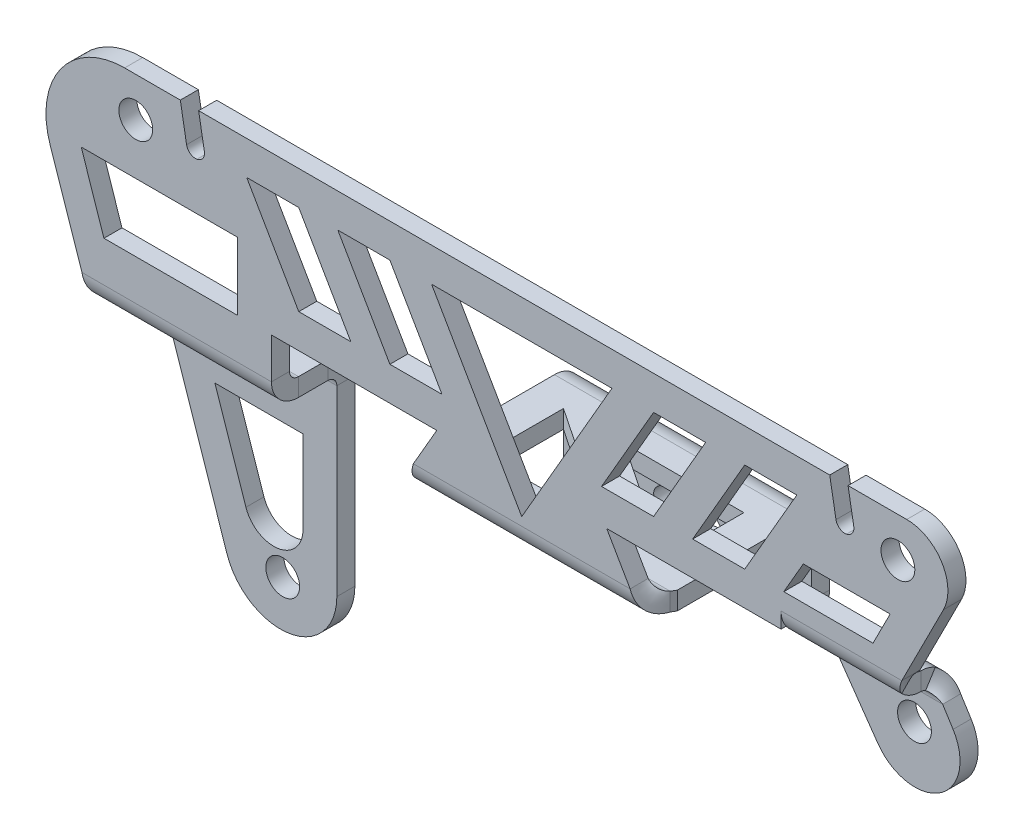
ISO-10303-21;
HEADER;
FILE_DESCRIPTION(('STEP AP214'),'2;1');
FILE_NAME('part.step','',(''),(''),'','','');
FILE_SCHEMA(('AUTOMOTIVE_DESIGN { 1 0 10303 214 1 1 1 1 }'));
ENDSEC;
DATA;
#1=APPLICATION_CONTEXT('core data for automotive mechanical design processes');
#2=APPLICATION_PROTOCOL_DEFINITION('international standard','automotive_design',2000,#1);
#3=PRODUCT_CONTEXT('',#1,'mechanical');
#4=PRODUCT('Part','Part','',(#3));
#5=PRODUCT_RELATED_PRODUCT_CATEGORY('part','',(#4));
#6=PRODUCT_DEFINITION_FORMATION('','',#4);
#7=PRODUCT_DEFINITION_CONTEXT('part definition',#1,'design');
#8=PRODUCT_DEFINITION('design','',#6,#7);
#9=PRODUCT_DEFINITION_SHAPE('','',#8);
#10=(LENGTH_UNIT() NAMED_UNIT(*) SI_UNIT(.MILLI.,.METRE.));
#11=(NAMED_UNIT(*) PLANE_ANGLE_UNIT() SI_UNIT($,.RADIAN.));
#12=(NAMED_UNIT(*) SI_UNIT($,.STERADIAN.) SOLID_ANGLE_UNIT());
#13=UNCERTAINTY_MEASURE_WITH_UNIT(LENGTH_MEASURE(1.E-05),#10,'distance_accuracy_value','');
#14=(GEOMETRIC_REPRESENTATION_CONTEXT(3) GLOBAL_UNCERTAINTY_ASSIGNED_CONTEXT((#13)) GLOBAL_UNIT_ASSIGNED_CONTEXT((#10,
#11,#12)) REPRESENTATION_CONTEXT('',''));
#15=CARTESIAN_POINT('',(0.,0.,0.));
#16=DIRECTION('',(0.,0.,1.));
#17=DIRECTION('',(1.,0.,0.));
#18=AXIS2_PLACEMENT_3D('',#15,#16,#17);
#19=CARTESIAN_POINT('',(32.9550112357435,-7.95,0.8));
#20=DIRECTION('',(0.,0.,1.));
#21=DIRECTION('',(1.,0.,0.));
#22=AXIS2_PLACEMENT_3D('',#19,#20,#21);
#23=PLANE('',#22);
#24=DIRECTION('',(-1.,0.,0.));
#25=VECTOR('',#24,1.);
#26=CARTESIAN_POINT('',(-1.40987915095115,-5.25,0.8));
#27=LINE('',#26,#25);
#28=CARTESIAN_POINT('',(4.51751712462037,-5.25,0.8));
#29=VERTEX_POINT('',#28);
#30=CARTESIAN_POINT('',(-1.40987915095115,-5.25,0.8));
#31=VERTEX_POINT('',#30);
#32=EDGE_CURVE('E662',#29,#31,#27,.T.);
#33=ORIENTED_EDGE('',*,*,#32,.T.);
#34=DIRECTION('',(-0.319111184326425,0.947717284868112,0.));
#35=VECTOR('',#34,1.);
#36=CARTESIAN_POINT('',(-2.42002591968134,-2.25,0.8));
#37=LINE('',#36,#35);
#38=CARTESIAN_POINT('',(-2.42002591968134,-2.25,0.8));
#39=VERTEX_POINT('',#38);
#40=EDGE_CURVE('E665',#31,#39,#37,.T.);
#41=ORIENTED_EDGE('',*,*,#40,.T.);
#42=DIRECTION('',(1.,0.,0.));
#43=VECTOR('',#42,1.);
#44=CARTESIAN_POINT('',(4.51751712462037,-2.25,0.8));
#45=LINE('',#44,#43);
#46=CARTESIAN_POINT('',(4.51751712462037,-2.25,0.8));
#47=VERTEX_POINT('',#46);
#48=EDGE_CURVE('E668',#39,#47,#45,.T.);
#49=ORIENTED_EDGE('',*,*,#48,.T.);
#50=DIRECTION('',(0.,-1.,0.));
#51=VECTOR('',#50,1.);
#52=CARTESIAN_POINT('',(4.51751712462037,-5.25,0.8));
#53=LINE('',#52,#51);
#54=EDGE_CURVE('E671',#47,#29,#53,.T.);
#55=ORIENTED_EDGE('',*,*,#54,.T.);
#56=EDGE_LOOP('',(#33,#41,#49,#55));
#57=FACE_BOUND('',#56,.T.);
#58=DIRECTION('',(-1.,0.,0.));
#59=VECTOR('',#58,1.);
#60=CARTESIAN_POINT('',(28.7385406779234,-3.75,0.8));
#61=LINE('',#60,#59);
#62=CARTESIAN_POINT('',(32.6958825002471,-3.75,0.8));
#63=VERTEX_POINT('',#62);
#64=CARTESIAN_POINT('',(28.7385406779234,-3.75,0.8));
#65=VERTEX_POINT('',#64);
#66=EDGE_CURVE('E677',#63,#65,#61,.T.);
#67=ORIENTED_EDGE('',*,*,#66,.T.);
#68=DIRECTION('',(0.500000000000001,0.866025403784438,0.));
#69=VECTOR('',#68,1.);
#70=CARTESIAN_POINT('',(29.6045660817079,-2.25,0.8));
#71=LINE('',#70,#69);
#72=CARTESIAN_POINT('',(29.6045660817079,-2.25,0.8));
#73=VERTEX_POINT('',#72);
#74=EDGE_CURVE('E685',#65,#73,#71,.T.);
#75=ORIENTED_EDGE('',*,*,#74,.T.);
#76=DIRECTION('',(1.,0.,0.));
#77=VECTOR('',#76,1.);
#78=CARTESIAN_POINT('',(33.4557224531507,-2.25,0.8));
#79=LINE('',#78,#77);
#80=CARTESIAN_POINT('',(33.4557224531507,-2.25,0.8));
#81=VERTEX_POINT('',#80);
#82=EDGE_CURVE('E688',#73,#81,#79,.T.);
#83=ORIENTED_EDGE('',*,*,#82,.T.);
#84=DIRECTION('',(-0.451889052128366,-0.892074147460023,0.));
#85=VECTOR('',#84,1.);
#86=CARTESIAN_POINT('',(32.6958825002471,-3.75,0.8));
#87=LINE('',#86,#85);
#88=EDGE_CURVE('E691',#81,#63,#87,.T.);
#89=ORIENTED_EDGE('',*,*,#88,.T.);
#90=EDGE_LOOP('',(#67,#75,#83,#89));
#91=FACE_BOUND('',#90,.T.);
#92=DIRECTION('',(-1.,0.,0.));
#93=VECTOR('',#92,1.);
#94=CARTESIAN_POINT('',(13.5793973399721,-3.75,0.8));
#95=LINE('',#94,#93);
#96=CARTESIAN_POINT('',(13.5793973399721,-3.75,0.8));
#97=VERTEX_POINT('',#96);
#98=CARTESIAN_POINT('',(11.2699962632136,-3.75,0.8));
#99=VERTEX_POINT('',#98);
#100=EDGE_CURVE('E697',#97,#99,#95,.T.);
#101=ORIENTED_EDGE('',*,*,#100,.T.);
#102=DIRECTION('',(-0.499999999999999,0.866025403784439,0.));
#103=VECTOR('',#102,1.);
#104=CARTESIAN_POINT('',(11.2699962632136,-3.75,0.8));
#105=LINE('',#104,#103);
#106=CARTESIAN_POINT('',(8.96059518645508,0.249999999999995,0.8));
#107=VERTEX_POINT('',#106);
#108=EDGE_CURVE('E705',#99,#107,#105,.T.);
#109=ORIENTED_EDGE('',*,*,#108,.T.);
#110=DIRECTION('',(1.,0.,0.));
#111=VECTOR('',#110,1.);
#112=CARTESIAN_POINT('',(11.2699962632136,0.249999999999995,0.8));
#113=LINE('',#112,#111);
#114=CARTESIAN_POINT('',(11.2699962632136,0.249999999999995,0.8));
#115=VERTEX_POINT('',#114);
#116=EDGE_CURVE('E708',#107,#115,#113,.T.);
#117=ORIENTED_EDGE('',*,*,#116,.T.);
#118=DIRECTION('',(0.5,-0.866025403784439,0.));
#119=VECTOR('',#118,1.);
#120=CARTESIAN_POINT('',(13.5793973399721,-3.75,0.8));
#121=LINE('',#120,#119);
#122=EDGE_CURVE('E711',#115,#97,#121,.T.);
#123=ORIENTED_EDGE('',*,*,#122,.T.);
#124=EDGE_LOOP('',(#101,#109,#117,#123));
#125=FACE_BOUND('',#124,.T.);
#126=DIRECTION('',(-1.,0.,0.));
#127=VECTOR('',#126,1.);
#128=CARTESIAN_POINT('',(24.6970887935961,-3.75,0.8));
#129=LINE('',#128,#127);
#130=CARTESIAN_POINT('',(27.0064898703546,-3.75,0.8));
#131=VERTEX_POINT('',#130);
#132=CARTESIAN_POINT('',(24.6970887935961,-3.75,0.8));
#133=VERTEX_POINT('',#132);
#134=EDGE_CURVE('E717',#131,#133,#129,.T.);
#135=ORIENTED_EDGE('',*,*,#134,.T.);
#136=DIRECTION('',(0.5,0.866025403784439,0.));
#137=VECTOR('',#136,1.);
#138=CARTESIAN_POINT('',(24.6970887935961,-3.75,0.8));
#139=LINE('',#138,#137);
#140=CARTESIAN_POINT('',(27.0064898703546,0.249999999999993,0.8));
#141=VERTEX_POINT('',#140);
#142=EDGE_CURVE('E725',#133,#141,#139,.T.);
#143=ORIENTED_EDGE('',*,*,#142,.T.);
#144=DIRECTION('',(1.,0.,0.));
#145=VECTOR('',#144,1.);
#146=CARTESIAN_POINT('',(27.0064898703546,0.249999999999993,0.8));
#147=LINE('',#146,#145);
#148=CARTESIAN_POINT('',(29.3158909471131,0.249999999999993,0.8));
#149=VERTEX_POINT('',#148);
#150=EDGE_CURVE('E728',#141,#149,#147,.T.);
#151=ORIENTED_EDGE('',*,*,#150,.T.);
#152=DIRECTION('',(-0.5,-0.866025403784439,0.));
#153=VECTOR('',#152,1.);
#154=CARTESIAN_POINT('',(27.0064898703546,-3.75,0.8));
#155=LINE('',#154,#153);
#156=EDGE_CURVE('E731',#149,#131,#155,.T.);
#157=ORIENTED_EDGE('',*,*,#156,.T.);
#158=EDGE_LOOP('',(#135,#143,#151,#157));
#159=FACE_BOUND('',#158,.T.);
#160=DIRECTION('',(-1.,0.,0.));
#161=VECTOR('',#160,1.);
#162=CARTESIAN_POINT('',(9.5379454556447,-3.75,0.8));
#163=LINE('',#162,#161);
#164=CARTESIAN_POINT('',(9.5379454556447,-3.75,0.8));
#165=VERTEX_POINT('',#164);
#166=CARTESIAN_POINT('',(7.22854437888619,-3.75,0.8));
#167=VERTEX_POINT('',#166);
#168=EDGE_CURVE('E737',#165,#167,#163,.T.);
#169=ORIENTED_EDGE('',*,*,#168,.T.);
#170=DIRECTION('',(-0.499999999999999,0.866025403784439,0.));
#171=VECTOR('',#170,1.);
#172=CARTESIAN_POINT('',(7.2285443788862,-3.75,0.8));
#173=LINE('',#172,#171);
#174=CARTESIAN_POINT('',(4.9191433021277,0.249999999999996,0.8));
#175=VERTEX_POINT('',#174);
#176=EDGE_CURVE('E745',#167,#175,#173,.T.);
#177=ORIENTED_EDGE('',*,*,#176,.T.);
#178=DIRECTION('',(1.,0.,0.));
#179=VECTOR('',#178,1.);
#180=CARTESIAN_POINT('',(7.2285443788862,0.249999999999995,0.8));
#181=LINE('',#180,#179);
#182=CARTESIAN_POINT('',(7.2285443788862,0.249999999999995,0.8));
#183=VERTEX_POINT('',#182);
#184=EDGE_CURVE('E748',#175,#183,#181,.T.);
#185=ORIENTED_EDGE('',*,*,#184,.T.);
#186=DIRECTION('',(0.5,-0.866025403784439,0.));
#187=VECTOR('',#186,1.);
#188=CARTESIAN_POINT('',(9.5379454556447,-3.75,0.8));
#189=LINE('',#188,#187);
#190=EDGE_CURVE('E751',#183,#165,#189,.T.);
#191=ORIENTED_EDGE('',*,*,#190,.T.);
#192=EDGE_LOOP('',(#169,#177,#185,#191));
#193=FACE_BOUND('',#192,.T.);
#194=DIRECTION('',(-1.,0.,0.));
#195=VECTOR('',#194,1.);
#196=CARTESIAN_POINT('',(20.6556369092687,-3.75,0.8));
#197=LINE('',#196,#195);
#198=CARTESIAN_POINT('',(22.9650379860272,-3.75,0.8));
#199=VERTEX_POINT('',#198);
#200=CARTESIAN_POINT('',(20.6556369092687,-3.75,0.8));
#201=VERTEX_POINT('',#200);
#202=EDGE_CURVE('E757',#199,#201,#197,.T.);
#203=ORIENTED_EDGE('',*,*,#202,.T.);
#204=DIRECTION('',(0.5,0.866025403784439,0.));
#205=VECTOR('',#204,1.);
#206=CARTESIAN_POINT('',(20.6556369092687,-3.75,0.8));
#207=LINE('',#206,#205);
#208=CARTESIAN_POINT('',(22.9650379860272,0.249999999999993,0.8));
#209=VERTEX_POINT('',#208);
#210=EDGE_CURVE('E765',#201,#209,#207,.T.);
#211=ORIENTED_EDGE('',*,*,#210,.T.);
#212=DIRECTION('',(1.,0.,0.));
#213=VECTOR('',#212,1.);
#214=CARTESIAN_POINT('',(22.9650379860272,0.249999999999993,0.8));
#215=LINE('',#214,#213);
#216=CARTESIAN_POINT('',(25.2744390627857,0.249999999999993,0.8));
#217=VERTEX_POINT('',#216);
#218=EDGE_CURVE('E768',#209,#217,#215,.T.);
#219=ORIENTED_EDGE('',*,*,#218,.T.);
#220=DIRECTION('',(-0.5,-0.866025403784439,0.));
#221=VECTOR('',#220,1.);
#222=CARTESIAN_POINT('',(22.9650379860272,-3.75,0.8));
#223=LINE('',#222,#221);
#224=EDGE_CURVE('E771',#217,#199,#223,.T.);
#225=ORIENTED_EDGE('',*,*,#224,.T.);
#226=EDGE_LOOP('',(#203,#211,#219,#225));
#227=FACE_BOUND('',#226,.T.);
#228=DIRECTION('',(-0.5,0.866025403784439,0.));
#229=VECTOR('',#228,1.);
#230=CARTESIAN_POINT('',(17.1175171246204,-6.67820323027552,0.8));
#231=LINE('',#230,#229);
#232=CARTESIAN_POINT('',(17.1175171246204,-6.67820323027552,0.8));
#233=VERTEX_POINT('',#232);
#234=CARTESIAN_POINT('',(13.1175171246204,0.249999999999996,0.8));
#235=VERTEX_POINT('',#234);
#236=EDGE_CURVE('E777',#233,#235,#231,.T.);
#237=ORIENTED_EDGE('',*,*,#236,.T.);
#238=DIRECTION('',(1.,0.,0.));
#239=VECTOR('',#238,1.);
#240=CARTESIAN_POINT('',(13.1175171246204,0.249999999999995,0.8));
#241=LINE('',#240,#239);
#242=CARTESIAN_POINT('',(21.1175171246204,0.249999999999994,0.8));
#243=VERTEX_POINT('',#242);
#244=EDGE_CURVE('E785',#235,#243,#241,.T.);
#245=ORIENTED_EDGE('',*,*,#244,.T.);
#246=DIRECTION('',(-0.5,-0.866025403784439,0.));
#247=VECTOR('',#246,1.);
#248=CARTESIAN_POINT('',(21.1175171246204,0.249999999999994,0.8));
#249=LINE('',#248,#247);
#250=EDGE_CURVE('E788',#243,#233,#249,.T.);
#251=ORIENTED_EDGE('',*,*,#250,.T.);
#252=EDGE_LOOP('',(#237,#245,#251));
#253=FACE_BOUND('',#252,.T.);
#254=CARTESIAN_POINT('',(33.8,0.,0.8));
#255=DIRECTION('',(0.,0.,-1.));
#256=DIRECTION('',(1.,0.,0.));
#257=AXIS2_PLACEMENT_3D('',#254,#255,#256);
#258=CIRCLE('',#257,0.749999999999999);
#259=CARTESIAN_POINT('',(34.55,0.,0.8));
#260=VERTEX_POINT('',#259);
#261=EDGE_CURVE('E1445',#260,#260,#258,.T.);
#262=ORIENTED_EDGE('',*,*,#261,.T.);
#263=EDGE_LOOP('',(#262));
#264=FACE_BOUND('',#263,.T.);
#265=CARTESIAN_POINT('',(0.,0.,0.8));
#266=DIRECTION('',(0.,0.,-1.));
#267=DIRECTION('',(1.,0.,0.));
#268=AXIS2_PLACEMENT_3D('',#265,#266,#267);
#269=CIRCLE('',#268,0.75);
#270=CARTESIAN_POINT('',(0.75,0.,0.8));
#271=VERTEX_POINT('',#270);
#272=EDGE_CURVE('E1448',#271,#271,#269,.T.);
#273=ORIENTED_EDGE('',*,*,#272,.T.);
#274=EDGE_LOOP('',(#273));
#275=FACE_BOUND('',#274,.T.);
#276=DIRECTION('',(-0.173648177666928,0.984807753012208,0.));
#277=VECTOR('',#276,1.);
#278=CARTESIAN_POINT('',(32.5006364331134,-8.03011853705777,0.8));
#279=LINE('',#278,#277);
#280=CARTESIAN_POINT('',(31.0539747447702,0.174307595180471,0.8));
#281=VERTEX_POINT('',#280);
#282=CARTESIAN_POINT('',(30.7761376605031,1.75,0.8));
#283=VERTEX_POINT('',#282);
#284=EDGE_CURVE('E798',#281,#283,#279,.T.);
#285=ORIENTED_EDGE('',*,*,#284,.T.);
#286=DIRECTION('',(1.,0.,0.));
#287=VECTOR('',#286,1.);
#288=CARTESIAN_POINT('',(-0.493795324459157,1.75,0.8));
#289=LINE('',#288,#287);
#290=CARTESIAN_POINT('',(2.78847895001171,1.75,0.8));
#291=VERTEX_POINT('',#290);
#292=EDGE_CURVE('E2091',#291,#283,#289,.T.);
#293=ORIENTED_EDGE('',*,*,#292,.F.);
#294=DIRECTION('',(0.173648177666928,-0.984807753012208,0.));
#295=VECTOR('',#294,1.);
#296=CARTESIAN_POINT('',(5.35690889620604,-12.8162900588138,0.8));
#297=LINE('',#296,#295);
#298=CARTESIAN_POINT('',(3.04182094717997,0.313226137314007,0.8));
#299=VERTEX_POINT('',#298);
#300=EDGE_CURVE('E818',#291,#299,#297,.T.);
#301=ORIENTED_EDGE('',*,*,#300,.T.);
#302=CARTESIAN_POINT('',(2.64789784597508,0.243766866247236,0.8));
#303=DIRECTION('',(0.,0.,-1.));
#304=DIRECTION('',(1.,0.,0.));
#305=AXIS2_PLACEMENT_3D('',#302,#303,#304);
#306=CIRCLE('',#305,0.4);
#307=CARTESIAN_POINT('',(2.71735711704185,-0.150156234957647,0.8));
#308=VERTEX_POINT('',#307);
#309=EDGE_CURVE('E974',#308,#299,#306,.F.);
#310=ORIENTED_EDGE('',*,*,#309,.F.);
#311=CARTESIAN_POINT('',(2.64789784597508,0.243766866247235,0.8));
#312=DIRECTION('',(0.,0.,-1.));
#313=DIRECTION('',(1.,0.,0.));
#314=AXIS2_PLACEMENT_3D('',#311,#312,#313);
#315=CIRCLE('',#314,0.4);
#316=CARTESIAN_POINT('',(2.2539747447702,0.174307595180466,0.8));
#317=VERTEX_POINT('',#316);
#318=EDGE_CURVE('E980',#317,#308,#315,.F.);
#319=ORIENTED_EDGE('',*,*,#318,.F.);
#320=DIRECTION('',(-0.173648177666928,0.984807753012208,0.));
#321=VECTOR('',#320,1.);
#322=CARTESIAN_POINT('',(4.56906269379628,-12.9552086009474,0.8));
#323=LINE('',#322,#321);
#324=CARTESIAN_POINT('',(1.97613766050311,1.75,0.8));
#325=VERTEX_POINT('',#324);
#326=EDGE_CURVE('E815',#317,#325,#323,.T.);
#327=ORIENTED_EDGE('',*,*,#326,.T.);
#328=CARTESIAN_POINT('',(-0.493795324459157,1.75,0.8));
#329=VERTEX_POINT('',#328);
#330=EDGE_CURVE('E2089',#329,#325,#289,.T.);
#331=ORIENTED_EDGE('',*,*,#330,.F.);
#332=CARTESIAN_POINT('',(-0.493795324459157,-1.73868755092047,0.8));
#333=DIRECTION('',(0.,0.,-1.));
#334=DIRECTION('',(1.,0.,0.));
#335=AXIS2_PLACEMENT_3D('',#332,#333,#334);
#336=CIRCLE('',#335,3.48868755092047);
#337=CARTESIAN_POINT('',(-3.80008481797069,-2.85196676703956,0.8));
#338=VERTEX_POINT('',#337);
#339=EDGE_CURVE('E2093',#338,#329,#336,.T.);
#340=ORIENTED_EDGE('',*,*,#339,.F.);
#341=DIRECTION('',(-0.319111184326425,0.947717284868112,0.));
#342=VECTOR('',#341,1.);
#343=CARTESIAN_POINT('',(1.14822391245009,-17.5477779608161,0.8));
#344=LINE('',#343,#342);
#345=CARTESIAN_POINT('',(-2.3865415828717,-7.05,0.8));
#346=VERTEX_POINT('',#345);
#347=EDGE_CURVE('E2095',#346,#338,#344,.T.);
#348=ORIENTED_EDGE('',*,*,#347,.F.);
#349=DIRECTION('',(-1.,0.,0.));
#350=VECTOR('',#349,1.);
#351=CARTESIAN_POINT('',(32.9550112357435,-7.05,0.8));
#352=LINE('',#351,#350);
#353=CARTESIAN_POINT('',(6.01751712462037,-7.05,0.8));
#354=VERTEX_POINT('',#353);
#355=EDGE_CURVE('E2038',#354,#346,#352,.T.);
#356=ORIENTED_EDGE('',*,*,#355,.F.);
#357=DIRECTION('',(0.,-1.,0.));
#358=VECTOR('',#357,1.);
#359=CARTESIAN_POINT('',(6.01751712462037,-16.75,0.8));
#360=LINE('',#359,#358);
#361=CARTESIAN_POINT('',(6.01751712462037,-5.25,0.8));
#362=VERTEX_POINT('',#361);
#363=EDGE_CURVE('E2036',#362,#354,#360,.T.);
#364=ORIENTED_EDGE('',*,*,#363,.F.);
#365=DIRECTION('',(-1.,0.,0.));
#366=VECTOR('',#365,1.);
#367=CARTESIAN_POINT('',(6.01751712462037,-5.25,0.8));
#368=LINE('',#367,#366);
#369=CARTESIAN_POINT('',(13.3495679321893,-5.25,0.8));
#370=VERTEX_POINT('',#369);
#371=EDGE_CURVE('E1418',#370,#362,#368,.T.);
#372=ORIENTED_EDGE('',*,*,#371,.F.);
#373=DIRECTION('',(-0.500000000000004,-0.866025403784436,0.));
#374=VECTOR('',#373,1.);
#375=CARTESIAN_POINT('',(17.0817944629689,1.2144059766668,0.8));
#376=LINE('',#375,#374);
#377=CARTESIAN_POINT('',(12.3103374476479,-7.05000000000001,0.8));
#378=VERTEX_POINT('',#377);
#379=EDGE_CURVE('E1398',#370,#378,#376,.T.);
#380=ORIENTED_EDGE('',*,*,#379,.T.);
#381=DIRECTION('',(-1.,0.,0.));
#382=VECTOR('',#381,1.);
#383=CARTESIAN_POINT('',(32.9550112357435,-7.05,0.8));
#384=LINE('',#383,#382);
#385=CARTESIAN_POINT('',(21.9246968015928,-7.05000000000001,0.8));
#386=VERTEX_POINT('',#385);
#387=EDGE_CURVE('E1371',#386,#378,#384,.T.);
#388=ORIENTED_EDGE('',*,*,#387,.F.);
#389=DIRECTION('',(-0.500000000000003,0.866025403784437,0.));
#390=VECTOR('',#389,1.);
#391=CARTESIAN_POINT('',(25.0719868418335,-12.5012662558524,0.8));
#392=LINE('',#391,#390);
#393=CARTESIAN_POINT('',(20.8854663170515,-5.25,0.8));
#394=VERTEX_POINT('',#393);
#395=EDGE_CURVE('E1401',#386,#394,#392,.T.);
#396=ORIENTED_EDGE('',*,*,#395,.T.);
#397=DIRECTION('',(1.,0.,0.));
#398=VECTOR('',#397,1.);
#399=CARTESIAN_POINT('',(32.9550112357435,-5.25,0.8));
#400=LINE('',#399,#398);
#401=CARTESIAN_POINT('',(28.6175171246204,-5.25,0.8));
#402=VERTEX_POINT('',#401);
#403=EDGE_CURVE('E1406',#394,#402,#400,.T.);
#404=ORIENTED_EDGE('',*,*,#403,.T.);
#405=DIRECTION('',(0.,-1.,0.));
#406=VECTOR('',#405,1.);
#407=CARTESIAN_POINT('',(28.6175171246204,-3.25,0.8));
#408=LINE('',#407,#406);
#409=CARTESIAN_POINT('',(28.6175171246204,-4.55,0.8));
#410=VERTEX_POINT('',#409);
#411=EDGE_CURVE('E1461',#410,#402,#408,.T.);
#412=ORIENTED_EDGE('',*,*,#411,.F.);
#413=DIRECTION('',(1.,0.,0.));
#414=VECTOR('',#413,1.);
#415=CARTESIAN_POINT('',(32.9550112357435,-4.55,0.8));
#416=LINE('',#415,#414);
#417=CARTESIAN_POINT('',(33.9721091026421,-4.55,0.8));
#418=VERTEX_POINT('',#417);
#419=EDGE_CURVE('E1451',#410,#418,#416,.T.);
#420=ORIENTED_EDGE('',*,*,#419,.T.);
#421=DIRECTION('',(-0.451889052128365,-0.892074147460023,0.));
#422=VECTOR('',#421,1.);
#423=CARTESIAN_POINT('',(35.8204400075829,-0.90121008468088,0.8));
#424=LINE('',#423,#422);
#425=CARTESIAN_POINT('',(35.8204400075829,-0.90121008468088,0.8));
#426=VERTEX_POINT('',#425);
#427=EDGE_CURVE('E1458',#426,#418,#424,.T.);
#428=ORIENTED_EDGE('',*,*,#427,.F.);
#429=CARTESIAN_POINT('',(34.1914753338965,-0.0760417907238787,0.8));
#430=DIRECTION('',(0.,0.,-1.));
#431=DIRECTION('',(-1.,0.,0.));
#432=AXIS2_PLACEMENT_3D('',#429,#430,#431);
#433=CIRCLE('',#432,1.82604179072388);
#434=CARTESIAN_POINT('',(34.1914753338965,1.75,0.8));
#435=VERTEX_POINT('',#434);
#436=EDGE_CURVE('E1462',#435,#426,#433,.T.);
#437=ORIENTED_EDGE('',*,*,#436,.F.);
#438=CARTESIAN_POINT('',(31.5884789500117,1.75,0.8));
#439=VERTEX_POINT('',#438);
#440=EDGE_CURVE('E2092',#439,#435,#289,.T.);
#441=ORIENTED_EDGE('',*,*,#440,.F.);
#442=DIRECTION('',(0.173648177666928,-0.984807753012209,0.));
#443=VECTOR('',#442,1.);
#444=CARTESIAN_POINT('',(33.2884826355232,-7.89119999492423,0.8));
#445=LINE('',#444,#443);
#446=CARTESIAN_POINT('',(31.84182094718,0.313226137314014,0.8));
#447=VERTEX_POINT('',#446);
#448=EDGE_CURVE('E801',#439,#447,#445,.T.);
#449=ORIENTED_EDGE('',*,*,#448,.T.);
#450=CARTESIAN_POINT('',(31.4478978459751,0.243766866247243,0.8));
#451=DIRECTION('',(0.,0.,-1.));
#452=DIRECTION('',(1.,0.,0.));
#453=AXIS2_PLACEMENT_3D('',#450,#451,#452);
#454=CIRCLE('',#453,0.4);
#455=CARTESIAN_POINT('',(31.5173571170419,-0.15015623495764,0.8));
#456=VERTEX_POINT('',#455);
#457=EDGE_CURVE('E991',#456,#447,#454,.F.);
#458=ORIENTED_EDGE('',*,*,#457,.F.);
#459=CARTESIAN_POINT('',(31.4478978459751,0.243766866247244,0.8));
#460=DIRECTION('',(0.,0.,-1.));
#461=DIRECTION('',(1.,0.,0.));
#462=AXIS2_PLACEMENT_3D('',#459,#460,#461);
#463=CIRCLE('',#462,0.4);
#464=EDGE_CURVE('E997',#281,#456,#463,.F.);
#465=ORIENTED_EDGE('',*,*,#464,.F.);
#466=EDGE_LOOP('',(#285,#293,#301,#310,#319,#327,#331,#340,#348,#356,#364,#372,#380,#388,#396,
#404,#412,#420,#428,#437,#441,#449,#458,#465));
#467=FACE_BOUND('',#466,.T.);
#468=ADVANCED_FACE('F34',(#57,#91,#125,#159,#193,#227,#253,#264,#275,#467),#23,.T.);
#469=CARTESIAN_POINT('',(32.9550112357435,-7.95,0.));
#470=DIRECTION('',(0.,0.,1.));
#471=DIRECTION('',(1.,0.,0.));
#472=AXIS2_PLACEMENT_3D('',#469,#470,#471);
#473=PLANE('',#472);
#474=DIRECTION('',(0.,-1.,0.));
#475=VECTOR('',#474,1.);
#476=CARTESIAN_POINT('',(4.51751712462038,-7.95,0.));
#477=LINE('',#476,#475);
#478=CARTESIAN_POINT('',(4.51751712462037,-2.25,0.));
#479=VERTEX_POINT('',#478);
#480=CARTESIAN_POINT('',(4.51751712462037,-5.25,0.));
#481=VERTEX_POINT('',#480);
#482=EDGE_CURVE('E1079',#479,#481,#477,.T.);
#483=ORIENTED_EDGE('',*,*,#482,.F.);
#484=DIRECTION('',(1.,0.,0.));
#485=VECTOR('',#484,1.);
#486=CARTESIAN_POINT('',(32.9550112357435,-2.25,0.));
#487=LINE('',#486,#485);
#488=CARTESIAN_POINT('',(-2.42002591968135,-2.25,0.));
#489=VERTEX_POINT('',#488);
#490=EDGE_CURVE('E1076',#489,#479,#487,.T.);
#491=ORIENTED_EDGE('',*,*,#490,.F.);
#492=DIRECTION('',(-0.319111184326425,0.947717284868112,0.));
#493=VECTOR('',#492,1.);
#494=CARTESIAN_POINT('',(2.90611797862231,-18.0679308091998,0.));
#495=LINE('',#494,#493);
#496=CARTESIAN_POINT('',(-1.40987915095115,-5.25,0.));
#497=VERTEX_POINT('',#496);
#498=EDGE_CURVE('E1073',#497,#489,#495,.T.);
#499=ORIENTED_EDGE('',*,*,#498,.F.);
#500=DIRECTION('',(-1.,0.,0.));
#501=VECTOR('',#500,1.);
#502=CARTESIAN_POINT('',(32.9550112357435,-5.25,0.));
#503=LINE('',#502,#501);
#504=EDGE_CURVE('E1082',#481,#497,#503,.T.);
#505=ORIENTED_EDGE('',*,*,#504,.F.);
#506=EDGE_LOOP('',(#483,#491,#499,#505));
#507=FACE_BOUND('',#506,.T.);
#508=DIRECTION('',(-0.451889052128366,-0.892074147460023,0.));
#509=VECTOR('',#508,1.);
#510=CARTESIAN_POINT('',(31.0556996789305,-6.98788479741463,0.));
#511=LINE('',#510,#509);
#512=CARTESIAN_POINT('',(33.4557224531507,-2.25,0.));
#513=VERTEX_POINT('',#512);
#514=CARTESIAN_POINT('',(32.6958825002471,-3.75,0.));
#515=VERTEX_POINT('',#514);
#516=EDGE_CURVE('E1067',#513,#515,#511,.T.);
#517=ORIENTED_EDGE('',*,*,#516,.F.);
#518=DIRECTION('',(1.,0.,0.));
#519=VECTOR('',#518,1.);
#520=CARTESIAN_POINT('',(32.9550112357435,-2.25,0.));
#521=LINE('',#520,#519);
#522=CARTESIAN_POINT('',(29.6045660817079,-2.25,0.));
#523=VERTEX_POINT('',#522);
#524=EDGE_CURVE('E1064',#523,#513,#521,.T.);
#525=ORIENTED_EDGE('',*,*,#524,.F.);
#526=DIRECTION('',(0.500000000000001,0.866025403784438,0.));
#527=VECTOR('',#526,1.);
#528=CARTESIAN_POINT('',(27.9740049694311,-5.07421469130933,0.));
#529=LINE('',#528,#527);
#530=CARTESIAN_POINT('',(28.7385406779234,-3.75,0.));
#531=VERTEX_POINT('',#530);
#532=EDGE_CURVE('E1061',#531,#523,#529,.T.);
#533=ORIENTED_EDGE('',*,*,#532,.F.);
#534=DIRECTION('',(-1.,0.,0.));
#535=VECTOR('',#534,1.);
#536=CARTESIAN_POINT('',(32.9550112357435,-3.75,0.));
#537=LINE('',#536,#535);
#538=EDGE_CURVE('E1070',#515,#531,#537,.T.);
#539=ORIENTED_EDGE('',*,*,#538,.F.);
#540=EDGE_LOOP('',(#517,#525,#533,#539));
#541=FACE_BOUND('',#540,.T.);
#542=DIRECTION('',(0.5,-0.866025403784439,0.));
#543=VECTOR('',#542,1.);
#544=CARTESIAN_POINT('',(20.2419541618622,-15.2898869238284,0.));
#545=LINE('',#544,#543);
#546=CARTESIAN_POINT('',(11.2699962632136,0.249999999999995,0.));
#547=VERTEX_POINT('',#546);
#548=CARTESIAN_POINT('',(13.5793973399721,-3.75,0.));
#549=VERTEX_POINT('',#548);
#550=EDGE_CURVE('E1055',#547,#549,#545,.T.);
#551=ORIENTED_EDGE('',*,*,#550,.F.);
#552=DIRECTION('',(1.,0.,0.));
#553=VECTOR('',#552,1.);
#554=CARTESIAN_POINT('',(32.9550112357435,0.249999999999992,0.));
#555=LINE('',#554,#553);
#556=CARTESIAN_POINT('',(8.96059518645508,0.249999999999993,0.));
#557=VERTEX_POINT('',#556);
#558=EDGE_CURVE('E1052',#557,#547,#555,.T.);
#559=ORIENTED_EDGE('',*,*,#558,.F.);
#560=DIRECTION('',(-0.499999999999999,0.866025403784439,0.));
#561=VECTOR('',#560,1.);
#562=CARTESIAN_POINT('',(18.5099033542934,-16.2898869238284,0.));
#563=LINE('',#562,#561);
#564=CARTESIAN_POINT('',(11.2699962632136,-3.75,0.));
#565=VERTEX_POINT('',#564);
#566=EDGE_CURVE('E1049',#565,#557,#563,.T.);
#567=ORIENTED_EDGE('',*,*,#566,.F.);
#568=DIRECTION('',(-1.,0.,0.));
#569=VECTOR('',#568,1.);
#570=CARTESIAN_POINT('',(32.9550112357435,-3.75,0.));
#571=LINE('',#570,#569);
#572=EDGE_CURVE('E1058',#549,#565,#571,.T.);
#573=ORIENTED_EDGE('',*,*,#572,.F.);
#574=EDGE_LOOP('',(#551,#559,#567,#573));
#575=FACE_BOUND('',#574,.T.);
#576=DIRECTION('',(-0.499999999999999,-0.866025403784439,0.));
#577=VECTOR('',#576,1.);
#578=CARTESIAN_POINT('',(26.6749668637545,-4.32421469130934,0.));
#579=LINE('',#578,#577);
#580=CARTESIAN_POINT('',(29.3158909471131,0.249999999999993,0.));
#581=VERTEX_POINT('',#580);
#582=CARTESIAN_POINT('',(27.0064898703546,-3.75,0.));
#583=VERTEX_POINT('',#582);
#584=EDGE_CURVE('E1043',#581,#583,#579,.T.);
#585=ORIENTED_EDGE('',*,*,#584,.F.);
#586=DIRECTION('',(1.,0.,0.));
#587=VECTOR('',#586,1.);
#588=CARTESIAN_POINT('',(32.9550112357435,0.249999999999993,0.));
#589=LINE('',#588,#587);
#590=CARTESIAN_POINT('',(27.0064898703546,0.249999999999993,0.));
#591=VERTEX_POINT('',#590);
#592=EDGE_CURVE('E1040',#591,#581,#589,.T.);
#593=ORIENTED_EDGE('',*,*,#592,.F.);
#594=DIRECTION('',(0.5,0.866025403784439,0.));
#595=VECTOR('',#594,1.);
#596=CARTESIAN_POINT('',(24.9429160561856,-3.32421469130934,0.));
#597=LINE('',#596,#595);
#598=CARTESIAN_POINT('',(24.6970887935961,-3.75,0.));
#599=VERTEX_POINT('',#598);
#600=EDGE_CURVE('E1037',#599,#591,#597,.T.);
#601=ORIENTED_EDGE('',*,*,#600,.F.);
#602=DIRECTION('',(-1.,0.,0.));
#603=VECTOR('',#602,1.);
#604=CARTESIAN_POINT('',(32.9550112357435,-3.75000000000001,0.));
#605=LINE('',#604,#603);
#606=EDGE_CURVE('E1046',#583,#599,#605,.T.);
#607=ORIENTED_EDGE('',*,*,#606,.F.);
#608=EDGE_LOOP('',(#585,#593,#601,#607));
#609=FACE_BOUND('',#608,.T.);
#610=DIRECTION('',(0.5,-0.866025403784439,0.));
#611=VECTOR('',#610,1.);
#612=CARTESIAN_POINT('',(17.2108652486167,-17.0398869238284,0.));
#613=LINE('',#612,#611);
#614=CARTESIAN_POINT('',(7.2285443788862,0.249999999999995,0.));
#615=VERTEX_POINT('',#614);
#616=CARTESIAN_POINT('',(9.5379454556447,-3.75,0.));
#617=VERTEX_POINT('',#616);
#618=EDGE_CURVE('E1031',#615,#617,#613,.T.);
#619=ORIENTED_EDGE('',*,*,#618,.F.);
#620=DIRECTION('',(1.,0.,0.));
#621=VECTOR('',#620,1.);
#622=CARTESIAN_POINT('',(32.9550112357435,0.249999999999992,0.));
#623=LINE('',#622,#621);
#624=CARTESIAN_POINT('',(4.9191433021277,0.249999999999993,0.));
#625=VERTEX_POINT('',#624);
#626=EDGE_CURVE('E1028',#625,#615,#623,.T.);
#627=ORIENTED_EDGE('',*,*,#626,.F.);
#628=DIRECTION('',(-0.499999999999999,0.866025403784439,0.));
#629=VECTOR('',#628,1.);
#630=CARTESIAN_POINT('',(15.4788144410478,-18.0398869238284,0.));
#631=LINE('',#630,#629);
#632=CARTESIAN_POINT('',(7.2285443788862,-3.75,0.));
#633=VERTEX_POINT('',#632);
#634=EDGE_CURVE('E1025',#633,#625,#631,.T.);
#635=ORIENTED_EDGE('',*,*,#634,.F.);
#636=DIRECTION('',(-1.,0.,0.));
#637=VECTOR('',#636,1.);
#638=CARTESIAN_POINT('',(32.9550112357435,-3.75,0.));
#639=LINE('',#638,#637);
#640=EDGE_CURVE('E1034',#617,#633,#639,.T.);
#641=ORIENTED_EDGE('',*,*,#640,.F.);
#642=EDGE_LOOP('',(#619,#627,#635,#641));
#643=FACE_BOUND('',#642,.T.);
#644=DIRECTION('',(-0.499999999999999,-0.866025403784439,0.));
#645=VECTOR('',#644,1.);
#646=CARTESIAN_POINT('',(23.6438779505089,-2.57421469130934,0.));
#647=LINE('',#646,#645);
#648=CARTESIAN_POINT('',(25.2744390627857,0.249999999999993,0.));
#649=VERTEX_POINT('',#648);
#650=CARTESIAN_POINT('',(22.9650379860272,-3.75,0.));
#651=VERTEX_POINT('',#650);
#652=EDGE_CURVE('E1019',#649,#651,#647,.T.);
#653=ORIENTED_EDGE('',*,*,#652,.F.);
#654=DIRECTION('',(1.,0.,0.));
#655=VECTOR('',#654,1.);
#656=CARTESIAN_POINT('',(32.9550112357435,0.249999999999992,0.));
#657=LINE('',#656,#655);
#658=CARTESIAN_POINT('',(22.9650379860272,0.249999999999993,0.));
#659=VERTEX_POINT('',#658);
#660=EDGE_CURVE('E1016',#659,#649,#657,.T.);
#661=ORIENTED_EDGE('',*,*,#660,.F.);
#662=DIRECTION('',(0.5,0.866025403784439,0.));
#663=VECTOR('',#662,1.);
#664=CARTESIAN_POINT('',(21.9118271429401,-1.57421469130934,0.));
#665=LINE('',#664,#663);
#666=CARTESIAN_POINT('',(20.6556369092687,-3.75,0.));
#667=VERTEX_POINT('',#666);
#668=EDGE_CURVE('E1013',#667,#659,#665,.T.);
#669=ORIENTED_EDGE('',*,*,#668,.F.);
#670=DIRECTION('',(-1.,0.,0.));
#671=VECTOR('',#670,1.);
#672=CARTESIAN_POINT('',(32.9550112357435,-3.75000000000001,0.));
#673=LINE('',#672,#671);
#674=EDGE_CURVE('E1022',#651,#667,#673,.T.);
#675=ORIENTED_EDGE('',*,*,#674,.F.);
#676=EDGE_LOOP('',(#653,#661,#669,#675));
#677=FACE_BOUND('',#676,.T.);
#678=DIRECTION('',(-0.5,-0.866025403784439,0.));
#679=VECTOR('',#678,1.);
#680=CARTESIAN_POINT('',(20.526186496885,-0.77421469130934,0.));
#681=LINE('',#680,#679);
#682=CARTESIAN_POINT('',(21.1175171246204,0.249999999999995,0.));
#683=VERTEX_POINT('',#682);
#684=CARTESIAN_POINT('',(17.1175171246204,-6.67820323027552,0.));
#685=VERTEX_POINT('',#684);
#686=EDGE_CURVE('E1007',#683,#685,#681,.T.);
#687=ORIENTED_EDGE('',*,*,#686,.F.);
#688=DIRECTION('',(1.,0.,0.));
#689=VECTOR('',#688,1.);
#690=CARTESIAN_POINT('',(32.9550112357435,0.249999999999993,0.));
#691=LINE('',#690,#689);
#692=CARTESIAN_POINT('',(13.1175171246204,0.249999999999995,0.));
#693=VERTEX_POINT('',#692);
#694=EDGE_CURVE('E1003',#693,#683,#691,.T.);
#695=ORIENTED_EDGE('',*,*,#694,.F.);
#696=DIRECTION('',(-0.5,0.866025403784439,0.));
#697=VECTOR('',#696,1.);
#698=CARTESIAN_POINT('',(21.6275948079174,-14.4898869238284,0.));
#699=LINE('',#698,#697);
#700=EDGE_CURVE('E1010',#685,#693,#699,.T.);
#701=ORIENTED_EDGE('',*,*,#700,.F.);
#702=EDGE_LOOP('',(#687,#695,#701));
#703=FACE_BOUND('',#702,.T.);
#704=CARTESIAN_POINT('',(0.,0.,0.));
#705=DIRECTION('',(0.,0.,-1.));
#706=DIRECTION('',(1.,0.,0.));
#707=AXIS2_PLACEMENT_3D('',#704,#705,#706);
#708=CIRCLE('',#707,0.75);
#709=CARTESIAN_POINT('',(0.75,0.,0.));
#710=VERTEX_POINT('',#709);
#711=EDGE_CURVE('E2084',#710,#710,#708,.T.);
#712=ORIENTED_EDGE('',*,*,#711,.F.);
#713=EDGE_LOOP('',(#712));
#714=FACE_BOUND('',#713,.T.);
#715=CARTESIAN_POINT('',(33.8,0.,0.));
#716=DIRECTION('',(0.,0.,-1.));
#717=DIRECTION('',(1.,0.,0.));
#718=AXIS2_PLACEMENT_3D('',#715,#716,#717);
#719=CIRCLE('',#718,0.749999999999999);
#720=CARTESIAN_POINT('',(34.55,0.,0.));
#721=VERTEX_POINT('',#720);
#722=EDGE_CURVE('E1161',#721,#721,#719,.T.);
#723=ORIENTED_EDGE('',*,*,#722,.F.);
#724=EDGE_LOOP('',(#723));
#725=FACE_BOUND('',#724,.T.);
#726=DIRECTION('',(0.173648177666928,-0.984807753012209,0.));
#727=VECTOR('',#726,1.);
#728=CARTESIAN_POINT('',(33.2884826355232,-7.89119999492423,0.));
#729=LINE('',#728,#727);
#730=CARTESIAN_POINT('',(31.5884789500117,1.75,0.));
#731=VERTEX_POINT('',#730);
#732=CARTESIAN_POINT('',(31.84182094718,0.313226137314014,0.));
#733=VERTEX_POINT('',#732);
#734=EDGE_CURVE('E802',#731,#733,#729,.T.);
#735=ORIENTED_EDGE('',*,*,#734,.F.);
#736=DIRECTION('',(1.,0.,0.));
#737=VECTOR('',#736,1.);
#738=CARTESIAN_POINT('',(-0.493795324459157,1.75,0.));
#739=LINE('',#738,#737);
#740=CARTESIAN_POINT('',(34.1914753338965,1.75,0.));
#741=VERTEX_POINT('',#740);
#742=EDGE_CURVE('E1439',#731,#741,#739,.T.);
#743=ORIENTED_EDGE('',*,*,#742,.T.);
#744=CARTESIAN_POINT('',(34.1914753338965,-0.0760417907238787,0.));
#745=DIRECTION('',(0.,0.,-1.));
#746=DIRECTION('',(-1.,0.,0.));
#747=AXIS2_PLACEMENT_3D('',#744,#745,#746);
#748=CIRCLE('',#747,1.82604179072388);
#749=CARTESIAN_POINT('',(35.8204400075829,-0.90121008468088,0.));
#750=VERTEX_POINT('',#749);
#751=EDGE_CURVE('E1442',#741,#750,#748,.T.);
#752=ORIENTED_EDGE('',*,*,#751,.T.);
#753=DIRECTION('',(-0.451889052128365,-0.892074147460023,0.));
#754=VECTOR('',#753,1.);
#755=CARTESIAN_POINT('',(35.8204400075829,-0.90121008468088,0.));
#756=LINE('',#755,#754);
#757=CARTESIAN_POINT('',(33.9721091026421,-4.55,0.));
#758=VERTEX_POINT('',#757);
#759=EDGE_CURVE('E1415',#750,#758,#756,.T.);
#760=ORIENTED_EDGE('',*,*,#759,.T.);
#761=DIRECTION('',(1.,0.,0.));
#762=VECTOR('',#761,1.);
#763=CARTESIAN_POINT('',(32.9550112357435,-4.55,0.));
#764=LINE('',#763,#762);
#765=CARTESIAN_POINT('',(28.6175172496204,-4.55,0.));
#766=VERTEX_POINT('',#765);
#767=EDGE_CURVE('E1381',#766,#758,#764,.T.);
#768=ORIENTED_EDGE('',*,*,#767,.F.);
#769=DIRECTION('',(0.,1.,0.));
#770=VECTOR('',#769,1.);
#771=CARTESIAN_POINT('',(28.6175171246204,-3.25,0.));
#772=LINE('',#771,#770);
#773=CARTESIAN_POINT('',(28.6175171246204,-5.25,0.));
#774=VERTEX_POINT('',#773);
#775=EDGE_CURVE('E2078',#774,#766,#772,.T.);
#776=ORIENTED_EDGE('',*,*,#775,.F.);
#777=DIRECTION('',(1.,0.,0.));
#778=VECTOR('',#777,1.);
#779=CARTESIAN_POINT('',(32.9550112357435,-5.25,0.));
#780=LINE('',#779,#778);
#781=CARTESIAN_POINT('',(20.8854663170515,-5.25,0.));
#782=VERTEX_POINT('',#781);
#783=EDGE_CURVE('E1160',#782,#774,#780,.T.);
#784=ORIENTED_EDGE('',*,*,#783,.F.);
#785=DIRECTION('',(-0.500000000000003,0.866025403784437,0.));
#786=VECTOR('',#785,1.);
#787=CARTESIAN_POINT('',(25.0719868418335,-12.5012662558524,0.));
#788=LINE('',#787,#786);
#789=CARTESIAN_POINT('',(21.9246968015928,-7.05000000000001,0.));
#790=VERTEX_POINT('',#789);
#791=EDGE_CURVE('E1152',#790,#782,#788,.T.);
#792=ORIENTED_EDGE('',*,*,#791,.F.);
#793=DIRECTION('',(-1.,0.,0.));
#794=VECTOR('',#793,1.);
#795=CARTESIAN_POINT('',(32.9550112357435,-7.05000000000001,0.));
#796=LINE('',#795,#794);
#797=CARTESIAN_POINT('',(12.3103374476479,-7.05000000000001,0.));
#798=VERTEX_POINT('',#797);
#799=EDGE_CURVE('E1373',#790,#798,#796,.T.);
#800=ORIENTED_EDGE('',*,*,#799,.T.);
#801=DIRECTION('',(-0.500000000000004,-0.866025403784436,0.));
#802=VECTOR('',#801,1.);
#803=CARTESIAN_POINT('',(17.0817944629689,1.2144059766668,0.));
#804=LINE('',#803,#802);
#805=CARTESIAN_POINT('',(13.3495679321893,-5.25,0.));
#806=VERTEX_POINT('',#805);
#807=EDGE_CURVE('E1378',#806,#798,#804,.T.);
#808=ORIENTED_EDGE('',*,*,#807,.F.);
#809=DIRECTION('',(-1.,0.,0.));
#810=VECTOR('',#809,1.);
#811=CARTESIAN_POINT('',(6.01751712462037,-5.25,0.));
#812=LINE('',#811,#810);
#813=CARTESIAN_POINT('',(6.01751712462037,-5.25,0.));
#814=VERTEX_POINT('',#813);
#815=EDGE_CURVE('E1422',#806,#814,#812,.T.);
#816=ORIENTED_EDGE('',*,*,#815,.T.);
#817=DIRECTION('',(0.,-1.,0.));
#818=VECTOR('',#817,1.);
#819=CARTESIAN_POINT('',(6.01751712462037,-16.75,0.));
#820=LINE('',#819,#818);
#821=CARTESIAN_POINT('',(6.01751712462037,-7.05000000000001,0.));
#822=VERTEX_POINT('',#821);
#823=EDGE_CURVE('E1428',#814,#822,#820,.T.);
#824=ORIENTED_EDGE('',*,*,#823,.T.);
#825=DIRECTION('',(-1.,0.,0.));
#826=VECTOR('',#825,1.);
#827=CARTESIAN_POINT('',(32.9550112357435,-7.05000000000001,0.));
#828=LINE('',#827,#826);
#829=CARTESIAN_POINT('',(-2.3865415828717,-7.05000000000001,0.));
#830=VERTEX_POINT('',#829);
#831=EDGE_CURVE('E1565',#822,#830,#828,.T.);
#832=ORIENTED_EDGE('',*,*,#831,.T.);
#833=DIRECTION('',(-0.319111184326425,0.947717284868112,0.));
#834=VECTOR('',#833,1.);
#835=CARTESIAN_POINT('',(1.14822391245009,-17.5477779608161,0.));
#836=LINE('',#835,#834);
#837=CARTESIAN_POINT('',(-3.80008481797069,-2.85196676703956,0.));
#838=VERTEX_POINT('',#837);
#839=EDGE_CURVE('E1380',#830,#838,#836,.T.);
#840=ORIENTED_EDGE('',*,*,#839,.T.);
#841=CARTESIAN_POINT('',(-0.493795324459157,-1.73868755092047,0.));
#842=DIRECTION('',(0.,0.,-1.));
#843=DIRECTION('',(1.,0.,0.));
#844=AXIS2_PLACEMENT_3D('',#841,#842,#843);
#845=CIRCLE('',#844,3.48868755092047);
#846=CARTESIAN_POINT('',(-0.493795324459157,1.75,0.));
#847=VERTEX_POINT('',#846);
#848=EDGE_CURVE('E1430',#838,#847,#845,.T.);
#849=ORIENTED_EDGE('',*,*,#848,.T.);
#850=CARTESIAN_POINT('',(1.97613766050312,1.75,0.));
#851=VERTEX_POINT('',#850);
#852=EDGE_CURVE('E1435',#847,#851,#739,.T.);
#853=ORIENTED_EDGE('',*,*,#852,.T.);
#854=DIRECTION('',(-0.173648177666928,0.984807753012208,0.));
#855=VECTOR('',#854,1.);
#856=CARTESIAN_POINT('',(4.56906269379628,-12.9552086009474,0.));
#857=LINE('',#856,#855);
#858=CARTESIAN_POINT('',(2.2539747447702,0.174307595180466,0.));
#859=VERTEX_POINT('',#858);
#860=EDGE_CURVE('E823',#859,#851,#857,.T.);
#861=ORIENTED_EDGE('',*,*,#860,.F.);
#862=CARTESIAN_POINT('',(2.64789784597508,0.243766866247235,0.));
#863=DIRECTION('',(0.,0.,-1.));
#864=DIRECTION('',(1.,0.,0.));
#865=AXIS2_PLACEMENT_3D('',#862,#863,#864);
#866=CIRCLE('',#865,0.4);
#867=CARTESIAN_POINT('',(2.71735711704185,-0.150156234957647,0.));
#868=VERTEX_POINT('',#867);
#869=EDGE_CURVE('E983',#868,#859,#866,.T.);
#870=ORIENTED_EDGE('',*,*,#869,.F.);
#871=CARTESIAN_POINT('',(2.64789784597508,0.243766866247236,0.));
#872=DIRECTION('',(0.,0.,-1.));
#873=DIRECTION('',(1.,0.,0.));
#874=AXIS2_PLACEMENT_3D('',#871,#872,#873);
#875=CIRCLE('',#874,0.4);
#876=CARTESIAN_POINT('',(3.04182094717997,0.313226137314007,0.));
#877=VERTEX_POINT('',#876);
#878=EDGE_CURVE('E977',#877,#868,#875,.T.);
#879=ORIENTED_EDGE('',*,*,#878,.F.);
#880=DIRECTION('',(0.173648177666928,-0.984807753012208,0.));
#881=VECTOR('',#880,1.);
#882=CARTESIAN_POINT('',(5.35690889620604,-12.8162900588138,0.));
#883=LINE('',#882,#881);
#884=CARTESIAN_POINT('',(2.78847895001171,1.75,0.));
#885=VERTEX_POINT('',#884);
#886=EDGE_CURVE('E819',#885,#877,#883,.T.);
#887=ORIENTED_EDGE('',*,*,#886,.F.);
#888=CARTESIAN_POINT('',(30.7761376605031,1.75,0.));
#889=VERTEX_POINT('',#888);
#890=EDGE_CURVE('E1438',#885,#889,#739,.T.);
#891=ORIENTED_EDGE('',*,*,#890,.T.);
#892=DIRECTION('',(-0.173648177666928,0.984807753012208,0.));
#893=VECTOR('',#892,1.);
#894=CARTESIAN_POINT('',(32.5006364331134,-8.03011853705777,0.));
#895=LINE('',#894,#893);
#896=CARTESIAN_POINT('',(31.0539747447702,0.174307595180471,0.));
#897=VERTEX_POINT('',#896);
#898=EDGE_CURVE('E806',#897,#889,#895,.T.);
#899=ORIENTED_EDGE('',*,*,#898,.F.);
#900=CARTESIAN_POINT('',(31.4478978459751,0.243766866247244,0.));
#901=DIRECTION('',(0.,0.,-1.));
#902=DIRECTION('',(1.,0.,0.));
#903=AXIS2_PLACEMENT_3D('',#900,#901,#902);
#904=CIRCLE('',#903,0.4);
#905=CARTESIAN_POINT('',(31.5173571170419,-0.15015623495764,0.));
#906=VERTEX_POINT('',#905);
#907=EDGE_CURVE('E1000',#906,#897,#904,.T.);
#908=ORIENTED_EDGE('',*,*,#907,.F.);
#909=CARTESIAN_POINT('',(31.4478978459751,0.243766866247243,0.));
#910=DIRECTION('',(0.,0.,-1.));
#911=DIRECTION('',(1.,0.,0.));
#912=AXIS2_PLACEMENT_3D('',#909,#910,#911);
#913=CIRCLE('',#912,0.4);
#914=EDGE_CURVE('E994',#733,#906,#913,.T.);
#915=ORIENTED_EDGE('',*,*,#914,.F.);
#916=EDGE_LOOP('',(#735,#743,#752,#760,#768,#776,#784,#792,#800,#808,#816,#824,#832,#840,#849,
#853,#861,#870,#879,#887,#891,#899,#908,#915));
#917=FACE_BOUND('',#916,.T.);
#918=ADVANCED_FACE('F1124',(#507,#541,#575,#609,#643,#677,#703,#714,#725,#917),#473,.F.);
#919=CARTESIAN_POINT('',(-0.493795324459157,1.75,0.8));
#920=DIRECTION('',(0.,-1.,0.));
#921=DIRECTION('',(-1.,0.,0.));
#922=AXIS2_PLACEMENT_3D('',#919,#920,#921);
#923=PLANE('',#922);
#924=DIRECTION('',(0.,0.,-1.));
#925=VECTOR('',#924,1.);
#926=CARTESIAN_POINT('',(31.5884789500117,1.75,0.));
#927=LINE('',#926,#925);
#928=EDGE_CURVE('E812',#731,#439,#927,.F.);
#929=ORIENTED_EDGE('',*,*,#928,.T.);
#930=ORIENTED_EDGE('',*,*,#440,.T.);
#931=DIRECTION('',(0.,0.,-1.));
#932=VECTOR('',#931,1.);
#933=CARTESIAN_POINT('',(34.1914753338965,1.75,0.8));
#934=LINE('',#933,#932);
#935=EDGE_CURVE('E1440',#435,#741,#934,.T.);
#936=ORIENTED_EDGE('',*,*,#935,.T.);
#937=ORIENTED_EDGE('',*,*,#742,.F.);
#938=EDGE_LOOP('',(#929,#930,#936,#937));
#939=FACE_BOUND('',#938,.T.);
#940=ADVANCED_FACE('F1130',(#939),#923,.F.);
#941=DIRECTION('',(0.,0.,-1.));
#942=VECTOR('',#941,1.);
#943=CARTESIAN_POINT('',(30.7761376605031,1.75,0.));
#944=LINE('',#943,#942);
#945=EDGE_CURVE('E805',#889,#283,#944,.F.);
#946=ORIENTED_EDGE('',*,*,#945,.F.);
#947=ORIENTED_EDGE('',*,*,#890,.F.);
#948=DIRECTION('',(0.,0.,-1.));
#949=VECTOR('',#948,1.);
#950=CARTESIAN_POINT('',(2.78847895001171,1.75,0.));
#951=LINE('',#950,#949);
#952=EDGE_CURVE('E829',#885,#291,#951,.F.);
#953=ORIENTED_EDGE('',*,*,#952,.T.);
#954=ORIENTED_EDGE('',*,*,#292,.T.);
#955=EDGE_LOOP('',(#946,#947,#953,#954));
#956=FACE_BOUND('',#955,.T.);
#957=ADVANCED_FACE('F2013',(#956),#923,.F.);
#958=DIRECTION('',(0.,0.,-1.));
#959=VECTOR('',#958,1.);
#960=CARTESIAN_POINT('',(1.97613766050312,1.75,0.));
#961=LINE('',#960,#959);
#962=EDGE_CURVE('E822',#851,#325,#961,.F.);
#963=ORIENTED_EDGE('',*,*,#962,.F.);
#964=ORIENTED_EDGE('',*,*,#852,.F.);
#965=DIRECTION('',(0.,0.,-1.));
#966=VECTOR('',#965,1.);
#967=CARTESIAN_POINT('',(-0.493795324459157,1.75,0.8));
#968=LINE('',#967,#966);
#969=EDGE_CURVE('E1433',#329,#847,#968,.T.);
#970=ORIENTED_EDGE('',*,*,#969,.F.);
#971=ORIENTED_EDGE('',*,*,#330,.T.);
#972=EDGE_LOOP('',(#963,#964,#970,#971));
#973=FACE_BOUND('',#972,.T.);
#974=ADVANCED_FACE('F1141',(#973),#923,.F.);
#975=CARTESIAN_POINT('',(25.0719868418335,-12.5012662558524,0.));
#976=DIRECTION('',(-0.866025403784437,-0.500000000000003,0.));
#977=DIRECTION('',(-0.500000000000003,0.866025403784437,0.));
#978=AXIS2_PLACEMENT_3D('',#975,#976,#977);
#979=PLANE('',#978);
#980=ORIENTED_EDGE('',*,*,#791,.T.);
#981=DIRECTION('',(0.,0.,-1.));
#982=VECTOR('',#981,1.);
#983=CARTESIAN_POINT('',(20.8854663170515,-5.25,0.));
#984=LINE('',#983,#982);
#985=EDGE_CURVE('E1411',#782,#394,#984,.F.);
#986=ORIENTED_EDGE('',*,*,#985,.T.);
#987=ORIENTED_EDGE('',*,*,#395,.F.);
#988=CARTESIAN_POINT('',(21.9246968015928,-7.05000000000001,0.));
#989=CARTESIAN_POINT('',(21.9246968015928,-7.05000000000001,0.8));
#990=B_SPLINE_CURVE_WITH_KNOTS('',1,(#988,#989),.UNSPECIFIED.,.F.,.F.,(2,2),(0.,1.),.UNSPECIFIED.);
#991=EDGE_CURVE('E1284',#790,#386,#990,.T.);
#992=ORIENTED_EDGE('',*,*,#991,.F.);
#993=EDGE_LOOP('',(#980,#986,#987,#992));
#994=FACE_BOUND('',#993,.T.);
#995=ADVANCED_FACE('F1136',(#994),#979,.F.);
#996=CARTESIAN_POINT('',(17.0817944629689,1.2144059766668,0.));
#997=DIRECTION('',(0.866025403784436,-0.500000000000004,0.));
#998=DIRECTION('',(-0.500000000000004,-0.866025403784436,0.));
#999=AXIS2_PLACEMENT_3D('',#996,#997,#998);
#1000=PLANE('',#999);
#1001=ORIENTED_EDGE('',*,*,#379,.F.);
#1002=DIRECTION('',(0.,0.,-1.));
#1003=VECTOR('',#1002,1.);
#1004=CARTESIAN_POINT('',(13.3495679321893,-5.25,0.));
#1005=LINE('',#1004,#1003);
#1006=EDGE_CURVE('E1402',#806,#370,#1005,.F.);
#1007=ORIENTED_EDGE('',*,*,#1006,.F.);
#1008=ORIENTED_EDGE('',*,*,#807,.T.);
#1009=CARTESIAN_POINT('',(12.3103374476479,-7.05000000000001,0.8));
#1010=CARTESIAN_POINT('',(12.3103374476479,-7.05000000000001,0.));
#1011=B_SPLINE_CURVE_WITH_KNOTS('',1,(#1009,#1010),.UNSPECIFIED.,.F.,.F.,(2,2),(0.,1.),.UNSPECIFIED.);
#1012=EDGE_CURVE('E947',#378,#798,#1011,.T.);
#1013=ORIENTED_EDGE('',*,*,#1012,.F.);
#1014=EDGE_LOOP('',(#1001,#1007,#1008,#1013));
#1015=FACE_BOUND('',#1014,.T.);
#1016=ADVANCED_FACE('F1140',(#1015),#1000,.F.);
#1017=CARTESIAN_POINT('',(1.14822391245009,-17.5477779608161,0.8));
#1018=DIRECTION('',(0.947717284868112,0.319111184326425,0.));
#1019=DIRECTION('',(0.319111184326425,-0.947717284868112,0.));
#1020=AXIS2_PLACEMENT_3D('',#1017,#1018,#1019);
#1021=PLANE('',#1020);
#1022=CARTESIAN_POINT('',(-2.3865415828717,-7.05,0.8));
#1023=CARTESIAN_POINT('',(-2.3865415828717,-7.05,0.));
#1024=B_SPLINE_CURVE_WITH_KNOTS('',1,(#1022,#1023),.UNSPECIFIED.,.F.,.F.,(2,2),(0.,1.),.UNSPECIFIED.);
#1025=EDGE_CURVE('E2196',#830,#346,#1024,.F.);
#1026=ORIENTED_EDGE('',*,*,#1025,.T.);
#1027=ORIENTED_EDGE('',*,*,#347,.T.);
#1028=DIRECTION('',(0.,0.,-1.));
#1029=VECTOR('',#1028,1.);
#1030=CARTESIAN_POINT('',(-3.80008481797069,-2.85196676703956,0.8));
#1031=LINE('',#1030,#1029);
#1032=EDGE_CURVE('E1425',#338,#838,#1031,.T.);
#1033=ORIENTED_EDGE('',*,*,#1032,.T.);
#1034=ORIENTED_EDGE('',*,*,#839,.F.);
#1035=EDGE_LOOP('',(#1026,#1027,#1033,#1034));
#1036=FACE_BOUND('',#1035,.T.);
#1037=ADVANCED_FACE('F1587',(#1036),#1021,.F.);
#1038=CARTESIAN_POINT('',(6.01751712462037,-16.75,0.8));
#1039=DIRECTION('',(-1.,0.,0.));
#1040=DIRECTION('',(0.,0.,1.));
#1041=AXIS2_PLACEMENT_3D('',#1038,#1039,#1040);
#1042=PLANE('',#1041);
#1043=DIRECTION('',(0.,0.,-1.));
#1044=VECTOR('',#1043,1.);
#1045=CARTESIAN_POINT('',(6.01751712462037,-7.05,0.799999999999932));
#1046=LINE('',#1045,#1044);
#1047=EDGE_CURVE('E2108',#354,#822,#1046,.T.);
#1048=ORIENTED_EDGE('',*,*,#1047,.T.);
#1049=ORIENTED_EDGE('',*,*,#823,.F.);
#1050=DIRECTION('',(0.,0.,-1.));
#1051=VECTOR('',#1050,1.);
#1052=CARTESIAN_POINT('',(6.01751712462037,-5.25,0.8));
#1053=LINE('',#1052,#1051);
#1054=EDGE_CURVE('E1426',#362,#814,#1053,.T.);
#1055=ORIENTED_EDGE('',*,*,#1054,.F.);
#1056=ORIENTED_EDGE('',*,*,#363,.T.);
#1057=EDGE_LOOP('',(#1048,#1049,#1055,#1056));
#1058=FACE_BOUND('',#1057,.T.);
#1059=ADVANCED_FACE('F1597',(#1058),#1042,.F.);
#1060=CARTESIAN_POINT('',(0.,0.,0.8));
#1061=DIRECTION('',(0.,0.,-1.));
#1062=DIRECTION('',(-1.,0.,0.));
#1063=AXIS2_PLACEMENT_3D('',#1060,#1061,#1062);
#1064=CYLINDRICAL_SURFACE('',#1063,0.75);
#1065=ORIENTED_EDGE('',*,*,#272,.F.);
#1066=EDGE_LOOP('',(#1065));
#1067=FACE_BOUND('',#1066,.T.);
#1068=ORIENTED_EDGE('',*,*,#711,.T.);
#1069=EDGE_LOOP('',(#1068));
#1070=FACE_BOUND('',#1069,.T.);
#1071=ADVANCED_FACE('F1603',(#1067,#1070),#1064,.F.);
#1072=CARTESIAN_POINT('',(33.8,0.,0.8));
#1073=DIRECTION('',(0.,0.,-1.));
#1074=DIRECTION('',(-1.,0.,0.));
#1075=AXIS2_PLACEMENT_3D('',#1072,#1073,#1074);
#1076=CYLINDRICAL_SURFACE('',#1075,0.749999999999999);
#1077=ORIENTED_EDGE('',*,*,#261,.F.);
#1078=EDGE_LOOP('',(#1077));
#1079=FACE_BOUND('',#1078,.T.);
#1080=ORIENTED_EDGE('',*,*,#722,.T.);
#1081=EDGE_LOOP('',(#1080));
#1082=FACE_BOUND('',#1081,.T.);
#1083=ADVANCED_FACE('F2001',(#1079,#1082),#1076,.F.);
#1084=CARTESIAN_POINT('',(34.1914753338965,-0.0760417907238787,0.8));
#1085=DIRECTION('',(0.,0.,-1.));
#1086=DIRECTION('',(-1.,0.,0.));
#1087=AXIS2_PLACEMENT_3D('',#1084,#1085,#1086);
#1088=CYLINDRICAL_SURFACE('',#1087,1.82604179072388);
#1089=ORIENTED_EDGE('',*,*,#751,.F.);
#1090=ORIENTED_EDGE('',*,*,#935,.F.);
#1091=ORIENTED_EDGE('',*,*,#436,.T.);
#1092=DIRECTION('',(0.,0.,-1.));
#1093=VECTOR('',#1092,1.);
#1094=CARTESIAN_POINT('',(35.8204400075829,-0.90121008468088,0.8));
#1095=LINE('',#1094,#1093);
#1096=EDGE_CURVE('E1989',#426,#750,#1095,.T.);
#1097=ORIENTED_EDGE('',*,*,#1096,.T.);
#1098=EDGE_LOOP('',(#1089,#1090,#1091,#1097));
#1099=FACE_BOUND('',#1098,.T.);
#1100=ADVANCED_FACE('F2005',(#1099),#1088,.T.);
#1101=CARTESIAN_POINT('',(-0.493795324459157,-1.73868755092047,0.8));
#1102=DIRECTION('',(0.,0.,-1.));
#1103=DIRECTION('',(-1.,0.,0.));
#1104=AXIS2_PLACEMENT_3D('',#1101,#1102,#1103);
#1105=CYLINDRICAL_SURFACE('',#1104,3.48868755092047);
#1106=ORIENTED_EDGE('',*,*,#848,.F.);
#1107=ORIENTED_EDGE('',*,*,#1032,.F.);
#1108=ORIENTED_EDGE('',*,*,#339,.T.);
#1109=ORIENTED_EDGE('',*,*,#969,.T.);
#1110=EDGE_LOOP('',(#1106,#1107,#1108,#1109));
#1111=FACE_BOUND('',#1110,.T.);
#1112=ADVANCED_FACE('F2009',(#1111),#1105,.T.);
#1113=CARTESIAN_POINT('',(6.01751712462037,-5.25,0.8));
#1114=DIRECTION('',(0.,1.,0.));
#1115=DIRECTION('',(0.,0.,-1.));
#1116=AXIS2_PLACEMENT_3D('',#1113,#1114,#1115);
#1117=PLANE('',#1116);
#1118=ORIENTED_EDGE('',*,*,#815,.F.);
#1119=ORIENTED_EDGE('',*,*,#1006,.T.);
#1120=ORIENTED_EDGE('',*,*,#371,.T.);
#1121=ORIENTED_EDGE('',*,*,#1054,.T.);
#1122=EDGE_LOOP('',(#1118,#1119,#1120,#1121));
#1123=FACE_BOUND('',#1122,.T.);
#1124=ADVANCED_FACE('F2016',(#1123),#1117,.F.);
#1125=CARTESIAN_POINT('',(32.9550112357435,-5.25,0.));
#1126=DIRECTION('',(0.,1.,0.));
#1127=DIRECTION('',(1.,0.,0.));
#1128=AXIS2_PLACEMENT_3D('',#1125,#1126,#1127);
#1129=PLANE('',#1128);
#1130=ORIENTED_EDGE('',*,*,#403,.F.);
#1131=ORIENTED_EDGE('',*,*,#985,.F.);
#1132=ORIENTED_EDGE('',*,*,#783,.T.);
#1133=DIRECTION('',(0.,0.,1.));
#1134=VECTOR('',#1133,1.);
#1135=CARTESIAN_POINT('',(28.6175171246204,-5.25,-6.32455532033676));
#1136=LINE('',#1135,#1134);
#1137=CARTESIAN_POINT('',(28.6175171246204,-5.25,0.574679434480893));
#1138=VERTEX_POINT('',#1137);
#1139=EDGE_CURVE('E1844',#774,#1138,#1136,.T.);
#1140=ORIENTED_EDGE('',*,*,#1139,.T.);
#1141=EDGE_CURVE('E2111',#1138,#402,#1136,.T.);
#1142=ORIENTED_EDGE('',*,*,#1141,.T.);
#1143=EDGE_LOOP('',(#1130,#1131,#1132,#1140,#1142));
#1144=FACE_BOUND('',#1143,.T.);
#1145=ADVANCED_FACE('F1488',(#1144),#1129,.F.);
#1146=CARTESIAN_POINT('',(35.8204400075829,-0.90121008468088,0.8));
#1147=DIRECTION('',(-0.892074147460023,0.451889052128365,0.));
#1148=DIRECTION('',(0.451889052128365,0.892074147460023,0.));
#1149=AXIS2_PLACEMENT_3D('',#1146,#1147,#1148);
#1150=PLANE('',#1149);
#1151=ORIENTED_EDGE('',*,*,#759,.F.);
#1152=ORIENTED_EDGE('',*,*,#1096,.F.);
#1153=ORIENTED_EDGE('',*,*,#427,.T.);
#1154=CARTESIAN_POINT('',(33.9721091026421,-4.55,0.));
#1155=CARTESIAN_POINT('',(33.9721091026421,-4.55,0.8));
#1156=B_SPLINE_CURVE_WITH_KNOTS('',1,(#1154,#1155),.UNSPECIFIED.,.F.,.F.,(2,2),(0.,1.),.UNSPECIFIED.);
#1157=EDGE_CURVE('E1470',#758,#418,#1156,.T.);
#1158=ORIENTED_EDGE('',*,*,#1157,.F.);
#1159=EDGE_LOOP('',(#1151,#1152,#1153,#1158));
#1160=FACE_BOUND('',#1159,.T.);
#1161=ADVANCED_FACE('F1477',(#1160),#1150,.F.);
#1162=CARTESIAN_POINT('',(28.6175171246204,-4.55,-0.4));
#1163=DIRECTION('',(-1.,0.,0.));
#1164=DIRECTION('',(0.,0.,1.));
#1165=AXIS2_PLACEMENT_3D('',#1162,#1163,#1164);
#1166=PLANE('',#1165);
#1167=ORIENTED_EDGE('',*,*,#1139,.F.);
#1168=ORIENTED_EDGE('',*,*,#775,.T.);
#1169=CARTESIAN_POINT('',(28.6175171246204,-4.55,-0.4));
#1170=DIRECTION('',(1.,0.,0.));
#1171=DIRECTION('',(0.,1.,0.));
#1172=AXIS2_PLACEMENT_3D('',#1169,#1170,#1171);
#1173=CIRCLE('',#1172,0.4);
#1174=CARTESIAN_POINT('',(28.6175171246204,-4.95,-0.400000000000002));
#1175=VERTEX_POINT('',#1174);
#1176=EDGE_CURVE('E1843',#1175,#766,#1173,.F.);
#1177=ORIENTED_EDGE('',*,*,#1176,.F.);
#1178=DIRECTION('',(0.,1.,0.));
#1179=VECTOR('',#1178,1.);
#1180=CARTESIAN_POINT('',(28.6175171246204,-5.75,-0.400000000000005));
#1181=LINE('',#1180,#1179);
#1182=CARTESIAN_POINT('',(28.6175171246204,-5.75,-0.400000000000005));
#1183=VERTEX_POINT('',#1182);
#1184=EDGE_CURVE('E1840',#1183,#1175,#1181,.T.);
#1185=ORIENTED_EDGE('',*,*,#1184,.F.);
#1186=CARTESIAN_POINT('',(28.6175171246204,-4.55,-0.4));
#1187=DIRECTION('',(-1.,0.,0.));
#1188=DIRECTION('',(0.,0.,-1.));
#1189=AXIS2_PLACEMENT_3D('',#1186,#1187,#1188);
#1190=CIRCLE('',#1189,1.2);
#1191=EDGE_CURVE('E1455',#1183,#1138,#1190,.T.);
#1192=ORIENTED_EDGE('',*,*,#1191,.T.);
#1193=EDGE_LOOP('',(#1167,#1168,#1177,#1185,#1192));
#1194=FACE_BOUND('',#1193,.T.);
#1195=ADVANCED_FACE('F1487',(#1194),#1166,.T.);
#1196=CARTESIAN_POINT('',(33.9721091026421,-4.55,0.8));
#1197=CARTESIAN_POINT('',(33.9130011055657,-4.70710444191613,0.8));
#1198=CARTESIAN_POINT('',(33.8539117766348,-4.86409746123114,0.768767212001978));
#1199=CARTESIAN_POINT('',(33.7357144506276,-5.15434277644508,0.648543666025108));
#1200=CARTESIAN_POINT('',(33.6766251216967,-5.28743852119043,0.55961775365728));
#1201=CARTESIAN_POINT('',(33.6175171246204,-5.39852813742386,0.448528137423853));
#1202=CARTESIAN_POINT('',(33.9721091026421,-4.55,0.));
#1203=CARTESIAN_POINT('',(33.9130057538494,-4.60236402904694,0.));
#1204=CARTESIAN_POINT('',(33.8539117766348,-4.65469915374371,-0.010410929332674));
#1205=CARTESIAN_POINT('',(33.7357144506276,-4.75144759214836,-0.0504854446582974));
#1206=CARTESIAN_POINT('',(33.676620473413,-4.79581575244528,-0.0801303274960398));
#1207=CARTESIAN_POINT('',(33.6175171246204,-4.83284271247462,-0.117157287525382));
#1208=B_SPLINE_SURFACE_WITH_KNOTS('',1,3,((#1196,#1197,#1198,#1199,#1200,#1201),(#1202,#1203,
#1204,#1205,#1206,#1207)),.UNSPECIFIED.,.F.,.F.,.F.,(2,2),(4,2,4),(0.,1.),(0.,0.5,1.),.UNSPECIFIED.);
#1209=CARTESIAN_POINT('',(33.9721091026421,-4.55,0.8));
#1210=CARTESIAN_POINT('',(33.9130011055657,-4.70710444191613,0.8));
#1211=CARTESIAN_POINT('',(33.8539117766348,-4.86409746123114,0.768767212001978));
#1212=CARTESIAN_POINT('',(33.7357144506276,-5.15434277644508,0.648543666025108));
#1213=CARTESIAN_POINT('',(33.6766251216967,-5.28743852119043,0.55961775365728));
#1214=CARTESIAN_POINT('',(33.6175171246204,-5.39852813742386,0.448528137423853));
#1215=B_SPLINE_CURVE_WITH_KNOTS('',3,(#1209,#1210,#1211,#1212,#1213,#1214),.UNSPECIFIED.,.F.,
.F.,(4,2,4),(0.,0.5,1.),.UNSPECIFIED.);
#1216=CARTESIAN_POINT('',(33.6175171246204,-5.39852813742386,0.448528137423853));
#1217=VERTEX_POINT('',#1216);
#1218=EDGE_CURVE('E1910',#418,#1217,#1215,.T.);
#1219=CARTESIAN_POINT('',(33.6175171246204,-5.39852813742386,0.448528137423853));
#1220=CARTESIAN_POINT('',(33.6175171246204,-4.83284271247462,-0.117157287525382));
#1221=B_SPLINE_CURVE_WITH_KNOTS('',1,(#1219,#1220),.UNSPECIFIED.,.F.,.F.,(2,2),(0.,1.),.UNSPECIFIED.);
#1222=CARTESIAN_POINT('',(33.6175171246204,-4.83284271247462,-0.117157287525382));
#1223=VERTEX_POINT('',#1222);
#1224=EDGE_CURVE('E1922',#1223,#1217,#1221,.F.);
#1225=CARTESIAN_POINT('',(33.6175171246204,-4.83284271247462,-0.117157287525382));
#1226=CARTESIAN_POINT('',(33.676620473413,-4.79581575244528,-0.0801303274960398));
#1227=CARTESIAN_POINT('',(33.7357144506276,-4.75144759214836,-0.0504854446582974));
#1228=CARTESIAN_POINT('',(33.8539117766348,-4.65469915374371,-0.010410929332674));
#1229=CARTESIAN_POINT('',(33.9130057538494,-4.60236402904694,0.));
#1230=CARTESIAN_POINT('',(33.9721091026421,-4.55,0.));
#1231=B_SPLINE_CURVE_WITH_KNOTS('',3,(#1225,#1226,#1227,#1228,#1229,#1230),.UNSPECIFIED.,.F.,
.F.,(4,2,4),(0.,0.5,1.),.UNSPECIFIED.);
#1232=EDGE_CURVE('E1927',#758,#1223,#1231,.F.);
#1233=ORIENTED_EDGE('',*,*,#1157,.T.);
#1234=ORIENTED_EDGE('',*,*,#1218,.T.);
#1235=ORIENTED_EDGE('',*,*,#1224,.F.);
#1236=ORIENTED_EDGE('',*,*,#1232,.F.);
#1237=EDGE_LOOP('',(#1233,#1234,#1235,#1236));
#1238=FACE_BOUND('',#1237,.T.);
#1239=ADVANCED_FACE('F1940',(#1238),#1208,.F.);
#1240=CARTESIAN_POINT('',(33.6175171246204,-4.55,-0.4));
#1241=DIRECTION('',(1.,0.,0.));
#1242=DIRECTION('',(0.,0.,-1.));
#1243=AXIS2_PLACEMENT_3D('',#1240,#1241,#1242);
#1244=PLANE('',#1243);
#1245=CARTESIAN_POINT('',(33.6175171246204,-4.55,-0.4));
#1246=DIRECTION('',(1.,0.,0.));
#1247=DIRECTION('',(0.,1.,0.));
#1248=AXIS2_PLACEMENT_3D('',#1245,#1246,#1247);
#1249=CIRCLE('',#1248,0.4);
#1250=CARTESIAN_POINT('',(33.6175171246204,-4.95,-0.400000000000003));
#1251=VERTEX_POINT('',#1250);
#1252=EDGE_CURVE('E1920',#1223,#1251,#1249,.T.);
#1253=ORIENTED_EDGE('',*,*,#1252,.F.);
#1254=ORIENTED_EDGE('',*,*,#1224,.T.);
#1255=CARTESIAN_POINT('',(33.6175171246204,-4.55,-0.4));
#1256=DIRECTION('',(1.,0.,0.));
#1257=DIRECTION('',(0.,0.,-1.));
#1258=AXIS2_PLACEMENT_3D('',#1255,#1256,#1257);
#1259=CIRCLE('',#1258,1.2);
#1260=CARTESIAN_POINT('',(33.6175171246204,-5.75,-0.400000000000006));
#1261=VERTEX_POINT('',#1260);
#1262=EDGE_CURVE('E1913',#1217,#1261,#1259,.T.);
#1263=ORIENTED_EDGE('',*,*,#1262,.T.);
#1264=DIRECTION('',(0.,-1.,0.));
#1265=VECTOR('',#1264,1.);
#1266=CARTESIAN_POINT('',(33.6175171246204,-5.75,-0.400000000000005));
#1267=LINE('',#1266,#1265);
#1268=EDGE_CURVE('E1838',#1251,#1261,#1267,.T.);
#1269=ORIENTED_EDGE('',*,*,#1268,.F.);
#1270=EDGE_LOOP('',(#1253,#1254,#1263,#1269));
#1271=FACE_BOUND('',#1270,.T.);
#1272=ADVANCED_FACE('F1951',(#1271),#1244,.T.);
#1273=CARTESIAN_POINT('',(36.8869196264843,-4.55,-0.4));
#1274=DIRECTION('',(-1.,0.,0.));
#1275=DIRECTION('',(0.,1.,0.));
#1276=AXIS2_PLACEMENT_3D('',#1273,#1274,#1275);
#1277=CYLINDRICAL_SURFACE('',#1276,1.2);
#1278=ORIENTED_EDGE('',*,*,#1218,.F.);
#1279=ORIENTED_EDGE('',*,*,#419,.F.);
#1280=CARTESIAN_POINT('',(28.6175171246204,-4.55,-0.4));
#1281=DIRECTION('',(-1.,0.,0.));
#1282=DIRECTION('',(0.,0.,-1.));
#1283=AXIS2_PLACEMENT_3D('',#1280,#1281,#1282);
#1284=CIRCLE('',#1283,1.2);
#1285=EDGE_CURVE('E1656',#410,#1138,#1284,.F.);
#1286=ORIENTED_EDGE('',*,*,#1285,.T.);
#1287=ORIENTED_EDGE('',*,*,#1191,.F.);
#1288=DIRECTION('',(1.,0.,0.));
#1289=VECTOR('',#1288,1.);
#1290=CARTESIAN_POINT('',(32.9550112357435,-5.75,-0.400000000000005));
#1291=LINE('',#1290,#1289);
#1292=EDGE_CURVE('E1645',#1183,#1261,#1291,.T.);
#1293=ORIENTED_EDGE('',*,*,#1292,.T.);
#1294=ORIENTED_EDGE('',*,*,#1262,.F.);
#1295=EDGE_LOOP('',(#1278,#1279,#1286,#1287,#1293,#1294));
#1296=FACE_BOUND('',#1295,.T.);
#1297=ADVANCED_FACE('F1760',(#1296),#1277,.T.);
#1298=CARTESIAN_POINT('',(36.8869196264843,-4.55,-0.4));
#1299=DIRECTION('',(-1.,0.,0.));
#1300=DIRECTION('',(0.,1.,0.));
#1301=AXIS2_PLACEMENT_3D('',#1298,#1299,#1300);
#1302=CYLINDRICAL_SURFACE('',#1301,0.4);
#1303=ORIENTED_EDGE('',*,*,#1232,.T.);
#1304=ORIENTED_EDGE('',*,*,#1252,.T.);
#1305=DIRECTION('',(1.,0.,0.));
#1306=VECTOR('',#1305,1.);
#1307=CARTESIAN_POINT('',(32.9550112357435,-4.95,-0.400000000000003));
#1308=LINE('',#1307,#1306);
#1309=EDGE_CURVE('E1454',#1175,#1251,#1308,.T.);
#1310=ORIENTED_EDGE('',*,*,#1309,.F.);
#1311=ORIENTED_EDGE('',*,*,#1176,.T.);
#1312=ORIENTED_EDGE('',*,*,#767,.T.);
#1313=EDGE_LOOP('',(#1303,#1304,#1310,#1311,#1312));
#1314=FACE_BOUND('',#1313,.T.);
#1315=ADVANCED_FACE('F1952',(#1314),#1302,.F.);
#1316=CARTESIAN_POINT('',(29.2489633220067,-6.15,-1.60000000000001));
#1317=CARTESIAN_POINT('',(29.1436817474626,-5.94796267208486,-1.60000000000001));
#1318=CARTESIAN_POINT('',(29.0384812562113,-5.74629704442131,-1.54795974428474));
#1319=CARTESIAN_POINT('',(28.8279991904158,-5.39277762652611,-1.35257646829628));
#1320=CARTESIAN_POINT('',(28.7227986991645,-5.24142130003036,-1.20950838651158));
#1321=CARTESIAN_POINT('',(28.6175171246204,-5.13393096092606,-1.03843849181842));
#1322=CARTESIAN_POINT('',(29.2489633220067,-6.15,-0.800000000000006));
#1323=CARTESIAN_POINT('',(29.1437073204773,-6.08267058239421,-0.800000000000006));
#1324=CARTESIAN_POINT('',(29.0384812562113,-6.01543234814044,-0.782653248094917));
#1325=CARTESIAN_POINT('',(28.8279991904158,-5.89759254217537,-0.717525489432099));
#1326=CARTESIAN_POINT('',(28.7227731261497,-5.84713173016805,-0.669822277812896));
#1327=CARTESIAN_POINT('',(28.6175171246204,-5.81131032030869,-0.612812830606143));
#1328=B_SPLINE_SURFACE_WITH_KNOTS('',1,3,((#1316,#1317,#1318,#1319,#1320,#1321),(#1322,#1323,
#1324,#1325,#1326,#1327)),.UNSPECIFIED.,.F.,.F.,.F.,(2,2),(4,2,4),(0.,1.),(0.,0.5,1.),.UNSPECIFIED.);
#1329=CARTESIAN_POINT('',(29.2489633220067,-6.15,-1.60000000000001));
#1330=CARTESIAN_POINT('',(29.2489633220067,-6.15,-0.800000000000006));
#1331=B_SPLINE_CURVE_WITH_KNOTS('',1,(#1329,#1330),.UNSPECIFIED.,.F.,.F.,(2,2),(0.,1.),.UNSPECIFIED.);
#1332=CARTESIAN_POINT('',(29.2489633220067,-6.15,-0.800000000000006));
#1333=VERTEX_POINT('',#1332);
#1334=CARTESIAN_POINT('',(29.2489633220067,-6.15,-1.60000000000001));
#1335=VERTEX_POINT('',#1334);
#1336=EDGE_CURVE('E1664',#1333,#1335,#1331,.F.);
#1337=CARTESIAN_POINT('',(29.2489633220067,-6.15,-0.800000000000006));
#1338=CARTESIAN_POINT('',(29.1437073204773,-6.08267058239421,-0.800000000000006));
#1339=CARTESIAN_POINT('',(29.0384812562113,-6.01543234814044,-0.782653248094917));
#1340=CARTESIAN_POINT('',(28.8279991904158,-5.89759254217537,-0.717525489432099));
#1341=CARTESIAN_POINT('',(28.7227731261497,-5.84713173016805,-0.669822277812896));
#1342=CARTESIAN_POINT('',(28.6175171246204,-5.81131032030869,-0.612812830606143));
#1343=B_SPLINE_CURVE_WITH_KNOTS('',3,(#1337,#1338,#1339,#1340,#1341,#1342),.UNSPECIFIED.,.F.,
.F.,(4,2,4),(0.,0.5,1.),.UNSPECIFIED.);
#1344=CARTESIAN_POINT('',(28.6175171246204,-5.81131032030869,-0.612812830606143));
#1345=VERTEX_POINT('',#1344);
#1346=EDGE_CURVE('E1827',#1333,#1345,#1343,.T.);
#1347=CARTESIAN_POINT('',(28.6175171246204,-5.81131032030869,-0.612812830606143));
#1348=CARTESIAN_POINT('',(28.6175171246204,-5.13393096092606,-1.03843849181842));
#1349=B_SPLINE_CURVE_WITH_KNOTS('',1,(#1347,#1348),.UNSPECIFIED.,.F.,.F.,(2,2),(0.,1.),.UNSPECIFIED.);
#1350=CARTESIAN_POINT('',(28.6175171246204,-5.13393096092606,-1.03843849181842));
#1351=VERTEX_POINT('',#1350);
#1352=EDGE_CURVE('E1831',#1351,#1345,#1349,.F.);
#1353=CARTESIAN_POINT('',(28.6175171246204,-5.13393096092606,-1.03843849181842));
#1354=CARTESIAN_POINT('',(28.7227986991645,-5.24142130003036,-1.20950838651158));
#1355=CARTESIAN_POINT('',(28.8279991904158,-5.39277762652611,-1.35257646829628));
#1356=CARTESIAN_POINT('',(29.0384812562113,-5.74629704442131,-1.54795974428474));
#1357=CARTESIAN_POINT('',(29.1436817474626,-5.94796267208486,-1.60000000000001));
#1358=CARTESIAN_POINT('',(29.2489633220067,-6.15,-1.60000000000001));
#1359=B_SPLINE_CURVE_WITH_KNOTS('',3,(#1353,#1354,#1355,#1356,#1357,#1358),.UNSPECIFIED.,.F.,
.F.,(4,2,4),(0.,0.5,1.),.UNSPECIFIED.);
#1360=EDGE_CURVE('E1830',#1335,#1351,#1359,.F.);
#1361=ORIENTED_EDGE('',*,*,#1336,.F.);
#1362=ORIENTED_EDGE('',*,*,#1346,.T.);
#1363=ORIENTED_EDGE('',*,*,#1352,.F.);
#1364=ORIENTED_EDGE('',*,*,#1360,.F.);
#1365=EDGE_LOOP('',(#1361,#1362,#1363,#1364));
#1366=FACE_BOUND('',#1365,.T.);
#1367=ADVANCED_FACE('F1755',(#1366),#1328,.T.);
#1368=CARTESIAN_POINT('',(28.6175171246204,-6.15,-0.400000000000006));
#1369=DIRECTION('',(1.,0.,0.));
#1370=DIRECTION('',(0.,0.,-1.));
#1371=AXIS2_PLACEMENT_3D('',#1368,#1369,#1370);
#1372=PLANE('',#1371);
#1373=ORIENTED_EDGE('',*,*,#1352,.T.);
#1374=CARTESIAN_POINT('',(28.6175171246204,-6.15,-0.400000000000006));
#1375=DIRECTION('',(1.,0.,0.));
#1376=DIRECTION('',(0.,0.,1.));
#1377=AXIS2_PLACEMENT_3D('',#1374,#1375,#1376);
#1378=CIRCLE('',#1377,0.399999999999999);
#1379=EDGE_CURVE('E1872',#1345,#1183,#1378,.T.);
#1380=ORIENTED_EDGE('',*,*,#1379,.T.);
#1381=ORIENTED_EDGE('',*,*,#1184,.T.);
#1382=CARTESIAN_POINT('',(28.6175171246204,-6.15,-0.400000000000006));
#1383=DIRECTION('',(1.,0.,0.));
#1384=DIRECTION('',(0.,1.,0.));
#1385=AXIS2_PLACEMENT_3D('',#1382,#1383,#1384);
#1386=CIRCLE('',#1385,1.2);
#1387=EDGE_CURVE('E1733',#1351,#1175,#1386,.T.);
#1388=ORIENTED_EDGE('',*,*,#1387,.F.);
#1389=EDGE_LOOP('',(#1373,#1380,#1381,#1388));
#1390=FACE_BOUND('',#1389,.T.);
#1391=ADVANCED_FACE('F1799',(#1390),#1372,.F.);
#1392=CARTESIAN_POINT('',(33.6175171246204,-6.15,-0.400000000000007));
#1393=DIRECTION('',(-1.,0.,0.));
#1394=DIRECTION('',(0.,0.,1.));
#1395=AXIS2_PLACEMENT_3D('',#1392,#1393,#1394);
#1396=PLANE('',#1395);
#1397=ORIENTED_EDGE('',*,*,#1268,.T.);
#1398=CARTESIAN_POINT('',(33.6175171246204,-6.15,-0.400000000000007));
#1399=DIRECTION('',(-1.,0.,0.));
#1400=DIRECTION('',(0.,0.,1.));
#1401=AXIS2_PLACEMENT_3D('',#1398,#1399,#1400);
#1402=CIRCLE('',#1401,0.4);
#1403=CARTESIAN_POINT('',(33.6175171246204,-5.81131032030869,-0.612812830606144));
#1404=VERTEX_POINT('',#1403);
#1405=EDGE_CURVE('E1710',#1261,#1404,#1402,.T.);
#1406=ORIENTED_EDGE('',*,*,#1405,.T.);
#1407=CARTESIAN_POINT('',(33.6175171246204,-5.13393096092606,-1.03843849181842));
#1408=CARTESIAN_POINT('',(33.6175171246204,-5.81131032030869,-0.612812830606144));
#1409=B_SPLINE_CURVE_WITH_KNOTS('',1,(#1407,#1408),.UNSPECIFIED.,.F.,.F.,(2,2),(0.,1.),.UNSPECIFIED.);
#1410=CARTESIAN_POINT('',(33.6175171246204,-5.13393096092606,-1.03843849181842));
#1411=VERTEX_POINT('',#1410);
#1412=EDGE_CURVE('E1732',#1411,#1404,#1409,.T.);
#1413=ORIENTED_EDGE('',*,*,#1412,.F.);
#1414=CARTESIAN_POINT('',(33.6175171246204,-6.15,-0.400000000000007));
#1415=DIRECTION('',(1.,0.,0.));
#1416=DIRECTION('',(0.,1.,0.));
#1417=AXIS2_PLACEMENT_3D('',#1414,#1415,#1416);
#1418=CIRCLE('',#1417,1.2);
#1419=EDGE_CURVE('E1725',#1251,#1411,#1418,.F.);
#1420=ORIENTED_EDGE('',*,*,#1419,.F.);
#1421=EDGE_LOOP('',(#1397,#1406,#1413,#1420));
#1422=FACE_BOUND('',#1421,.T.);
#1423=ADVANCED_FACE('F1754',(#1422),#1396,.F.);
#1424=CARTESIAN_POINT('',(33.6175171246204,-5.13393096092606,-1.03843849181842));
#1425=CARTESIAN_POINT('',(33.7120830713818,-5.24142308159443,-1.20951122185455));
#1426=CARTESIAN_POINT('',(33.8065730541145,-5.39277762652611,-1.35257646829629));
#1427=CARTESIAN_POINT('',(33.9956289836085,-5.74629704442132,-1.54795974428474));
#1428=CARTESIAN_POINT('',(34.0901189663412,-5.94795932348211,-1.60000000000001));
#1429=CARTESIAN_POINT('',(34.1846849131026,-6.15,-1.60000000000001));
#1430=CARTESIAN_POINT('',(33.6175171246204,-5.81131032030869,-0.612812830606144));
#1431=CARTESIAN_POINT('',(33.7120606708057,-5.8471325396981,-0.669823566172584));
#1432=CARTESIAN_POINT('',(33.8065730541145,-5.89759254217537,-0.7175254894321));
#1433=CARTESIAN_POINT('',(33.9956289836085,-6.01543234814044,-0.782653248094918));
#1434=CARTESIAN_POINT('',(34.0901413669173,-6.08266906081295,-0.800000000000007));
#1435=CARTESIAN_POINT('',(34.1846849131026,-6.15,-0.800000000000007));
#1436=B_SPLINE_SURFACE_WITH_KNOTS('',1,3,((#1424,#1425,#1426,#1427,#1428,#1429),(#1430,#1431,
#1432,#1433,#1434,#1435)),.UNSPECIFIED.,.F.,.F.,.F.,(2,2),(4,2,4),(0.,1.),(0.,0.5,1.),.UNSPECIFIED.);
#1437=CARTESIAN_POINT('',(34.1846849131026,-6.15,-1.60000000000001));
#1438=CARTESIAN_POINT('',(34.0901189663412,-5.94795932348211,-1.60000000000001));
#1439=CARTESIAN_POINT('',(33.9956289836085,-5.74629704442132,-1.54795974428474));
#1440=CARTESIAN_POINT('',(33.8065730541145,-5.39277762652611,-1.35257646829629));
#1441=CARTESIAN_POINT('',(33.7120830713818,-5.24142308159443,-1.20951122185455));
#1442=CARTESIAN_POINT('',(33.6175171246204,-5.13393096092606,-1.03843849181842));
#1443=B_SPLINE_CURVE_WITH_KNOTS('',3,(#1437,#1438,#1439,#1440,#1441,#1442),.UNSPECIFIED.,.F.,
.F.,(4,2,4),(0.,0.5,1.),.UNSPECIFIED.);
#1444=CARTESIAN_POINT('',(34.1846849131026,-6.15,-1.60000000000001));
#1445=VERTEX_POINT('',#1444);
#1446=EDGE_CURVE('E1721',#1411,#1445,#1443,.F.);
#1447=CARTESIAN_POINT('',(33.6175171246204,-5.81131032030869,-0.612812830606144));
#1448=CARTESIAN_POINT('',(33.7120606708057,-5.8471325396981,-0.669823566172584));
#1449=CARTESIAN_POINT('',(33.8065730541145,-5.89759254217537,-0.7175254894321));
#1450=CARTESIAN_POINT('',(33.9956289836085,-6.01543234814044,-0.782653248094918));
#1451=CARTESIAN_POINT('',(34.0901413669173,-6.08266906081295,-0.800000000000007));
#1452=CARTESIAN_POINT('',(34.1846849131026,-6.15,-0.800000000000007));
#1453=B_SPLINE_CURVE_WITH_KNOTS('',3,(#1447,#1448,#1449,#1450,#1451,#1452),.UNSPECIFIED.,.F.,
.F.,(4,2,4),(0.,0.5,1.),.UNSPECIFIED.);
#1454=CARTESIAN_POINT('',(34.1846849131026,-6.15,-0.800000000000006));
#1455=VERTEX_POINT('',#1454);
#1456=EDGE_CURVE('E1708',#1404,#1455,#1453,.T.);
#1457=CARTESIAN_POINT('',(34.1846849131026,-6.15,-0.800000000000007));
#1458=CARTESIAN_POINT('',(34.1846849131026,-6.15,-1.60000000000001));
#1459=B_SPLINE_CURVE_WITH_KNOTS('',1,(#1457,#1458),.UNSPECIFIED.,.F.,.F.,(2,2),(0.,1.),.UNSPECIFIED.);
#1460=EDGE_CURVE('E1713',#1445,#1455,#1459,.F.);
#1461=ORIENTED_EDGE('',*,*,#1446,.F.);
#1462=ORIENTED_EDGE('',*,*,#1412,.T.);
#1463=ORIENTED_EDGE('',*,*,#1456,.T.);
#1464=ORIENTED_EDGE('',*,*,#1460,.F.);
#1465=EDGE_LOOP('',(#1461,#1462,#1463,#1464));
#1466=FACE_BOUND('',#1465,.T.);
#1467=ADVANCED_FACE('F1681',(#1466),#1436,.T.);
#1468=CARTESIAN_POINT('',(36.9134947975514,-6.15,-0.400000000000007));
#1469=DIRECTION('',(-1.,0.,0.));
#1470=DIRECTION('',(0.,1.,0.));
#1471=AXIS2_PLACEMENT_3D('',#1468,#1469,#1470);
#1472=CYLINDRICAL_SURFACE('',#1471,0.4);
#1473=ORIENTED_EDGE('',*,*,#1405,.F.);
#1474=ORIENTED_EDGE('',*,*,#1292,.F.);
#1475=ORIENTED_EDGE('',*,*,#1379,.F.);
#1476=ORIENTED_EDGE('',*,*,#1346,.F.);
#1477=DIRECTION('',(1.,0.,0.));
#1478=VECTOR('',#1477,1.);
#1479=CARTESIAN_POINT('',(32.9550112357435,-6.15,-0.800000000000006));
#1480=LINE('',#1479,#1478);
#1481=EDGE_CURVE('E1847',#1333,#1455,#1480,.T.);
#1482=ORIENTED_EDGE('',*,*,#1481,.T.);
#1483=ORIENTED_EDGE('',*,*,#1456,.F.);
#1484=EDGE_LOOP('',(#1473,#1474,#1475,#1476,#1482,#1483));
#1485=FACE_BOUND('',#1484,.T.);
#1486=ADVANCED_FACE('F1677',(#1485),#1472,.F.);
#1487=CARTESIAN_POINT('',(36.9134947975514,-6.15,-0.400000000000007));
#1488=DIRECTION('',(-1.,0.,0.));
#1489=DIRECTION('',(0.,1.,0.));
#1490=AXIS2_PLACEMENT_3D('',#1487,#1488,#1489);
#1491=CYLINDRICAL_SURFACE('',#1490,1.2);
#1492=ORIENTED_EDGE('',*,*,#1419,.T.);
#1493=ORIENTED_EDGE('',*,*,#1446,.T.);
#1494=DIRECTION('',(1.,0.,0.));
#1495=VECTOR('',#1494,1.);
#1496=CARTESIAN_POINT('',(32.9550112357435,-6.15,-1.60000000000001));
#1497=LINE('',#1496,#1495);
#1498=EDGE_CURVE('E1636',#1335,#1445,#1497,.T.);
#1499=ORIENTED_EDGE('',*,*,#1498,.F.);
#1500=ORIENTED_EDGE('',*,*,#1360,.T.);
#1501=ORIENTED_EDGE('',*,*,#1387,.T.);
#1502=ORIENTED_EDGE('',*,*,#1309,.T.);
#1503=EDGE_LOOP('',(#1492,#1493,#1499,#1500,#1501,#1502));
#1504=FACE_BOUND('',#1503,.T.);
#1505=ADVANCED_FACE('F1613',(#1504),#1491,.T.);
#1506=CARTESIAN_POINT('',(32.9550112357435,-7.95,-0.800000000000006));
#1507=DIRECTION('',(0.,0.,-1.));
#1508=DIRECTION('',(-1.,0.,0.));
#1509=AXIS2_PLACEMENT_3D('',#1506,#1507,#1508);
#1510=CYLINDRICAL_SURFACE('',#1509,2.);
#1511=CARTESIAN_POINT('',(32.9550112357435,-7.95,-1.60000000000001));
#1512=DIRECTION('',(0.,0.,-1.));
#1513=DIRECTION('',(1.,0.,0.));
#1514=AXIS2_PLACEMENT_3D('',#1511,#1512,#1513);
#1515=CIRCLE('',#1514,2.);
#1516=CARTESIAN_POINT('',(34.6470519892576,-6.88369887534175,-1.60000000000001));
#1517=VERTEX_POINT('',#1516);
#1518=CARTESIAN_POINT('',(31.3177843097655,-9.09868968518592,-1.60000000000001));
#1519=VERTEX_POINT('',#1518);
#1520=EDGE_CURVE('E1644',#1517,#1519,#1515,.T.);
#1521=ORIENTED_EDGE('',*,*,#1520,.F.);
#1522=DIRECTION('',(0.,0.,-1.));
#1523=VECTOR('',#1522,1.);
#1524=CARTESIAN_POINT('',(34.6470519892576,-6.88369887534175,-0.800000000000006));
#1525=LINE('',#1524,#1523);
#1526=CARTESIAN_POINT('',(34.6470519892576,-6.88369887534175,-0.800000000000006));
#1527=VERTEX_POINT('',#1526);
#1528=EDGE_CURVE('E1867',#1527,#1517,#1525,.T.);
#1529=ORIENTED_EDGE('',*,*,#1528,.F.);
#1530=CARTESIAN_POINT('',(32.9550112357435,-7.95,-0.800000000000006));
#1531=DIRECTION('',(0.,0.,-1.));
#1532=DIRECTION('',(1.,0.,0.));
#1533=AXIS2_PLACEMENT_3D('',#1530,#1531,#1532);
#1534=CIRCLE('',#1533,2.);
#1535=CARTESIAN_POINT('',(31.3177843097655,-9.09868968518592,-0.800000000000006));
#1536=VERTEX_POINT('',#1535);
#1537=EDGE_CURVE('E1651',#1527,#1536,#1534,.T.);
#1538=ORIENTED_EDGE('',*,*,#1537,.T.);
#1539=DIRECTION('',(0.,0.,-1.));
#1540=VECTOR('',#1539,1.);
#1541=CARTESIAN_POINT('',(31.3177843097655,-9.09868968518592,-0.800000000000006));
#1542=LINE('',#1541,#1540);
#1543=EDGE_CURVE('E1657',#1536,#1519,#1542,.T.);
#1544=ORIENTED_EDGE('',*,*,#1543,.T.);
#1545=EDGE_LOOP('',(#1521,#1529,#1538,#1544));
#1546=FACE_BOUND('',#1545,.T.);
#1547=ADVANCED_FACE('F1609',(#1546),#1510,.T.);
#1548=CARTESIAN_POINT('',(32.9354191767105,-7.45,-0.800000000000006));
#1549=DIRECTION('',(0.,0.,-1.));
#1550=DIRECTION('',(-1.,0.,0.));
#1551=AXIS2_PLACEMENT_3D('',#1548,#1549,#1550);
#1552=CYLINDRICAL_SURFACE('',#1551,0.749999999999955);
#1553=CARTESIAN_POINT('',(32.9354191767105,-7.45,-0.800000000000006));
#1554=DIRECTION('',(0.,0.,-1.));
#1555=DIRECTION('',(1.,0.,0.));
#1556=AXIS2_PLACEMENT_3D('',#1553,#1554,#1555);
#1557=CIRCLE('',#1556,0.749999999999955);
#1558=CARTESIAN_POINT('',(33.6854191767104,-7.45,-0.800000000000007));
#1559=VERTEX_POINT('',#1558);
#1560=EDGE_CURVE('E1848',#1559,#1559,#1557,.T.);
#1561=ORIENTED_EDGE('',*,*,#1560,.F.);
#1562=EDGE_LOOP('',(#1561));
#1563=FACE_BOUND('',#1562,.T.);
#1564=CARTESIAN_POINT('',(32.9354191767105,-7.45,-1.60000000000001));
#1565=DIRECTION('',(0.,0.,-1.));
#1566=DIRECTION('',(1.,0.,0.));
#1567=AXIS2_PLACEMENT_3D('',#1564,#1565,#1566);
#1568=CIRCLE('',#1567,0.749999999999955);
#1569=CARTESIAN_POINT('',(33.6854191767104,-7.45,-1.60000000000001));
#1570=VERTEX_POINT('',#1569);
#1571=EDGE_CURVE('E1650',#1570,#1570,#1568,.T.);
#1572=ORIENTED_EDGE('',*,*,#1571,.T.);
#1573=EDGE_LOOP('',(#1572));
#1574=FACE_BOUND('',#1573,.T.);
#1575=ADVANCED_FACE('F1612',(#1563,#1574),#1552,.F.);
#1576=CARTESIAN_POINT('',(32.9550112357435,-6.74999999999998,-0.800000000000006));
#1577=DIRECTION('',(0.,0.,1.));
#1578=DIRECTION('',(1.,0.,0.));
#1579=AXIS2_PLACEMENT_3D('',#1576,#1577,#1578);
#1580=PLANE('',#1579);
#1581=ORIENTED_EDGE('',*,*,#1560,.T.);
#1582=EDGE_LOOP('',(#1581));
#1583=FACE_BOUND('',#1582,.T.);
#1584=DIRECTION('',(-0.574344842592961,0.818613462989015,0.));
#1585=VECTOR('',#1584,1.);
#1586=CARTESIAN_POINT('',(31.3177843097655,-9.09868968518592,-0.800000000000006));
#1587=LINE('',#1586,#1585);
#1588=EDGE_CURVE('E1845',#1536,#1333,#1587,.T.);
#1589=ORIENTED_EDGE('',*,*,#1588,.F.);
#1590=ORIENTED_EDGE('',*,*,#1537,.F.);
#1591=DIRECTION('',(0.533150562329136,-0.846020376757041,0.));
#1592=VECTOR('',#1591,1.);
#1593=CARTESIAN_POINT('',(33.6175171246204,-5.25,-0.800000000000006));
#1594=LINE('',#1593,#1592);
#1595=EDGE_CURVE('E1852',#1455,#1527,#1594,.T.);
#1596=ORIENTED_EDGE('',*,*,#1595,.F.);
#1597=ORIENTED_EDGE('',*,*,#1481,.F.);
#1598=EDGE_LOOP('',(#1589,#1590,#1596,#1597));
#1599=FACE_BOUND('',#1598,.T.);
#1600=ADVANCED_FACE('F1617',(#1583,#1599),#1580,.T.);
#1601=CARTESIAN_POINT('',(33.6175171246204,-5.25,-0.800000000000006));
#1602=DIRECTION('',(-0.846020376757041,-0.533150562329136,0.));
#1603=DIRECTION('',(-0.533150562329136,0.846020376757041,0.));
#1604=AXIS2_PLACEMENT_3D('',#1601,#1602,#1603);
#1605=PLANE('',#1604);
#1606=ORIENTED_EDGE('',*,*,#1460,.T.);
#1607=ORIENTED_EDGE('',*,*,#1595,.T.);
#1608=ORIENTED_EDGE('',*,*,#1528,.T.);
#1609=DIRECTION('',(0.533150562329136,-0.846020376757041,0.));
#1610=VECTOR('',#1609,1.);
#1611=CARTESIAN_POINT('',(33.6175171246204,-5.25,-1.60000000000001));
#1612=LINE('',#1611,#1610);
#1613=EDGE_CURVE('E1648',#1445,#1517,#1612,.T.);
#1614=ORIENTED_EDGE('',*,*,#1613,.F.);
#1615=EDGE_LOOP('',(#1606,#1607,#1608,#1614));
#1616=FACE_BOUND('',#1615,.T.);
#1617=ADVANCED_FACE('F1621',(#1616),#1605,.F.);
#1618=CARTESIAN_POINT('',(32.9550112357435,-6.74999999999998,-1.60000000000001));
#1619=DIRECTION('',(0.,0.,1.));
#1620=DIRECTION('',(1.,0.,0.));
#1621=AXIS2_PLACEMENT_3D('',#1618,#1619,#1620);
#1622=PLANE('',#1621);
#1623=ORIENTED_EDGE('',*,*,#1498,.T.);
#1624=ORIENTED_EDGE('',*,*,#1613,.T.);
#1625=ORIENTED_EDGE('',*,*,#1520,.T.);
#1626=DIRECTION('',(-0.574344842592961,0.818613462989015,0.));
#1627=VECTOR('',#1626,1.);
#1628=CARTESIAN_POINT('',(31.3177843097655,-9.09868968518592,-1.60000000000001));
#1629=LINE('',#1628,#1627);
#1630=EDGE_CURVE('E1654',#1519,#1335,#1629,.T.);
#1631=ORIENTED_EDGE('',*,*,#1630,.T.);
#1632=EDGE_LOOP('',(#1623,#1624,#1625,#1631));
#1633=FACE_BOUND('',#1632,.T.);
#1634=ORIENTED_EDGE('',*,*,#1571,.F.);
#1635=EDGE_LOOP('',(#1634));
#1636=FACE_BOUND('',#1635,.T.);
#1637=ADVANCED_FACE('F1626',(#1633,#1636),#1622,.F.);
#1638=CARTESIAN_POINT('',(31.3177843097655,-9.09868968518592,-0.800000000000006));
#1639=DIRECTION('',(0.818613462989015,0.574344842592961,0.));
#1640=DIRECTION('',(0.574344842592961,-0.818613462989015,0.));
#1641=AXIS2_PLACEMENT_3D('',#1638,#1639,#1640);
#1642=PLANE('',#1641);
#1643=ORIENTED_EDGE('',*,*,#1336,.T.);
#1644=ORIENTED_EDGE('',*,*,#1630,.F.);
#1645=ORIENTED_EDGE('',*,*,#1543,.F.);
#1646=ORIENTED_EDGE('',*,*,#1588,.T.);
#1647=EDGE_LOOP('',(#1643,#1644,#1645,#1646));
#1648=FACE_BOUND('',#1647,.T.);
#1649=ADVANCED_FACE('F1607',(#1648),#1642,.F.);
#1650=CARTESIAN_POINT('',(28.6175171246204,-3.25,-6.32455532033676));
#1651=DIRECTION('',(1.,0.,0.));
#1652=DIRECTION('',(0.,0.,-1.));
#1653=AXIS2_PLACEMENT_3D('',#1650,#1651,#1652);
#1654=PLANE('',#1653);
#1655=ORIENTED_EDGE('',*,*,#411,.T.);
#1656=ORIENTED_EDGE('',*,*,#1141,.F.);
#1657=ORIENTED_EDGE('',*,*,#1285,.F.);
#1658=EDGE_LOOP('',(#1655,#1656,#1657));
#1659=FACE_BOUND('',#1658,.T.);
#1660=ADVANCED_FACE('F1494',(#1659),#1654,.T.);
#1661=CARTESIAN_POINT('',(6.01751712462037,-7.05,-0.4));
#1662=DIRECTION('',(1.,0.,0.));
#1663=DIRECTION('',(0.,0.,-1.));
#1664=AXIS2_PLACEMENT_3D('',#1661,#1662,#1663);
#1665=PLANE('',#1664);
#1666=ORIENTED_EDGE('',*,*,#1047,.F.);
#1667=CARTESIAN_POINT('',(6.01751712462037,-7.05,-0.4));
#1668=DIRECTION('',(1.,0.,0.));
#1669=DIRECTION('',(0.,0.,1.));
#1670=AXIS2_PLACEMENT_3D('',#1667,#1668,#1669);
#1671=CIRCLE('',#1670,1.2);
#1672=CARTESIAN_POINT('',(6.01751712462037,-8.25000000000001,-0.400000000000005));
#1673=VERTEX_POINT('',#1672);
#1674=EDGE_CURVE('E1566',#354,#1673,#1671,.T.);
#1675=ORIENTED_EDGE('',*,*,#1674,.T.);
#1676=DIRECTION('',(0.,1.,0.));
#1677=VECTOR('',#1676,1.);
#1678=CARTESIAN_POINT('',(6.01751712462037,-8.24999999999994,-0.400000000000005));
#1679=LINE('',#1678,#1677);
#1680=CARTESIAN_POINT('',(6.01751712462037,-7.45000000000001,-0.400000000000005));
#1681=VERTEX_POINT('',#1680);
#1682=EDGE_CURVE('E1571',#1673,#1681,#1679,.T.);
#1683=ORIENTED_EDGE('',*,*,#1682,.T.);
#1684=CARTESIAN_POINT('',(6.01751712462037,-7.05,-0.4));
#1685=DIRECTION('',(1.,0.,0.));
#1686=DIRECTION('',(0.,0.,1.));
#1687=AXIS2_PLACEMENT_3D('',#1684,#1685,#1686);
#1688=CIRCLE('',#1687,0.4);
#1689=EDGE_CURVE('E2110',#822,#1681,#1688,.T.);
#1690=ORIENTED_EDGE('',*,*,#1689,.F.);
#1691=EDGE_LOOP('',(#1666,#1675,#1683,#1690));
#1692=FACE_BOUND('',#1691,.T.);
#1693=ADVANCED_FACE('F1490',(#1692),#1665,.T.);
#1694=CARTESIAN_POINT('',(-2.04982599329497,-8.25,-0.400000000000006));
#1695=CARTESIAN_POINT('',(-2.07789052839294,-8.25,-0.242892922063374));
#1696=CARTESIAN_POINT('',(-2.10594525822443,-8.21876721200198,-0.0859025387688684));
#1697=CARTESIAN_POINT('',(-2.16206452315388,-8.09854366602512,0.204342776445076));
#1698=CARTESIAN_POINT('',(-2.19012415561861,-8.00960021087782,0.337456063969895));
#1699=CARTESIAN_POINT('',(-2.24624342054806,-7.7874560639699,0.559600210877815));
#1700=CARTESIAN_POINT('',(-2.27430305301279,-7.65434277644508,0.648543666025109));
#1701=CARTESIAN_POINT('',(-2.33042231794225,-7.36409746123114,0.768767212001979));
#1702=CARTESIAN_POINT('',(-2.35847704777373,-7.20710707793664,0.8));
#1703=CARTESIAN_POINT('',(-2.3865415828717,-7.05,0.8));
#1704=CARTESIAN_POINT('',(-2.04982599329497,-7.45,-0.400000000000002));
#1705=CARTESIAN_POINT('',(-2.07788955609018,-7.45,-0.34763278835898));
#1706=CARTESIAN_POINT('',(-2.10594525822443,-7.43958907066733,-0.295300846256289));
#1707=CARTESIAN_POINT('',(-2.16206452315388,-7.39951455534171,-0.198552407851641));
#1708=CARTESIAN_POINT('',(-2.19012415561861,-7.36986673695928,-0.154181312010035));
#1709=CARTESIAN_POINT('',(-2.24624342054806,-7.29581868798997,-0.0801332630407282));
#1710=CARTESIAN_POINT('',(-2.27430305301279,-7.25144759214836,-0.0504854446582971));
#1711=CARTESIAN_POINT('',(-2.33042231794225,-7.15469915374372,-0.0104109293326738));
#1712=CARTESIAN_POINT('',(-2.35847802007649,-7.10236721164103,0.));
#1713=CARTESIAN_POINT('',(-2.3865415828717,-7.05,0.));
#1714=B_SPLINE_SURFACE_WITH_KNOTS('',1,3,((#1694,#1695,#1696,#1697,#1698,#1699,#1700,#1701,
#1702,#1703),(#1704,#1705,#1706,#1707,#1708,#1709,#1710,#1711,#1712,#1713)),.UNSPECIFIED.,.F.,
.F.,.F.,(2,2),(4,2,2,2,4),(0.,1.),(0.,0.25,0.5,0.75,1.),.UNSPECIFIED.);
#1715=CARTESIAN_POINT('',(-2.04982599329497,-7.45,-0.400000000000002));
#1716=CARTESIAN_POINT('',(-2.04982599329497,-8.25,-0.400000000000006));
#1717=B_SPLINE_CURVE_WITH_KNOTS('',1,(#1715,#1716),.UNSPECIFIED.,.F.,.F.,(2,2),(0.,1.),.UNSPECIFIED.);
#1718=CARTESIAN_POINT('',(-2.04982599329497,-7.45000000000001,-0.400000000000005));
#1719=VERTEX_POINT('',#1718);
#1720=CARTESIAN_POINT('',(-2.04982599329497,-8.25,-0.400000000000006));
#1721=VERTEX_POINT('',#1720);
#1722=EDGE_CURVE('E1537',#1719,#1721,#1717,.T.);
#1723=CARTESIAN_POINT('',(-2.04982599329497,-8.25,-0.400000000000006));
#1724=CARTESIAN_POINT('',(-2.07789052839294,-8.25,-0.242892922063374));
#1725=CARTESIAN_POINT('',(-2.10594525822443,-8.21876721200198,-0.0859025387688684));
#1726=CARTESIAN_POINT('',(-2.16206452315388,-8.09854366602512,0.204342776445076));
#1727=CARTESIAN_POINT('',(-2.19012415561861,-8.00960021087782,0.337456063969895));
#1728=CARTESIAN_POINT('',(-2.24624342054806,-7.7874560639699,0.559600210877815));
#1729=CARTESIAN_POINT('',(-2.27430305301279,-7.65434277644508,0.648543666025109));
#1730=CARTESIAN_POINT('',(-2.33042231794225,-7.36409746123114,0.768767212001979));
#1731=CARTESIAN_POINT('',(-2.35847704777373,-7.20710707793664,0.8));
#1732=CARTESIAN_POINT('',(-2.3865415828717,-7.05,0.8));
#1733=B_SPLINE_CURVE_WITH_KNOTS('',3,(#1723,#1724,#1725,#1726,#1727,#1728,#1729,#1730,#1731,
#1732),.UNSPECIFIED.,.F.,.F.,(4,2,2,2,4),(0.,0.25,0.5,0.75,1.),.UNSPECIFIED.);
#1734=EDGE_CURVE('E1539',#1721,#346,#1733,.T.);
#1735=CARTESIAN_POINT('',(-2.3865415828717,-7.05,0.));
#1736=CARTESIAN_POINT('',(-2.35847802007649,-7.10236721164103,0.));
#1737=CARTESIAN_POINT('',(-2.33042231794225,-7.15469915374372,-0.0104109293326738));
#1738=CARTESIAN_POINT('',(-2.27430305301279,-7.25144759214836,-0.0504854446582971));
#1739=CARTESIAN_POINT('',(-2.24624342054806,-7.29581868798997,-0.0801332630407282));
#1740=CARTESIAN_POINT('',(-2.19012415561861,-7.36986673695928,-0.154181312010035));
#1741=CARTESIAN_POINT('',(-2.16206452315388,-7.39951455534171,-0.198552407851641));
#1742=CARTESIAN_POINT('',(-2.10594525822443,-7.43958907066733,-0.295300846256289));
#1743=CARTESIAN_POINT('',(-2.07788955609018,-7.45,-0.34763278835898));
#1744=CARTESIAN_POINT('',(-2.04982599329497,-7.45,-0.400000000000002));
#1745=B_SPLINE_CURVE_WITH_KNOTS('',3,(#1735,#1736,#1737,#1738,#1739,#1740,#1741,#1742,#1743,
#1744),.UNSPECIFIED.,.F.,.F.,(4,2,2,2,4),(0.,0.25,0.5,0.75,1.),.UNSPECIFIED.);
#1746=EDGE_CURVE('E1541',#1719,#830,#1745,.F.);
#1747=ORIENTED_EDGE('',*,*,#1722,.T.);
#1748=ORIENTED_EDGE('',*,*,#1734,.T.);
#1749=ORIENTED_EDGE('',*,*,#1025,.F.);
#1750=ORIENTED_EDGE('',*,*,#1746,.F.);
#1751=EDGE_LOOP('',(#1747,#1748,#1749,#1750));
#1752=FACE_BOUND('',#1751,.T.);
#1753=ADVANCED_FACE('F1493',(#1752),#1714,.F.);
#1754=CARTESIAN_POINT('',(10.3165584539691,-7.05,-0.4));
#1755=DIRECTION('',(-1.,0.,0.));
#1756=DIRECTION('',(0.,0.,1.));
#1757=AXIS2_PLACEMENT_3D('',#1754,#1755,#1756);
#1758=CYLINDRICAL_SURFACE('',#1757,1.2);
#1759=ORIENTED_EDGE('',*,*,#1734,.F.);
#1760=DIRECTION('',(-1.,0.,0.));
#1761=VECTOR('',#1760,1.);
#1762=CARTESIAN_POINT('',(32.9550112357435,-8.25000000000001,-0.400000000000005));
#1763=LINE('',#1762,#1761);
#1764=EDGE_CURVE('E1562',#1673,#1721,#1763,.T.);
#1765=ORIENTED_EDGE('',*,*,#1764,.F.);
#1766=ORIENTED_EDGE('',*,*,#1674,.F.);
#1767=ORIENTED_EDGE('',*,*,#355,.T.);
#1768=EDGE_LOOP('',(#1759,#1765,#1766,#1767));
#1769=FACE_BOUND('',#1768,.T.);
#1770=ADVANCED_FACE('F1501',(#1769),#1758,.T.);
#1771=CARTESIAN_POINT('',(10.3165584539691,-7.05,-0.4));
#1772=DIRECTION('',(-1.,0.,0.));
#1773=DIRECTION('',(0.,0.,1.));
#1774=AXIS2_PLACEMENT_3D('',#1771,#1772,#1773);
#1775=CYLINDRICAL_SURFACE('',#1774,0.4);
#1776=ORIENTED_EDGE('',*,*,#1746,.T.);
#1777=ORIENTED_EDGE('',*,*,#831,.F.);
#1778=ORIENTED_EDGE('',*,*,#1689,.T.);
#1779=DIRECTION('',(-1.,0.,0.));
#1780=VECTOR('',#1779,1.);
#1781=CARTESIAN_POINT('',(32.9550112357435,-7.45000000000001,-0.400000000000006));
#1782=LINE('',#1781,#1780);
#1783=EDGE_CURVE('E1549',#1681,#1719,#1782,.T.);
#1784=ORIENTED_EDGE('',*,*,#1783,.T.);
#1785=EDGE_LOOP('',(#1776,#1777,#1778,#1784));
#1786=FACE_BOUND('',#1785,.T.);
#1787=ADVANCED_FACE('F1503',(#1786),#1775,.F.);
#1788=CARTESIAN_POINT('',(-1.98248287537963,-8.25,-2.3));
#1789=DIRECTION('',(-1.,0.,0.));
#1790=DIRECTION('',(0.,-1.,0.));
#1791=AXIS2_PLACEMENT_3D('',#1788,#1789,#1790);
#1792=PLANE('',#1791);
#1793=DIRECTION('',(0.,0.,1.));
#1794=VECTOR('',#1793,1.);
#1795=CARTESIAN_POINT('',(-1.98248287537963,-8.25,-2.3));
#1796=LINE('',#1795,#1794);
#1797=CARTESIAN_POINT('',(-1.98248287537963,-8.25,-1.70000000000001));
#1798=VERTEX_POINT('',#1797);
#1799=CARTESIAN_POINT('',(-1.98248287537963,-8.25000000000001,-0.6));
#1800=VERTEX_POINT('',#1799);
#1801=EDGE_CURVE('E1572',#1798,#1800,#1796,.T.);
#1802=ORIENTED_EDGE('',*,*,#1801,.T.);
#1803=DIRECTION('',(0.,1.,0.));
#1804=VECTOR('',#1803,1.);
#1805=CARTESIAN_POINT('',(-1.98248287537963,-8.25000000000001,-0.6));
#1806=LINE('',#1805,#1804);
#1807=CARTESIAN_POINT('',(-1.98248287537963,-7.45000000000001,-0.599999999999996));
#1808=VERTEX_POINT('',#1807);
#1809=EDGE_CURVE('E1544',#1800,#1808,#1806,.T.);
#1810=ORIENTED_EDGE('',*,*,#1809,.T.);
#1811=DIRECTION('',(0.,0.,1.));
#1812=VECTOR('',#1811,1.);
#1813=CARTESIAN_POINT('',(-1.98248287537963,-7.45,-2.3));
#1814=LINE('',#1813,#1812);
#1815=CARTESIAN_POINT('',(-1.98248287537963,-7.45,-1.7));
#1816=VERTEX_POINT('',#1815);
#1817=EDGE_CURVE('E2237',#1816,#1808,#1814,.T.);
#1818=ORIENTED_EDGE('',*,*,#1817,.F.);
#1819=DIRECTION('',(0.,1.,0.));
#1820=VECTOR('',#1819,1.);
#1821=CARTESIAN_POINT('',(-1.98248287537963,-8.25,-1.7));
#1822=LINE('',#1821,#1820);
#1823=EDGE_CURVE('E1581',#1798,#1816,#1822,.T.);
#1824=ORIENTED_EDGE('',*,*,#1823,.F.);
#1825=EDGE_LOOP('',(#1802,#1810,#1818,#1824));
#1826=FACE_BOUND('',#1825,.T.);
#1827=ADVANCED_FACE('F1599',(#1826),#1792,.T.);
#1828=CARTESIAN_POINT('',(32.9550112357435,-8.25000000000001,-0.3));
#1829=DIRECTION('',(0.,-1.,0.));
#1830=DIRECTION('',(1.,0.,0.));
#1831=AXIS2_PLACEMENT_3D('',#1828,#1829,#1830);
#1832=PLANE('',#1831);
#1833=DIRECTION('',(0.,0.,-1.));
#1834=VECTOR('',#1833,1.);
#1835=CARTESIAN_POINT('',(6.01751712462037,-8.24999999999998,-9.10000000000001));
#1836=LINE('',#1835,#1834);
#1837=CARTESIAN_POINT('',(6.01751712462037,-8.25,-1.7));
#1838=VERTEX_POINT('',#1837);
#1839=EDGE_CURVE('E2233',#1673,#1838,#1836,.T.);
#1840=ORIENTED_EDGE('',*,*,#1839,.F.);
#1841=ORIENTED_EDGE('',*,*,#1764,.T.);
#1842=DIRECTION('',(-0.319111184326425,0.,0.947717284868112));
#1843=VECTOR('',#1842,1.);
#1844=CARTESIAN_POINT('',(1.14822391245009,-8.24999999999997,-9.89777796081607));
#1845=LINE('',#1844,#1843);
#1846=EDGE_CURVE('E1569',#1800,#1721,#1845,.T.);
#1847=ORIENTED_EDGE('',*,*,#1846,.F.);
#1848=ORIENTED_EDGE('',*,*,#1801,.F.);
#1849=DIRECTION('',(-1.,0.,0.));
#1850=VECTOR('',#1849,1.);
#1851=CARTESIAN_POINT('',(32.9550112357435,-8.25,-1.7));
#1852=LINE('',#1851,#1850);
#1853=EDGE_CURVE('E2236',#1838,#1798,#1852,.T.);
#1854=ORIENTED_EDGE('',*,*,#1853,.F.);
#1855=EDGE_LOOP('',(#1840,#1841,#1847,#1848,#1854));
#1856=FACE_BOUND('',#1855,.T.);
#1857=ADVANCED_FACE('F2341',(#1856),#1832,.T.);
#1858=CARTESIAN_POINT('',(6.01751712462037,-8.24999999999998,-9.10000000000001));
#1859=DIRECTION('',(-1.,0.,0.));
#1860=DIRECTION('',(0.,-1.,0.));
#1861=AXIS2_PLACEMENT_3D('',#1858,#1859,#1860);
#1862=PLANE('',#1861);
#1863=DIRECTION('',(0.,1.,0.));
#1864=VECTOR('',#1863,1.);
#1865=CARTESIAN_POINT('',(6.01751712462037,-8.24999999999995,-1.7));
#1866=LINE('',#1865,#1864);
#1867=CARTESIAN_POINT('',(6.01751712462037,-7.45,-1.70000000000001));
#1868=VERTEX_POINT('',#1867);
#1869=EDGE_CURVE('E1547',#1838,#1868,#1866,.T.);
#1870=ORIENTED_EDGE('',*,*,#1869,.T.);
#1871=DIRECTION('',(0.,0.,-1.));
#1872=VECTOR('',#1871,1.);
#1873=CARTESIAN_POINT('',(6.01751712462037,-7.44999999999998,-9.1));
#1874=LINE('',#1873,#1872);
#1875=EDGE_CURVE('E1555',#1681,#1868,#1874,.T.);
#1876=ORIENTED_EDGE('',*,*,#1875,.F.);
#1877=ORIENTED_EDGE('',*,*,#1682,.F.);
#1878=ORIENTED_EDGE('',*,*,#1839,.T.);
#1879=EDGE_LOOP('',(#1870,#1876,#1877,#1878));
#1880=FACE_BOUND('',#1879,.T.);
#1881=ADVANCED_FACE('F2344',(#1880),#1862,.F.);
#1882=CARTESIAN_POINT('',(32.9550112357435,-7.45000000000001,-0.299999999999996));
#1883=DIRECTION('',(0.,-1.,0.));
#1884=DIRECTION('',(1.,0.,0.));
#1885=AXIS2_PLACEMENT_3D('',#1882,#1883,#1884);
#1886=PLANE('',#1885);
#1887=DIRECTION('',(-1.,0.,0.));
#1888=VECTOR('',#1887,1.);
#1889=CARTESIAN_POINT('',(32.9550112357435,-7.45,-1.70000000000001));
#1890=LINE('',#1889,#1888);
#1891=EDGE_CURVE('E2207',#1868,#1816,#1890,.T.);
#1892=ORIENTED_EDGE('',*,*,#1891,.T.);
#1893=ORIENTED_EDGE('',*,*,#1817,.T.);
#1894=DIRECTION('',(-0.319111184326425,0.,0.947717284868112));
#1895=VECTOR('',#1894,1.);
#1896=CARTESIAN_POINT('',(1.14822391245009,-7.44999999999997,-9.89777796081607));
#1897=LINE('',#1896,#1895);
#1898=EDGE_CURVE('E1545',#1808,#1719,#1897,.T.);
#1899=ORIENTED_EDGE('',*,*,#1898,.T.);
#1900=ORIENTED_EDGE('',*,*,#1783,.F.);
#1901=ORIENTED_EDGE('',*,*,#1875,.T.);
#1902=EDGE_LOOP('',(#1892,#1893,#1899,#1900,#1901));
#1903=FACE_BOUND('',#1902,.T.);
#1904=ADVANCED_FACE('F1259',(#1903),#1886,.F.);
#1905=CARTESIAN_POINT('',(1.14822391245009,-8.24999999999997,-9.89777796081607));
#1906=DIRECTION('',(0.947717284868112,0.,0.319111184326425));
#1907=DIRECTION('',(0.319111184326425,0.,-0.947717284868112));
#1908=AXIS2_PLACEMENT_3D('',#1905,#1906,#1907);
#1909=PLANE('',#1908);
#1910=ORIENTED_EDGE('',*,*,#1898,.F.);
#1911=ORIENTED_EDGE('',*,*,#1809,.F.);
#1912=ORIENTED_EDGE('',*,*,#1846,.T.);
#1913=ORIENTED_EDGE('',*,*,#1722,.F.);
#1914=EDGE_LOOP('',(#1910,#1911,#1912,#1913));
#1915=FACE_BOUND('',#1914,.T.);
#1916=ADVANCED_FACE('F2254',(#1915),#1909,.F.);
#1917=CARTESIAN_POINT('',(6.01751712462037,-8.65,-1.7));
#1918=DIRECTION('',(-1.,0.,0.));
#1919=DIRECTION('',(0.,0.,1.));
#1920=AXIS2_PLACEMENT_3D('',#1917,#1918,#1919);
#1921=PLANE('',#1920);
#1922=ORIENTED_EDGE('',*,*,#1869,.F.);
#1923=CARTESIAN_POINT('',(6.01751712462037,-8.65,-1.7));
#1924=DIRECTION('',(-1.,0.,0.));
#1925=DIRECTION('',(0.,0.,-1.));
#1926=AXIS2_PLACEMENT_3D('',#1923,#1924,#1925);
#1927=CIRCLE('',#1926,0.4);
#1928=CARTESIAN_POINT('',(6.01751712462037,-8.65,-2.10000000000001));
#1929=VERTEX_POINT('',#1928);
#1930=EDGE_CURVE('E2217',#1838,#1929,#1927,.T.);
#1931=ORIENTED_EDGE('',*,*,#1930,.T.);
#1932=DIRECTION('',(0.,0.,-1.));
#1933=VECTOR('',#1932,1.);
#1934=CARTESIAN_POINT('',(6.01751712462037,-8.65,-2.10000000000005));
#1935=LINE('',#1934,#1933);
#1936=CARTESIAN_POINT('',(6.01751712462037,-8.65,-2.90000000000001));
#1937=VERTEX_POINT('',#1936);
#1938=EDGE_CURVE('E1364',#1929,#1937,#1935,.T.);
#1939=ORIENTED_EDGE('',*,*,#1938,.T.);
#1940=CARTESIAN_POINT('',(6.01751712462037,-8.65,-1.7));
#1941=DIRECTION('',(1.,0.,0.));
#1942=DIRECTION('',(0.,0.,1.));
#1943=AXIS2_PLACEMENT_3D('',#1940,#1941,#1942);
#1944=CIRCLE('',#1943,1.2);
#1945=EDGE_CURVE('E2247',#1868,#1937,#1944,.F.);
#1946=ORIENTED_EDGE('',*,*,#1945,.F.);
#1947=EDGE_LOOP('',(#1922,#1931,#1939,#1946));
#1948=FACE_BOUND('',#1947,.T.);
#1949=ADVANCED_FACE('F2263',(#1948),#1921,.F.);
#1950=CARTESIAN_POINT('',(-1.84779663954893,-8.65000000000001,-2.9));
#1951=CARTESIAN_POINT('',(-1.89282273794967,-8.39794099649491,-2.90000000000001));
#1952=CARTESIAN_POINT('',(-1.93745677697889,-8.14857771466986,-2.81897695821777));
#1953=CARTESIAN_POINT('',(-1.98248287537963,-7.94465769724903,-2.67082039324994));
#1954=CARTESIAN_POINT('',(-1.84779663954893,-8.65,-2.1));
#1955=CARTESIAN_POINT('',(-1.89280483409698,-8.56601374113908,-2.10000000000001));
#1956=CARTESIAN_POINT('',(-1.93747468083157,-8.48283220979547,-2.07297268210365));
#1957=CARTESIAN_POINT('',(-1.98248287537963,-8.41488589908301,-2.02360679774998));
#1958=B_SPLINE_SURFACE_WITH_KNOTS('',1,3,((#1950,#1951,#1952,#1953),(#1954,#1955,#1956,#1957)),
.UNSPECIFIED.,.F.,.F.,.F.,(2,2),(4,4),(0.,1.),(0.,1.),.UNSPECIFIED.);
#1959=CARTESIAN_POINT('',(-1.84779663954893,-8.65000000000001,-2.9));
#1960=CARTESIAN_POINT('',(-1.84779663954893,-8.65,-2.1));
#1961=B_SPLINE_CURVE_WITH_KNOTS('',1,(#1959,#1960),.UNSPECIFIED.,.F.,.F.,(2,2),(0.,1.),.UNSPECIFIED.);
#1962=CARTESIAN_POINT('',(-1.84779663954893,-8.65,-2.90000000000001));
#1963=VERTEX_POINT('',#1962);
#1964=CARTESIAN_POINT('',(-1.84779663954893,-8.65,-2.1));
#1965=VERTEX_POINT('',#1964);
#1966=EDGE_CURVE('E1372',#1963,#1965,#1961,.T.);
#1967=CARTESIAN_POINT('',(-1.84779663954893,-8.65,-2.1));
#1968=CARTESIAN_POINT('',(-1.89280483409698,-8.56601374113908,-2.10000000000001));
#1969=CARTESIAN_POINT('',(-1.93747468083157,-8.48283220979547,-2.07297268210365));
#1970=CARTESIAN_POINT('',(-1.98248287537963,-8.41488589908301,-2.02360679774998));
#1971=B_SPLINE_CURVE_WITH_KNOTS('',3,(#1967,#1968,#1969,#1970),.UNSPECIFIED.,.F.,.F.,(4,4),(0.,
1.),.UNSPECIFIED.);
#1972=CARTESIAN_POINT('',(-1.98248287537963,-8.41488589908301,-2.02360679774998));
#1973=VERTEX_POINT('',#1972);
#1974=EDGE_CURVE('E2204',#1965,#1973,#1971,.T.);
#1975=CARTESIAN_POINT('',(-1.98248287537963,-8.41488589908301,-2.02360679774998));
#1976=CARTESIAN_POINT('',(-1.98248287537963,-7.94465769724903,-2.67082039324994));
#1977=B_SPLINE_CURVE_WITH_KNOTS('',1,(#1975,#1976),.UNSPECIFIED.,.F.,.F.,(2,2),(0.,1.),.UNSPECIFIED.);
#1978=CARTESIAN_POINT('',(-1.98248287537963,-7.94465769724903,-2.67082039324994));
#1979=VERTEX_POINT('',#1978);
#1980=EDGE_CURVE('E2305',#1979,#1973,#1977,.F.);
#1981=CARTESIAN_POINT('',(-1.98248287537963,-7.94465769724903,-2.67082039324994));
#1982=CARTESIAN_POINT('',(-1.93745677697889,-8.14857771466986,-2.81897695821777));
#1983=CARTESIAN_POINT('',(-1.89282273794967,-8.39794099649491,-2.90000000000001));
#1984=CARTESIAN_POINT('',(-1.84779663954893,-8.65000000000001,-2.9));
#1985=B_SPLINE_CURVE_WITH_KNOTS('',3,(#1981,#1982,#1983,#1984),.UNSPECIFIED.,.F.,.F.,(4,4),(0.,
1.),.UNSPECIFIED.);
#1986=EDGE_CURVE('E2307',#1963,#1979,#1985,.F.);
#1987=ORIENTED_EDGE('',*,*,#1966,.T.);
#1988=ORIENTED_EDGE('',*,*,#1974,.T.);
#1989=ORIENTED_EDGE('',*,*,#1980,.F.);
#1990=ORIENTED_EDGE('',*,*,#1986,.F.);
#1991=EDGE_LOOP('',(#1987,#1988,#1989,#1990));
#1992=FACE_BOUND('',#1991,.T.);
#1993=ADVANCED_FACE('F2267',(#1992),#1958,.T.);
#1994=CARTESIAN_POINT('',(-1.98248287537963,-8.65,-1.7));
#1995=DIRECTION('',(1.,0.,0.));
#1996=DIRECTION('',(0.,0.,-1.));
#1997=AXIS2_PLACEMENT_3D('',#1994,#1995,#1996);
#1998=PLANE('',#1997);
#1999=ORIENTED_EDGE('',*,*,#1980,.T.);
#2000=CARTESIAN_POINT('',(-1.98248287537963,-8.65,-1.7));
#2001=DIRECTION('',(1.,0.,0.));
#2002=DIRECTION('',(0.,0.,1.));
#2003=AXIS2_PLACEMENT_3D('',#2000,#2001,#2002);
#2004=CIRCLE('',#2003,0.4);
#2005=EDGE_CURVE('E2222',#1973,#1798,#2004,.T.);
#2006=ORIENTED_EDGE('',*,*,#2005,.T.);
#2007=ORIENTED_EDGE('',*,*,#1823,.T.);
#2008=CARTESIAN_POINT('',(-1.98248287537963,-8.65,-1.7));
#2009=DIRECTION('',(1.,0.,0.));
#2010=DIRECTION('',(0.,0.,1.));
#2011=AXIS2_PLACEMENT_3D('',#2008,#2009,#2010);
#2012=CIRCLE('',#2011,1.2);
#2013=EDGE_CURVE('E2309',#1979,#1816,#2012,.T.);
#2014=ORIENTED_EDGE('',*,*,#2013,.F.);
#2015=EDGE_LOOP('',(#1999,#2006,#2007,#2014));
#2016=FACE_BOUND('',#2015,.T.);
#2017=ADVANCED_FACE('F2274',(#2016),#1998,.F.);
#2018=CARTESIAN_POINT('',(10.119368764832,-8.65,-1.7));
#2019=DIRECTION('',(-1.,0.,0.));
#2020=DIRECTION('',(0.,0.,1.));
#2021=AXIS2_PLACEMENT_3D('',#2018,#2019,#2020);
#2022=CYLINDRICAL_SURFACE('',#2021,0.4);
#2023=ORIENTED_EDGE('',*,*,#2005,.F.);
#2024=ORIENTED_EDGE('',*,*,#1974,.F.);
#2025=DIRECTION('',(-1.,0.,0.));
#2026=VECTOR('',#2025,1.);
#2027=CARTESIAN_POINT('',(32.9550112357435,-8.65,-2.10000000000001));
#2028=LINE('',#2027,#2026);
#2029=EDGE_CURVE('E2208',#1929,#1965,#2028,.T.);
#2030=ORIENTED_EDGE('',*,*,#2029,.F.);
#2031=ORIENTED_EDGE('',*,*,#1930,.F.);
#2032=ORIENTED_EDGE('',*,*,#1853,.T.);
#2033=EDGE_LOOP('',(#2023,#2024,#2030,#2031,#2032));
#2034=FACE_BOUND('',#2033,.T.);
#2035=ADVANCED_FACE('F1325',(#2034),#2022,.F.);
#2036=CARTESIAN_POINT('',(10.119368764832,-8.65,-1.7));
#2037=DIRECTION('',(-1.,0.,0.));
#2038=DIRECTION('',(0.,0.,1.));
#2039=AXIS2_PLACEMENT_3D('',#2036,#2037,#2038);
#2040=CYLINDRICAL_SURFACE('',#2039,1.2);
#2041=ORIENTED_EDGE('',*,*,#2013,.T.);
#2042=ORIENTED_EDGE('',*,*,#1891,.F.);
#2043=ORIENTED_EDGE('',*,*,#1945,.T.);
#2044=DIRECTION('',(-1.,0.,0.));
#2045=VECTOR('',#2044,1.);
#2046=CARTESIAN_POINT('',(32.9550112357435,-8.65,-2.90000000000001));
#2047=LINE('',#2046,#2045);
#2048=EDGE_CURVE('E1358',#1937,#1963,#2047,.T.);
#2049=ORIENTED_EDGE('',*,*,#2048,.T.);
#2050=ORIENTED_EDGE('',*,*,#1986,.T.);
#2051=EDGE_LOOP('',(#2041,#2042,#2043,#2049,#2050));
#2052=FACE_BOUND('',#2051,.T.);
#2053=ADVANCED_FACE('F1344',(#2052),#2040,.T.);
#2054=CARTESIAN_POINT('',(3.61751712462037,-17.2,-2.10000000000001));
#2055=DIRECTION('',(0.,0.,-1.));
#2056=DIRECTION('',(-1.,0.,0.));
#2057=AXIS2_PLACEMENT_3D('',#2054,#2055,#2056);
#2058=CYLINDRICAL_SURFACE('',#2057,0.750000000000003);
#2059=CARTESIAN_POINT('',(3.61751712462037,-17.2,-2.10000000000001));
#2060=DIRECTION('',(0.,0.,-1.));
#2061=DIRECTION('',(1.,0.,0.));
#2062=AXIS2_PLACEMENT_3D('',#2059,#2060,#2061);
#2063=CIRCLE('',#2062,0.750000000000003);
#2064=CARTESIAN_POINT('',(4.36751712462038,-17.2,-2.10000000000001));
#2065=VERTEX_POINT('',#2064);
#2066=EDGE_CURVE('E1353',#2065,#2065,#2063,.T.);
#2067=ORIENTED_EDGE('',*,*,#2066,.F.);
#2068=EDGE_LOOP('',(#2067));
#2069=FACE_BOUND('',#2068,.T.);
#2070=CARTESIAN_POINT('',(3.61751712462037,-17.2,-2.90000000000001));
#2071=DIRECTION('',(0.,0.,-1.));
#2072=DIRECTION('',(1.,0.,0.));
#2073=AXIS2_PLACEMENT_3D('',#2070,#2071,#2072);
#2074=CIRCLE('',#2073,0.750000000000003);
#2075=CARTESIAN_POINT('',(4.36751712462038,-17.2,-2.90000000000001));
#2076=VERTEX_POINT('',#2075);
#2077=EDGE_CURVE('E1356',#2076,#2076,#2074,.T.);
#2078=ORIENTED_EDGE('',*,*,#2077,.T.);
#2079=EDGE_LOOP('',(#2078));
#2080=FACE_BOUND('',#2079,.T.);
#2081=ADVANCED_FACE('F1341',(#2069,#2080),#2058,.F.);
#2082=CARTESIAN_POINT('',(3.51751712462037,-16.75,-2.10000000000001));
#2083=DIRECTION('',(0.,0.,-1.));
#2084=DIRECTION('',(-1.,0.,0.));
#2085=AXIS2_PLACEMENT_3D('',#2082,#2083,#2084);
#2086=CYLINDRICAL_SURFACE('',#2085,2.5);
#2087=CARTESIAN_POINT('',(3.51751712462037,-16.75,-2.90000000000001));
#2088=DIRECTION('',(0.,0.,-1.));
#2089=DIRECTION('',(1.,0.,0.));
#2090=AXIS2_PLACEMENT_3D('',#2087,#2088,#2089);
#2091=CIRCLE('',#2090,2.5);
#2092=CARTESIAN_POINT('',(6.01751712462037,-16.75,-2.90000000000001));
#2093=VERTEX_POINT('',#2092);
#2094=CARTESIAN_POINT('',(1.14822391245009,-17.5477779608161,-2.90000000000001));
#2095=VERTEX_POINT('',#2094);
#2096=EDGE_CURVE('E2319',#2093,#2095,#2091,.T.);
#2097=ORIENTED_EDGE('',*,*,#2096,.F.);
#2098=DIRECTION('',(0.,0.,-1.));
#2099=VECTOR('',#2098,1.);
#2100=CARTESIAN_POINT('',(6.01751712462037,-16.75,-2.10000000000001));
#2101=LINE('',#2100,#2099);
#2102=CARTESIAN_POINT('',(6.01751712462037,-16.75,-2.10000000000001));
#2103=VERTEX_POINT('',#2102);
#2104=EDGE_CURVE('E2322',#2103,#2093,#2101,.T.);
#2105=ORIENTED_EDGE('',*,*,#2104,.F.);
#2106=CARTESIAN_POINT('',(3.51751712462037,-16.75,-2.10000000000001));
#2107=DIRECTION('',(0.,0.,-1.));
#2108=DIRECTION('',(1.,0.,0.));
#2109=AXIS2_PLACEMENT_3D('',#2106,#2107,#2108);
#2110=CIRCLE('',#2109,2.5);
#2111=CARTESIAN_POINT('',(1.14822391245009,-17.5477779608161,-2.10000000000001));
#2112=VERTEX_POINT('',#2111);
#2113=EDGE_CURVE('E2232',#2103,#2112,#2110,.T.);
#2114=ORIENTED_EDGE('',*,*,#2113,.T.);
#2115=DIRECTION('',(0.,0.,-1.));
#2116=VECTOR('',#2115,1.);
#2117=CARTESIAN_POINT('',(1.14822391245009,-17.5477779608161,-2.10000000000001));
#2118=LINE('',#2117,#2116);
#2119=EDGE_CURVE('E1368',#2112,#2095,#2118,.T.);
#2120=ORIENTED_EDGE('',*,*,#2119,.T.);
#2121=EDGE_LOOP('',(#2097,#2105,#2114,#2120));
#2122=FACE_BOUND('',#2121,.T.);
#2123=ADVANCED_FACE('F1338',(#2122),#2086,.T.);
#2124=CARTESIAN_POINT('',(32.9550112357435,-6.24999999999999,-2.10000000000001));
#2125=DIRECTION('',(0.,0.,1.));
#2126=DIRECTION('',(1.,0.,0.));
#2127=AXIS2_PLACEMENT_3D('',#2124,#2125,#2126);
#2128=PLANE('',#2127);
#2129=CARTESIAN_POINT('',(3.21751712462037,-14.9189291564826,-2.10000000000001));
#2130=DIRECTION('',(0.,0.,-1.));
#2131=DIRECTION('',(1.,0.,0.));
#2132=AXIS2_PLACEMENT_3D('',#2129,#2130,#2131);
#2133=CIRCLE('',#2132,1.3);
#2134=CARTESIAN_POINT('',(4.51751712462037,-14.9189291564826,-2.10000000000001));
#2135=VERTEX_POINT('',#2134);
#2136=CARTESIAN_POINT('',(1.98548465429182,-15.3337736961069,-2.10000000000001));
#2137=VERTEX_POINT('',#2136);
#2138=EDGE_CURVE('E659',#2135,#2137,#2133,.T.);
#2139=ORIENTED_EDGE('',*,*,#2138,.T.);
#2140=DIRECTION('',(-0.319111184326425,0.947717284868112,0.));
#2141=VECTOR('',#2140,1.);
#2142=CARTESIAN_POINT('',(2.3919917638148,-16.5410451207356,-2.10000000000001));
#2143=LINE('',#2142,#2141);
#2144=CARTESIAN_POINT('',(0.610414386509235,-11.25,-2.10000000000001));
#2145=VERTEX_POINT('',#2144);
#2146=EDGE_CURVE('E645',#2137,#2145,#2143,.T.);
#2147=ORIENTED_EDGE('',*,*,#2146,.T.);
#2148=DIRECTION('',(1.,0.,0.));
#2149=VECTOR('',#2148,1.);
#2150=CARTESIAN_POINT('',(32.9550112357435,-11.25,-2.10000000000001));
#2151=LINE('',#2150,#2149);
#2152=CARTESIAN_POINT('',(4.51751712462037,-11.25,-2.10000000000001));
#2153=VERTEX_POINT('',#2152);
#2154=EDGE_CURVE('E653',#2145,#2153,#2151,.T.);
#2155=ORIENTED_EDGE('',*,*,#2154,.T.);
#2156=DIRECTION('',(0.,-1.,0.));
#2157=VECTOR('',#2156,1.);
#2158=CARTESIAN_POINT('',(4.51751712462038,-6.24999999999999,-2.10000000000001));
#2159=LINE('',#2158,#2157);
#2160=EDGE_CURVE('E656',#2153,#2135,#2159,.T.);
#2161=ORIENTED_EDGE('',*,*,#2160,.T.);
#2162=EDGE_LOOP('',(#2139,#2147,#2155,#2161));
#2163=FACE_BOUND('',#2162,.T.);
#2164=ORIENTED_EDGE('',*,*,#2029,.T.);
#2165=DIRECTION('',(-0.319111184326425,0.947717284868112,0.));
#2166=VECTOR('',#2165,1.);
#2167=CARTESIAN_POINT('',(1.14822391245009,-17.5477779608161,-2.10000000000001));
#2168=LINE('',#2167,#2166);
#2169=EDGE_CURVE('E2230',#2112,#1965,#2168,.T.);
#2170=ORIENTED_EDGE('',*,*,#2169,.F.);
#2171=ORIENTED_EDGE('',*,*,#2113,.F.);
#2172=DIRECTION('',(0.,-1.,0.));
#2173=VECTOR('',#2172,1.);
#2174=CARTESIAN_POINT('',(6.01751712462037,-15.05,-2.10000000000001));
#2175=LINE('',#2174,#2173);
#2176=EDGE_CURVE('E2325',#1929,#2103,#2175,.T.);
#2177=ORIENTED_EDGE('',*,*,#2176,.F.);
#2178=EDGE_LOOP('',(#2164,#2170,#2171,#2177));
#2179=FACE_BOUND('',#2178,.T.);
#2180=ORIENTED_EDGE('',*,*,#2066,.T.);
#2181=EDGE_LOOP('',(#2180));
#2182=FACE_BOUND('',#2181,.T.);
#2183=ADVANCED_FACE('F1334',(#2163,#2179,#2182),#2128,.T.);
#2184=CARTESIAN_POINT('',(6.01751712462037,-15.05,-2.10000000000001));
#2185=DIRECTION('',(-1.,0.,0.));
#2186=DIRECTION('',(0.,0.,1.));
#2187=AXIS2_PLACEMENT_3D('',#2184,#2185,#2186);
#2188=PLANE('',#2187);
#2189=ORIENTED_EDGE('',*,*,#2176,.T.);
#2190=ORIENTED_EDGE('',*,*,#2104,.T.);
#2191=DIRECTION('',(0.,-1.,0.));
#2192=VECTOR('',#2191,1.);
#2193=CARTESIAN_POINT('',(6.01751712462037,-15.05,-2.90000000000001));
#2194=LINE('',#2193,#2192);
#2195=EDGE_CURVE('E1359',#1937,#2093,#2194,.T.);
#2196=ORIENTED_EDGE('',*,*,#2195,.F.);
#2197=ORIENTED_EDGE('',*,*,#1938,.F.);
#2198=EDGE_LOOP('',(#2189,#2190,#2196,#2197));
#2199=FACE_BOUND('',#2198,.T.);
#2200=ADVANCED_FACE('F1330',(#2199),#2188,.F.);
#2201=CARTESIAN_POINT('',(32.9550112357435,-6.24999999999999,-2.90000000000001));
#2202=DIRECTION('',(0.,0.,1.));
#2203=DIRECTION('',(1.,0.,0.));
#2204=AXIS2_PLACEMENT_3D('',#2201,#2202,#2203);
#2205=PLANE('',#2204);
#2206=DIRECTION('',(0.,-1.,0.));
#2207=VECTOR('',#2206,1.);
#2208=CARTESIAN_POINT('',(4.51751712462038,-6.24999999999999,-2.90000000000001));
#2209=LINE('',#2208,#2207);
#2210=CARTESIAN_POINT('',(4.51751712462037,-11.25,-2.90000000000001));
#2211=VERTEX_POINT('',#2210);
#2212=CARTESIAN_POINT('',(4.51751712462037,-14.9189291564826,-2.90000000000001));
#2213=VERTEX_POINT('',#2212);
#2214=EDGE_CURVE('E1091',#2211,#2213,#2209,.T.);
#2215=ORIENTED_EDGE('',*,*,#2214,.F.);
#2216=DIRECTION('',(1.,0.,0.));
#2217=VECTOR('',#2216,1.);
#2218=CARTESIAN_POINT('',(32.9550112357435,-11.25,-2.90000000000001));
#2219=LINE('',#2218,#2217);
#2220=CARTESIAN_POINT('',(0.610414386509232,-11.25,-2.90000000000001));
#2221=VERTEX_POINT('',#2220);
#2222=EDGE_CURVE('E1088',#2221,#2211,#2219,.T.);
#2223=ORIENTED_EDGE('',*,*,#2222,.F.);
#2224=DIRECTION('',(-0.319111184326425,0.947717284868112,0.));
#2225=VECTOR('',#2224,1.);
#2226=CARTESIAN_POINT('',(2.3919917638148,-16.5410451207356,-2.90000000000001));
#2227=LINE('',#2226,#2225);
#2228=CARTESIAN_POINT('',(1.98548465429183,-15.3337736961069,-2.90000000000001));
#2229=VERTEX_POINT('',#2228);
#2230=EDGE_CURVE('E1085',#2229,#2221,#2227,.T.);
#2231=ORIENTED_EDGE('',*,*,#2230,.F.);
#2232=CARTESIAN_POINT('',(3.21751712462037,-14.9189291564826,-2.90000000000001));
#2233=DIRECTION('',(0.,0.,-1.));
#2234=DIRECTION('',(1.,0.,0.));
#2235=AXIS2_PLACEMENT_3D('',#2232,#2233,#2234);
#2236=CIRCLE('',#2235,1.3);
#2237=EDGE_CURVE('E1094',#2213,#2229,#2236,.T.);
#2238=ORIENTED_EDGE('',*,*,#2237,.F.);
#2239=EDGE_LOOP('',(#2215,#2223,#2231,#2238));
#2240=FACE_BOUND('',#2239,.T.);
#2241=ORIENTED_EDGE('',*,*,#2077,.F.);
#2242=EDGE_LOOP('',(#2241));
#2243=FACE_BOUND('',#2242,.T.);
#2244=ORIENTED_EDGE('',*,*,#2195,.T.);
#2245=ORIENTED_EDGE('',*,*,#2096,.T.);
#2246=DIRECTION('',(-0.319111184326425,0.947717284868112,0.));
#2247=VECTOR('',#2246,1.);
#2248=CARTESIAN_POINT('',(1.14822391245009,-17.5477779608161,-2.90000000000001));
#2249=LINE('',#2248,#2247);
#2250=EDGE_CURVE('E1362',#2095,#1963,#2249,.T.);
#2251=ORIENTED_EDGE('',*,*,#2250,.T.);
#2252=ORIENTED_EDGE('',*,*,#2048,.F.);
#2253=EDGE_LOOP('',(#2244,#2245,#2251,#2252));
#2254=FACE_BOUND('',#2253,.T.);
#2255=ADVANCED_FACE('F1323',(#2240,#2243,#2254),#2205,.F.);
#2256=CARTESIAN_POINT('',(1.14822391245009,-17.5477779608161,-2.10000000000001));
#2257=DIRECTION('',(0.947717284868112,0.319111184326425,0.));
#2258=DIRECTION('',(0.319111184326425,-0.947717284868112,0.));
#2259=AXIS2_PLACEMENT_3D('',#2256,#2257,#2258);
#2260=PLANE('',#2259);
#2261=ORIENTED_EDGE('',*,*,#2250,.F.);
#2262=ORIENTED_EDGE('',*,*,#2119,.F.);
#2263=ORIENTED_EDGE('',*,*,#2169,.T.);
#2264=ORIENTED_EDGE('',*,*,#1966,.F.);
#2265=EDGE_LOOP('',(#2261,#2262,#2263,#2264));
#2266=FACE_BOUND('',#2265,.T.);
#2267=ADVANCED_FACE('F1255',(#2266),#2260,.F.);
#2268=CARTESIAN_POINT('',(21.9246968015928,-7.05000000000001,0.8));
#2269=CARTESIAN_POINT('',(21.9728172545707,-7.2071055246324,0.799999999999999));
#2270=CARTESIAN_POINT('',(22.0209218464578,-7.36409746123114,0.768767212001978));
#2271=CARTESIAN_POINT('',(22.1171468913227,-7.65434277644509,0.648543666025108));
#2272=CARTESIAN_POINT('',(22.1652594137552,-7.78745606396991,0.559600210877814));
#2273=CARTESIAN_POINT('',(22.2614844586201,-8.00960021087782,0.337456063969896));
#2274=CARTESIAN_POINT('',(22.3095969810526,-8.09854366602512,0.204342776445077));
#2275=CARTESIAN_POINT('',(22.4058220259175,-8.21876721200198,-0.0859025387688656));
#2276=CARTESIAN_POINT('',(22.4539266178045,-8.25000000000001,-0.242894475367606));
#2277=CARTESIAN_POINT('',(22.5020470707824,-8.25000000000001,-0.400000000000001));
#2278=CARTESIAN_POINT('',(21.9246968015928,-7.05000000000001,0.));
#2279=CARTESIAN_POINT('',(21.9728140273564,-7.10236499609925,0.));
#2280=CARTESIAN_POINT('',(22.0209218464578,-7.15469915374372,-0.010410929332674));
#2281=CARTESIAN_POINT('',(22.1171468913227,-7.25144759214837,-0.0504854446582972));
#2282=CARTESIAN_POINT('',(22.1652594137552,-7.29581868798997,-0.0801332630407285));
#2283=CARTESIAN_POINT('',(22.2614844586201,-7.36986673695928,-0.154181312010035));
#2284=CARTESIAN_POINT('',(22.3095969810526,-7.39951455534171,-0.198552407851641));
#2285=CARTESIAN_POINT('',(22.4058220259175,-7.43958907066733,-0.295300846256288));
#2286=CARTESIAN_POINT('',(22.4539298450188,-7.45000000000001,-0.347635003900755));
#2287=CARTESIAN_POINT('',(22.5020470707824,-7.45000000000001,-0.4));
#2288=B_SPLINE_SURFACE_WITH_KNOTS('',1,3,((#2268,#2269,#2270,#2271,#2272,#2273,#2274,#2275,
#2276,#2277),(#2278,#2279,#2280,#2281,#2282,#2283,#2284,#2285,#2286,#2287)),.UNSPECIFIED.,.F.,
.F.,.F.,(2,2),(4,2,2,2,4),(0.,1.),(0.,0.25,0.5,0.75,1.),.UNSPECIFIED.);
#2289=CARTESIAN_POINT('',(21.9246968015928,-7.05000000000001,0.8));
#2290=CARTESIAN_POINT('',(21.9728172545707,-7.2071055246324,0.799999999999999));
#2291=CARTESIAN_POINT('',(22.0209218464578,-7.36409746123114,0.768767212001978));
#2292=CARTESIAN_POINT('',(22.1171468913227,-7.65434277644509,0.648543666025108));
#2293=CARTESIAN_POINT('',(22.1652594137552,-7.78745606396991,0.559600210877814));
#2294=CARTESIAN_POINT('',(22.2614844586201,-8.00960021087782,0.337456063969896));
#2295=CARTESIAN_POINT('',(22.3095969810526,-8.09854366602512,0.204342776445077));
#2296=CARTESIAN_POINT('',(22.4058220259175,-8.21876721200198,-0.0859025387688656));
#2297=CARTESIAN_POINT('',(22.4539266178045,-8.25000000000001,-0.242894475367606));
#2298=CARTESIAN_POINT('',(22.5020470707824,-8.25000000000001,-0.400000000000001));
#2299=B_SPLINE_CURVE_WITH_KNOTS('',3,(#2289,#2290,#2291,#2292,#2293,#2294,#2295,#2296,#2297,
#2298),.UNSPECIFIED.,.F.,.F.,(4,2,2,2,4),(0.,0.25,0.5,0.75,1.),.UNSPECIFIED.);
#2300=CARTESIAN_POINT('',(22.5020470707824,-8.25000000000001,-0.400000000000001));
#2301=VERTEX_POINT('',#2300);
#2302=EDGE_CURVE('E1221',#386,#2301,#2299,.T.);
#2303=CARTESIAN_POINT('',(22.5020470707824,-8.25000000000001,-0.400000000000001));
#2304=CARTESIAN_POINT('',(22.5020470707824,-7.45000000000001,-0.4));
#2305=B_SPLINE_CURVE_WITH_KNOTS('',1,(#2303,#2304),.UNSPECIFIED.,.F.,.F.,(2,2),(0.,1.),.UNSPECIFIED.);
#2306=CARTESIAN_POINT('',(22.5020470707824,-7.45000000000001,-0.399999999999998));
#2307=VERTEX_POINT('',#2306);
#2308=EDGE_CURVE('E961',#2307,#2301,#2305,.F.);
#2309=CARTESIAN_POINT('',(22.5020470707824,-7.45000000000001,-0.4));
#2310=CARTESIAN_POINT('',(22.4539298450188,-7.45000000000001,-0.347635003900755));
#2311=CARTESIAN_POINT('',(22.4058220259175,-7.43958907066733,-0.295300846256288));
#2312=CARTESIAN_POINT('',(22.3095969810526,-7.39951455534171,-0.198552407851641));
#2313=CARTESIAN_POINT('',(22.2614844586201,-7.36986673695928,-0.154181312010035));
#2314=CARTESIAN_POINT('',(22.1652594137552,-7.29581868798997,-0.0801332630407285));
#2315=CARTESIAN_POINT('',(22.1171468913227,-7.25144759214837,-0.0504854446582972));
#2316=CARTESIAN_POINT('',(22.0209218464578,-7.15469915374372,-0.010410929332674));
#2317=CARTESIAN_POINT('',(21.9728140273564,-7.10236499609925,0.));
#2318=CARTESIAN_POINT('',(21.9246968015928,-7.05000000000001,0.));
#2319=B_SPLINE_CURVE_WITH_KNOTS('',3,(#2309,#2310,#2311,#2312,#2313,#2314,#2315,#2316,#2317,
#2318),.UNSPECIFIED.,.F.,.F.,(4,2,2,2,4),(0.,0.25,0.5,0.75,1.),.UNSPECIFIED.);
#2320=EDGE_CURVE('E1227',#790,#2307,#2319,.F.);
#2321=ORIENTED_EDGE('',*,*,#991,.T.);
#2322=ORIENTED_EDGE('',*,*,#2302,.T.);
#2323=ORIENTED_EDGE('',*,*,#2308,.F.);
#2324=ORIENTED_EDGE('',*,*,#2320,.F.);
#2325=EDGE_LOOP('',(#2321,#2322,#2323,#2324));
#2326=FACE_BOUND('',#2325,.T.);
#2327=ADVANCED_FACE('F1244',(#2326),#2288,.F.);
#2328=CARTESIAN_POINT('',(11.7329871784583,-8.25000000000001,-0.400000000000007));
#2329=CARTESIAN_POINT('',(11.7811076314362,-8.25000000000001,-0.242894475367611));
#2330=CARTESIAN_POINT('',(11.8292122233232,-8.21876721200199,-0.0859025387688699));
#2331=CARTESIAN_POINT('',(11.9254372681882,-8.09854366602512,0.204342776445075));
#2332=CARTESIAN_POINT('',(11.9735497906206,-8.00960021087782,0.337456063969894));
#2333=CARTESIAN_POINT('',(12.0697748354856,-7.78745606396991,0.559600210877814));
#2334=CARTESIAN_POINT('',(12.117887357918,-7.65434277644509,0.648543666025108));
#2335=CARTESIAN_POINT('',(12.214112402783,-7.36409746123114,0.768767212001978));
#2336=CARTESIAN_POINT('',(12.26221699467,-7.20710552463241,0.8));
#2337=CARTESIAN_POINT('',(12.3103374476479,-7.05000000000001,0.8));
#2338=CARTESIAN_POINT('',(11.7329871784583,-7.45000000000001,-0.400000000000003));
#2339=CARTESIAN_POINT('',(11.7811044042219,-7.45000000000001,-0.347635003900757));
#2340=CARTESIAN_POINT('',(11.8292122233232,-7.43958907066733,-0.29530084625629));
#2341=CARTESIAN_POINT('',(11.9254372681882,-7.39951455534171,-0.198552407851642));
#2342=CARTESIAN_POINT('',(11.9735497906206,-7.36986673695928,-0.154181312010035));
#2343=CARTESIAN_POINT('',(12.0697748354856,-7.29581868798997,-0.0801332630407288));
#2344=CARTESIAN_POINT('',(12.117887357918,-7.25144759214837,-0.0504854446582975));
#2345=CARTESIAN_POINT('',(12.214112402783,-7.15469915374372,-0.0104109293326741));
#2346=CARTESIAN_POINT('',(12.2622202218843,-7.10236499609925,0.));
#2347=CARTESIAN_POINT('',(12.3103374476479,-7.05000000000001,0.));
#2348=B_SPLINE_SURFACE_WITH_KNOTS('',1,3,((#2328,#2329,#2330,#2331,#2332,#2333,#2334,#2335,
#2336,#2337),(#2338,#2339,#2340,#2341,#2342,#2343,#2344,#2345,#2346,#2347)),.UNSPECIFIED.,.F.,
.F.,.F.,(2,2),(4,2,2,2,4),(0.,1.),(0.,0.25,0.5,0.75,1.),.UNSPECIFIED.);
#2349=CARTESIAN_POINT('',(11.7329871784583,-7.45000000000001,-0.400000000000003));
#2350=CARTESIAN_POINT('',(11.7329871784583,-8.25000000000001,-0.400000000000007));
#2351=B_SPLINE_CURVE_WITH_KNOTS('',1,(#2349,#2350),.UNSPECIFIED.,.F.,.F.,(2,2),(0.,1.),.UNSPECIFIED.);
#2352=CARTESIAN_POINT('',(11.7329871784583,-8.25000000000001,-0.400000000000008));
#2353=VERTEX_POINT('',#2352);
#2354=CARTESIAN_POINT('',(11.7329871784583,-7.45000000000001,-0.400000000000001));
#2355=VERTEX_POINT('',#2354);
#2356=EDGE_CURVE('E934',#2353,#2355,#2351,.F.);
#2357=CARTESIAN_POINT('',(11.7329871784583,-8.25000000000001,-0.400000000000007));
#2358=CARTESIAN_POINT('',(11.7811076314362,-8.25000000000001,-0.242894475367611));
#2359=CARTESIAN_POINT('',(11.8292122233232,-8.21876721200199,-0.0859025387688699));
#2360=CARTESIAN_POINT('',(11.9254372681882,-8.09854366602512,0.204342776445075));
#2361=CARTESIAN_POINT('',(11.9735497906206,-8.00960021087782,0.337456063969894));
#2362=CARTESIAN_POINT('',(12.0697748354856,-7.78745606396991,0.559600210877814));
#2363=CARTESIAN_POINT('',(12.117887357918,-7.65434277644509,0.648543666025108));
#2364=CARTESIAN_POINT('',(12.214112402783,-7.36409746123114,0.768767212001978));
#2365=CARTESIAN_POINT('',(12.26221699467,-7.20710552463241,0.8));
#2366=CARTESIAN_POINT('',(12.3103374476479,-7.05000000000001,0.8));
#2367=B_SPLINE_CURVE_WITH_KNOTS('',3,(#2357,#2358,#2359,#2360,#2361,#2362,#2363,#2364,#2365,
#2366),.UNSPECIFIED.,.F.,.F.,(4,2,2,2,4),(0.,0.25,0.5,0.75,1.),.UNSPECIFIED.);
#2368=EDGE_CURVE('E2037',#2353,#378,#2367,.T.);
#2369=CARTESIAN_POINT('',(12.3103374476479,-7.05000000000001,0.));
#2370=CARTESIAN_POINT('',(12.2622202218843,-7.10236499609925,0.));
#2371=CARTESIAN_POINT('',(12.214112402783,-7.15469915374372,-0.0104109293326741));
#2372=CARTESIAN_POINT('',(12.117887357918,-7.25144759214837,-0.0504854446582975));
#2373=CARTESIAN_POINT('',(12.0697748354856,-7.29581868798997,-0.0801332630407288));
#2374=CARTESIAN_POINT('',(11.9735497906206,-7.36986673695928,-0.154181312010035));
#2375=CARTESIAN_POINT('',(11.9254372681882,-7.39951455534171,-0.198552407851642));
#2376=CARTESIAN_POINT('',(11.8292122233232,-7.43958907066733,-0.29530084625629));
#2377=CARTESIAN_POINT('',(11.7811044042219,-7.45000000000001,-0.347635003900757));
#2378=CARTESIAN_POINT('',(11.7329871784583,-7.45000000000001,-0.400000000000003));
#2379=B_SPLINE_CURVE_WITH_KNOTS('',3,(#2369,#2370,#2371,#2372,#2373,#2374,#2375,#2376,#2377,
#2378),.UNSPECIFIED.,.F.,.F.,(4,2,2,2,4),(0.,0.25,0.5,0.75,1.),.UNSPECIFIED.);
#2380=EDGE_CURVE('E2045',#2355,#798,#2379,.F.);
#2381=ORIENTED_EDGE('',*,*,#2356,.F.);
#2382=ORIENTED_EDGE('',*,*,#2368,.T.);
#2383=ORIENTED_EDGE('',*,*,#1012,.T.);
#2384=ORIENTED_EDGE('',*,*,#2380,.F.);
#2385=EDGE_LOOP('',(#2381,#2382,#2383,#2384));
#2386=FACE_BOUND('',#2385,.T.);
#2387=ADVANCED_FACE('F1200',(#2386),#2348,.F.);
#2388=CARTESIAN_POINT('',(27.9624537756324,-7.05,-0.4));
#2389=DIRECTION('',(-1.,0.,0.));
#2390=DIRECTION('',(0.,1.,0.));
#2391=AXIS2_PLACEMENT_3D('',#2388,#2389,#2390);
#2392=CYLINDRICAL_SURFACE('',#2391,1.2);
#2393=ORIENTED_EDGE('',*,*,#2368,.F.);
#2394=DIRECTION('',(-1.,0.,0.));
#2395=VECTOR('',#2394,1.);
#2396=CARTESIAN_POINT('',(32.9550112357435,-8.25000000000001,-0.399999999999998));
#2397=LINE('',#2396,#2395);
#2398=EDGE_CURVE('E1168',#2301,#2353,#2397,.T.);
#2399=ORIENTED_EDGE('',*,*,#2398,.F.);
#2400=ORIENTED_EDGE('',*,*,#2302,.F.);
#2401=ORIENTED_EDGE('',*,*,#387,.T.);
#2402=EDGE_LOOP('',(#2393,#2399,#2400,#2401));
#2403=FACE_BOUND('',#2402,.T.);
#2404=ADVANCED_FACE('F1190',(#2403),#2392,.T.);
#2405=CARTESIAN_POINT('',(27.9624537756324,-7.05,-0.4));
#2406=DIRECTION('',(-1.,0.,0.));
#2407=DIRECTION('',(0.,1.,0.));
#2408=AXIS2_PLACEMENT_3D('',#2405,#2406,#2407);
#2409=CYLINDRICAL_SURFACE('',#2408,0.4);
#2410=ORIENTED_EDGE('',*,*,#2380,.T.);
#2411=ORIENTED_EDGE('',*,*,#799,.F.);
#2412=ORIENTED_EDGE('',*,*,#2320,.T.);
#2413=DIRECTION('',(-1.,0.,0.));
#2414=VECTOR('',#2413,1.);
#2415=CARTESIAN_POINT('',(32.9550112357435,-7.45000000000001,-0.399999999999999));
#2416=LINE('',#2415,#2414);
#2417=EDGE_CURVE('E910',#2307,#2355,#2416,.T.);
#2418=ORIENTED_EDGE('',*,*,#2417,.T.);
#2419=EDGE_LOOP('',(#2410,#2411,#2412,#2418));
#2420=FACE_BOUND('',#2419,.T.);
#2421=ADVANCED_FACE('F1199',(#2420),#2409,.F.);
#2422=CARTESIAN_POINT('',(11.6175171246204,-8.24999999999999,-6.75));
#2423=DIRECTION('',(-1.,0.,0.));
#2424=DIRECTION('',(0.,-1.,0.));
#2425=AXIS2_PLACEMENT_3D('',#2422,#2423,#2424);
#2426=PLANE('',#2425);
#2427=DIRECTION('',(0.,0.,1.));
#2428=VECTOR('',#2427,1.);
#2429=CARTESIAN_POINT('',(11.6175171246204,-8.24999999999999,-6.75));
#2430=LINE('',#2429,#2428);
#2431=CARTESIAN_POINT('',(11.6175171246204,-8.24999999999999,-6.15));
#2432=VERTEX_POINT('',#2431);
#2433=CARTESIAN_POINT('',(11.6175171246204,-8.25000000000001,-0.599999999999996));
#2434=VERTEX_POINT('',#2433);
#2435=EDGE_CURVE('E967',#2432,#2434,#2430,.T.);
#2436=ORIENTED_EDGE('',*,*,#2435,.T.);
#2437=DIRECTION('',(0.,1.,0.));
#2438=VECTOR('',#2437,1.);
#2439=CARTESIAN_POINT('',(11.6175171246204,-8.25000000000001,-0.599999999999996));
#2440=LINE('',#2439,#2438);
#2441=CARTESIAN_POINT('',(11.6175171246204,-7.45000000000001,-0.599999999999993));
#2442=VERTEX_POINT('',#2441);
#2443=EDGE_CURVE('E1165',#2434,#2442,#2440,.T.);
#2444=ORIENTED_EDGE('',*,*,#2443,.T.);
#2445=DIRECTION('',(0.,0.,1.));
#2446=VECTOR('',#2445,1.);
#2447=CARTESIAN_POINT('',(11.6175171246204,-7.44999999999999,-6.74999999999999));
#2448=LINE('',#2447,#2446);
#2449=CARTESIAN_POINT('',(11.6175171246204,-7.44999999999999,-6.15));
#2450=VERTEX_POINT('',#2449);
#2451=EDGE_CURVE('E957',#2450,#2442,#2448,.T.);
#2452=ORIENTED_EDGE('',*,*,#2451,.F.);
#2453=DIRECTION('',(0.,1.,0.));
#2454=VECTOR('',#2453,1.);
#2455=CARTESIAN_POINT('',(11.6175171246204,-8.24999999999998,-6.15));
#2456=LINE('',#2455,#2454);
#2457=EDGE_CURVE('E953',#2432,#2450,#2456,.T.);
#2458=ORIENTED_EDGE('',*,*,#2457,.F.);
#2459=EDGE_LOOP('',(#2436,#2444,#2452,#2458));
#2460=FACE_BOUND('',#2459,.T.);
#2461=ADVANCED_FACE('F2051',(#2460),#2426,.T.);
#2462=CARTESIAN_POINT('',(22.6175171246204,-7.44999999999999,-6.74999999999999));
#2463=DIRECTION('',(1.,0.,0.));
#2464=DIRECTION('',(0.,1.,0.));
#2465=AXIS2_PLACEMENT_3D('',#2462,#2463,#2464);
#2466=PLANE('',#2465);
#2467=DIRECTION('',(0.,0.,1.));
#2468=VECTOR('',#2467,1.);
#2469=CARTESIAN_POINT('',(22.6175171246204,-7.44999999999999,-6.74999999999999));
#2470=LINE('',#2469,#2468);
#2471=CARTESIAN_POINT('',(22.6175171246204,-7.44999999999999,-6.15000000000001));
#2472=VERTEX_POINT('',#2471);
#2473=CARTESIAN_POINT('',(22.6175171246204,-7.45000000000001,-0.599999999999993));
#2474=VERTEX_POINT('',#2473);
#2475=EDGE_CURVE('E923',#2472,#2474,#2470,.T.);
#2476=ORIENTED_EDGE('',*,*,#2475,.T.);
#2477=DIRECTION('',(0.,1.,0.));
#2478=VECTOR('',#2477,1.);
#2479=CARTESIAN_POINT('',(22.6175171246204,-7.45000000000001,-0.599999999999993));
#2480=LINE('',#2479,#2478);
#2481=CARTESIAN_POINT('',(22.6175171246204,-8.25000000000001,-0.599999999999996));
#2482=VERTEX_POINT('',#2481);
#2483=EDGE_CURVE('E970',#2474,#2482,#2480,.F.);
#2484=ORIENTED_EDGE('',*,*,#2483,.T.);
#2485=DIRECTION('',(0.,0.,1.));
#2486=VECTOR('',#2485,1.);
#2487=CARTESIAN_POINT('',(22.6175171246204,-8.24999999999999,-6.75));
#2488=LINE('',#2487,#2486);
#2489=CARTESIAN_POINT('',(22.6175171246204,-8.24999999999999,-6.15));
#2490=VERTEX_POINT('',#2489);
#2491=EDGE_CURVE('E960',#2490,#2482,#2488,.T.);
#2492=ORIENTED_EDGE('',*,*,#2491,.F.);
#2493=DIRECTION('',(0.,-1.,0.));
#2494=VECTOR('',#2493,1.);
#2495=CARTESIAN_POINT('',(22.6175171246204,-7.44999999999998,-6.15));
#2496=LINE('',#2495,#2494);
#2497=EDGE_CURVE('E946',#2472,#2490,#2496,.T.);
#2498=ORIENTED_EDGE('',*,*,#2497,.F.);
#2499=EDGE_LOOP('',(#2476,#2484,#2492,#2498));
#2500=FACE_BOUND('',#2499,.T.);
#2501=ADVANCED_FACE('F2827',(#2500),#2466,.T.);
#2502=CARTESIAN_POINT('',(32.9550112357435,-8.25000000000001,-0.299999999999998));
#2503=DIRECTION('',(0.,-1.,0.));
#2504=DIRECTION('',(1.,0.,0.));
#2505=AXIS2_PLACEMENT_3D('',#2502,#2503,#2504);
#2506=PLANE('',#2505);
#2507=DIRECTION('',(-0.83100834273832,0.,-0.556259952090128));
#2508=VECTOR('',#2507,1.);
#2509=CARTESIAN_POINT('',(18.4209361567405,-8.25000000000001,-1.50000000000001));
#2510=LINE('',#2509,#2508);
#2511=CARTESIAN_POINT('',(18.4209361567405,-8.25000000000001,-1.50000000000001));
#2512=VERTEX_POINT('',#2511);
#2513=CARTESIAN_POINT('',(13.1175171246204,-8.24999999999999,-5.04999999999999));
#2514=VERTEX_POINT('',#2513);
#2515=EDGE_CURVE('E621',#2512,#2514,#2510,.T.);
#2516=ORIENTED_EDGE('',*,*,#2515,.T.);
#2517=DIRECTION('',(0.,0.,1.));
#2518=VECTOR('',#2517,1.);
#2519=CARTESIAN_POINT('',(13.1175171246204,-8.24999999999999,-5.04999999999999));
#2520=LINE('',#2519,#2518);
#2521=CARTESIAN_POINT('',(13.1175171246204,-8.25000000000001,-1.50000000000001));
#2522=VERTEX_POINT('',#2521);
#2523=EDGE_CURVE('E607',#2514,#2522,#2520,.T.);
#2524=ORIENTED_EDGE('',*,*,#2523,.T.);
#2525=DIRECTION('',(1.,0.,0.));
#2526=VECTOR('',#2525,1.);
#2527=CARTESIAN_POINT('',(13.1175171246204,-8.25000000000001,-1.50000000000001));
#2528=LINE('',#2527,#2526);
#2529=EDGE_CURVE('E615',#2522,#2512,#2528,.T.);
#2530=ORIENTED_EDGE('',*,*,#2529,.T.);
#2531=EDGE_LOOP('',(#2516,#2524,#2530));
#2532=FACE_BOUND('',#2531,.T.);
#2533=DIRECTION('',(0.,0.,-1.));
#2534=VECTOR('',#2533,1.);
#2535=CARTESIAN_POINT('',(21.1175171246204,-8.24999999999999,-5.04999999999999));
#2536=LINE('',#2535,#2534);
#2537=CARTESIAN_POINT('',(21.1175171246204,-8.25000000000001,-1.50000000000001));
#2538=VERTEX_POINT('',#2537);
#2539=CARTESIAN_POINT('',(21.1175171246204,-8.24999999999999,-5.04999999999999));
#2540=VERTEX_POINT('',#2539);
#2541=EDGE_CURVE('E625',#2538,#2540,#2536,.T.);
#2542=ORIENTED_EDGE('',*,*,#2541,.T.);
#2543=DIRECTION('',(-1.,0.,0.));
#2544=VECTOR('',#2543,1.);
#2545=CARTESIAN_POINT('',(15.8140980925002,-8.24999999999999,-5.04999999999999));
#2546=LINE('',#2545,#2544);
#2547=CARTESIAN_POINT('',(15.8140980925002,-8.24999999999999,-5.04999999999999));
#2548=VERTEX_POINT('',#2547);
#2549=EDGE_CURVE('E630',#2540,#2548,#2546,.T.);
#2550=ORIENTED_EDGE('',*,*,#2549,.T.);
#2551=DIRECTION('',(0.83100834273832,0.,0.556259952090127));
#2552=VECTOR('',#2551,1.);
#2553=CARTESIAN_POINT('',(21.1175171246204,-8.25000000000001,-1.50000000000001));
#2554=LINE('',#2553,#2552);
#2555=EDGE_CURVE('E633',#2548,#2538,#2554,.T.);
#2556=ORIENTED_EDGE('',*,*,#2555,.T.);
#2557=EDGE_LOOP('',(#2542,#2550,#2556));
#2558=FACE_BOUND('',#2557,.T.);
#2559=ORIENTED_EDGE('',*,*,#2491,.T.);
#2560=DIRECTION('',(-0.500000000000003,0.,0.866025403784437));
#2561=VECTOR('',#2560,1.);
#2562=CARTESIAN_POINT('',(25.0719868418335,-8.24999999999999,-4.85126625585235));
#2563=LINE('',#2562,#2561);
#2564=EDGE_CURVE('E964',#2482,#2301,#2563,.T.);
#2565=ORIENTED_EDGE('',*,*,#2564,.T.);
#2566=ORIENTED_EDGE('',*,*,#2398,.T.);
#2567=DIRECTION('',(-0.500000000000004,0.,-0.866025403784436));
#2568=VECTOR('',#2567,1.);
#2569=CARTESIAN_POINT('',(17.0817944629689,-8.25000000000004,8.86440597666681));
#2570=LINE('',#2569,#2568);
#2571=EDGE_CURVE('E927',#2353,#2434,#2570,.T.);
#2572=ORIENTED_EDGE('',*,*,#2571,.T.);
#2573=ORIENTED_EDGE('',*,*,#2435,.F.);
#2574=DIRECTION('',(-1.,0.,0.));
#2575=VECTOR('',#2574,1.);
#2576=CARTESIAN_POINT('',(32.9550112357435,-8.24999999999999,-6.15));
#2577=LINE('',#2576,#2575);
#2578=EDGE_CURVE('E938',#2490,#2432,#2577,.T.);
#2579=ORIENTED_EDGE('',*,*,#2578,.F.);
#2580=EDGE_LOOP('',(#2559,#2565,#2566,#2572,#2573,#2579));
#2581=FACE_BOUND('',#2580,.T.);
#2582=ADVANCED_FACE('F619',(#2532,#2558,#2581),#2506,.T.);
#2583=CARTESIAN_POINT('',(25.0719868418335,-7.44999999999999,-4.85126625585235));
#2584=DIRECTION('',(-0.866025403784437,0.,-0.500000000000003));
#2585=DIRECTION('',(-0.500000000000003,0.,0.866025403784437));
#2586=AXIS2_PLACEMENT_3D('',#2583,#2584,#2585);
#2587=PLANE('',#2586);
#2588=ORIENTED_EDGE('',*,*,#2308,.T.);
#2589=ORIENTED_EDGE('',*,*,#2564,.F.);
#2590=ORIENTED_EDGE('',*,*,#2483,.F.);
#2591=DIRECTION('',(-0.500000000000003,0.,0.866025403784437));
#2592=VECTOR('',#2591,1.);
#2593=CARTESIAN_POINT('',(25.0719868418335,-7.44999999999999,-4.85126625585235));
#2594=LINE('',#2593,#2592);
#2595=EDGE_CURVE('E919',#2474,#2307,#2594,.T.);
#2596=ORIENTED_EDGE('',*,*,#2595,.T.);
#2597=EDGE_LOOP('',(#2588,#2589,#2590,#2596));
#2598=FACE_BOUND('',#2597,.T.);
#2599=ADVANCED_FACE('F895',(#2598),#2587,.F.);
#2600=CARTESIAN_POINT('',(32.9550112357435,-7.45000000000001,-0.299999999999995));
#2601=DIRECTION('',(0.,-1.,0.));
#2602=DIRECTION('',(1.,0.,0.));
#2603=AXIS2_PLACEMENT_3D('',#2600,#2601,#2602);
#2604=PLANE('',#2603);
#2605=DIRECTION('',(1.,0.,0.));
#2606=VECTOR('',#2605,1.);
#2607=CARTESIAN_POINT('',(32.9550112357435,-7.45,-1.50000000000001));
#2608=LINE('',#2607,#2606);
#2609=CARTESIAN_POINT('',(13.1175171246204,-7.45000000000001,-1.49999999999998));
#2610=VERTEX_POINT('',#2609);
#2611=CARTESIAN_POINT('',(18.4209361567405,-7.45,-1.50000000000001));
#2612=VERTEX_POINT('',#2611);
#2613=EDGE_CURVE('E42',#2610,#2612,#2608,.T.);
#2614=ORIENTED_EDGE('',*,*,#2613,.F.);
#2615=DIRECTION('',(0.,0.,1.));
#2616=VECTOR('',#2615,1.);
#2617=CARTESIAN_POINT('',(13.1175171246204,-7.45000000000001,-0.299999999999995));
#2618=LINE('',#2617,#2616);
#2619=CARTESIAN_POINT('',(13.1175171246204,-7.44999999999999,-5.04999999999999));
#2620=VERTEX_POINT('',#2619);
#2621=EDGE_CURVE('E610',#2620,#2610,#2618,.T.);
#2622=ORIENTED_EDGE('',*,*,#2621,.F.);
#2623=DIRECTION('',(-0.83100834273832,0.,-0.556259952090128));
#2624=VECTOR('',#2623,1.);
#2625=CARTESIAN_POINT('',(29.0125110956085,-7.45000000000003,5.58978317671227));
#2626=LINE('',#2625,#2624);
#2627=EDGE_CURVE('E11',#2612,#2620,#2626,.T.);
#2628=ORIENTED_EDGE('',*,*,#2627,.F.);
#2629=EDGE_LOOP('',(#2614,#2622,#2628));
#2630=FACE_BOUND('',#2629,.T.);
#2631=DIRECTION('',(0.83100834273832,0.,0.556259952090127));
#2632=VECTOR('',#2631,1.);
#2633=CARTESIAN_POINT('',(29.8469010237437,-7.45000000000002,4.34327066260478));
#2634=LINE('',#2633,#2632);
#2635=CARTESIAN_POINT('',(15.8140980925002,-7.44999999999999,-5.04999999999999));
#2636=VERTEX_POINT('',#2635);
#2637=CARTESIAN_POINT('',(21.1175171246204,-7.44999999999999,-1.50000000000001));
#2638=VERTEX_POINT('',#2637);
#2639=EDGE_CURVE('E1100',#2636,#2638,#2634,.T.);
#2640=ORIENTED_EDGE('',*,*,#2639,.F.);
#2641=DIRECTION('',(-1.,0.,0.));
#2642=VECTOR('',#2641,1.);
#2643=CARTESIAN_POINT('',(32.9550112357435,-7.44999999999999,-5.04999999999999));
#2644=LINE('',#2643,#2642);
#2645=CARTESIAN_POINT('',(21.1175171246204,-7.44999999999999,-5.04999999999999));
#2646=VERTEX_POINT('',#2645);
#2647=EDGE_CURVE('E1097',#2646,#2636,#2644,.T.);
#2648=ORIENTED_EDGE('',*,*,#2647,.F.);
#2649=DIRECTION('',(0.,0.,-1.));
#2650=VECTOR('',#2649,1.);
#2651=CARTESIAN_POINT('',(21.1175171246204,-7.45000000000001,-0.299999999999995));
#2652=LINE('',#2651,#2650);
#2653=EDGE_CURVE('E1103',#2638,#2646,#2652,.T.);
#2654=ORIENTED_EDGE('',*,*,#2653,.F.);
#2655=EDGE_LOOP('',(#2640,#2648,#2654));
#2656=FACE_BOUND('',#2655,.T.);
#2657=DIRECTION('',(-1.,0.,0.));
#2658=VECTOR('',#2657,1.);
#2659=CARTESIAN_POINT('',(32.9550112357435,-7.44999999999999,-6.15));
#2660=LINE('',#2659,#2658);
#2661=EDGE_CURVE('E950',#2472,#2450,#2660,.T.);
#2662=ORIENTED_EDGE('',*,*,#2661,.T.);
#2663=ORIENTED_EDGE('',*,*,#2451,.T.);
#2664=DIRECTION('',(-0.500000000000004,0.,-0.866025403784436));
#2665=VECTOR('',#2664,1.);
#2666=CARTESIAN_POINT('',(17.0817944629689,-7.45000000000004,8.86440597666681));
#2667=LINE('',#2666,#2665);
#2668=EDGE_CURVE('E918',#2355,#2442,#2667,.T.);
#2669=ORIENTED_EDGE('',*,*,#2668,.F.);
#2670=ORIENTED_EDGE('',*,*,#2417,.F.);
#2671=ORIENTED_EDGE('',*,*,#2595,.F.);
#2672=ORIENTED_EDGE('',*,*,#2475,.F.);
#2673=EDGE_LOOP('',(#2662,#2663,#2669,#2670,#2671,#2672));
#2674=FACE_BOUND('',#2673,.T.);
#2675=ADVANCED_FACE('F899',(#2630,#2656,#2674),#2604,.F.);
#2676=CARTESIAN_POINT('',(17.0817944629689,-7.45000000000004,8.86440597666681));
#2677=DIRECTION('',(0.866025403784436,0.,-0.500000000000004));
#2678=DIRECTION('',(-0.500000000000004,0.,-0.866025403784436));
#2679=AXIS2_PLACEMENT_3D('',#2676,#2677,#2678);
#2680=PLANE('',#2679);
#2681=ORIENTED_EDGE('',*,*,#2356,.T.);
#2682=ORIENTED_EDGE('',*,*,#2668,.T.);
#2683=ORIENTED_EDGE('',*,*,#2443,.F.);
#2684=ORIENTED_EDGE('',*,*,#2571,.F.);
#2685=EDGE_LOOP('',(#2681,#2682,#2683,#2684));
#2686=FACE_BOUND('',#2685,.T.);
#2687=ADVANCED_FACE('F893',(#2686),#2680,.F.);
#2688=CARTESIAN_POINT('',(22.6175171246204,-8.64999999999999,-6.15));
#2689=DIRECTION('',(-1.,0.,0.));
#2690=DIRECTION('',(0.,0.,1.));
#2691=AXIS2_PLACEMENT_3D('',#2688,#2689,#2690);
#2692=PLANE('',#2691);
#2693=ORIENTED_EDGE('',*,*,#2497,.T.);
#2694=CARTESIAN_POINT('',(22.6175171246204,-8.64999999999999,-6.15));
#2695=DIRECTION('',(-1.,0.,0.));
#2696=DIRECTION('',(0.,0.,1.));
#2697=AXIS2_PLACEMENT_3D('',#2694,#2695,#2696);
#2698=CIRCLE('',#2697,0.4);
#2699=CARTESIAN_POINT('',(22.6175171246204,-8.64999999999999,-6.55000000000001));
#2700=VERTEX_POINT('',#2699);
#2701=EDGE_CURVE('E3702',#2490,#2700,#2698,.T.);
#2702=ORIENTED_EDGE('',*,*,#2701,.T.);
#2703=DIRECTION('',(0.,0.,1.));
#2704=VECTOR('',#2703,1.);
#2705=CARTESIAN_POINT('',(22.6175171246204,-8.64999999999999,-7.35));
#2706=LINE('',#2705,#2704);
#2707=CARTESIAN_POINT('',(22.6175171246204,-8.64999999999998,-7.35));
#2708=VERTEX_POINT('',#2707);
#2709=EDGE_CURVE('E3695',#2708,#2700,#2706,.T.);
#2710=ORIENTED_EDGE('',*,*,#2709,.F.);
#2711=CARTESIAN_POINT('',(22.6175171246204,-8.64999999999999,-6.15));
#2712=DIRECTION('',(1.,0.,0.));
#2713=DIRECTION('',(0.,1.,0.));
#2714=AXIS2_PLACEMENT_3D('',#2711,#2712,#2713);
#2715=CIRCLE('',#2714,1.2);
#2716=EDGE_CURVE('E3706',#2472,#2708,#2715,.F.);
#2717=ORIENTED_EDGE('',*,*,#2716,.F.);
#2718=EDGE_LOOP('',(#2693,#2702,#2710,#2717));
#2719=FACE_BOUND('',#2718,.T.);
#2720=ADVANCED_FACE('F889',(#2719),#2692,.F.);
#2721=CARTESIAN_POINT('',(11.6175171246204,-8.64999999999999,-6.15));
#2722=DIRECTION('',(1.,0.,0.));
#2723=DIRECTION('',(0.,0.,-1.));
#2724=AXIS2_PLACEMENT_3D('',#2721,#2722,#2723);
#2725=PLANE('',#2724);
#2726=DIRECTION('',(0.,0.,-1.));
#2727=VECTOR('',#2726,1.);
#2728=CARTESIAN_POINT('',(11.6175171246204,-8.64999999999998,-6.55));
#2729=LINE('',#2728,#2727);
#2730=CARTESIAN_POINT('',(11.6175171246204,-8.64999999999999,-6.55));
#2731=VERTEX_POINT('',#2730);
#2732=CARTESIAN_POINT('',(11.6175171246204,-8.64999999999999,-7.35));
#2733=VERTEX_POINT('',#2732);
#2734=EDGE_CURVE('E3698',#2731,#2733,#2729,.T.);
#2735=ORIENTED_EDGE('',*,*,#2734,.F.);
#2736=CARTESIAN_POINT('',(11.6175171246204,-8.64999999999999,-6.15));
#2737=DIRECTION('',(1.,0.,0.));
#2738=DIRECTION('',(0.,0.,1.));
#2739=AXIS2_PLACEMENT_3D('',#2736,#2737,#2738);
#2740=CIRCLE('',#2739,0.4);
#2741=EDGE_CURVE('E1171',#2731,#2432,#2740,.T.);
#2742=ORIENTED_EDGE('',*,*,#2741,.T.);
#2743=ORIENTED_EDGE('',*,*,#2457,.T.);
#2744=CARTESIAN_POINT('',(11.6175171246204,-8.64999999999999,-6.15));
#2745=DIRECTION('',(1.,0.,0.));
#2746=DIRECTION('',(0.,1.,0.));
#2747=AXIS2_PLACEMENT_3D('',#2744,#2745,#2746);
#2748=CIRCLE('',#2747,1.2);
#2749=EDGE_CURVE('E2062',#2733,#2450,#2748,.T.);
#2750=ORIENTED_EDGE('',*,*,#2749,.F.);
#2751=EDGE_LOOP('',(#2735,#2742,#2743,#2750));
#2752=FACE_BOUND('',#2751,.T.);
#2753=ADVANCED_FACE('F881',(#2752),#2725,.F.);
#2754=CARTESIAN_POINT('',(28.1918116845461,-8.64999999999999,-6.15));
#2755=DIRECTION('',(-1.,0.,0.));
#2756=DIRECTION('',(0.,1.,0.));
#2757=AXIS2_PLACEMENT_3D('',#2754,#2755,#2756);
#2758=CYLINDRICAL_SURFACE('',#2757,0.4);
#2759=ORIENTED_EDGE('',*,*,#2741,.F.);
#2760=DIRECTION('',(-1.,0.,0.));
#2761=VECTOR('',#2760,1.);
#2762=CARTESIAN_POINT('',(32.9550112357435,-8.64999999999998,-6.55000000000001));
#2763=LINE('',#2762,#2761);
#2764=EDGE_CURVE('E831',#2700,#2731,#2763,.T.);
#2765=ORIENTED_EDGE('',*,*,#2764,.F.);
#2766=ORIENTED_EDGE('',*,*,#2701,.F.);
#2767=ORIENTED_EDGE('',*,*,#2578,.T.);
#2768=EDGE_LOOP('',(#2759,#2765,#2766,#2767));
#2769=FACE_BOUND('',#2768,.T.);
#2770=ADVANCED_FACE('F877',(#2769),#2758,.F.);
#2771=CARTESIAN_POINT('',(28.1918116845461,-8.64999999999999,-6.15));
#2772=DIRECTION('',(-1.,0.,0.));
#2773=DIRECTION('',(0.,1.,0.));
#2774=AXIS2_PLACEMENT_3D('',#2771,#2772,#2773);
#2775=CYLINDRICAL_SURFACE('',#2774,1.2);
#2776=ORIENTED_EDGE('',*,*,#2749,.T.);
#2777=ORIENTED_EDGE('',*,*,#2661,.F.);
#2778=ORIENTED_EDGE('',*,*,#2716,.T.);
#2779=DIRECTION('',(-1.,0.,0.));
#2780=VECTOR('',#2779,1.);
#2781=CARTESIAN_POINT('',(32.9550112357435,-8.64999999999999,-7.35000000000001));
#2782=LINE('',#2781,#2780);
#2783=EDGE_CURVE('E3713',#2708,#2733,#2782,.T.);
#2784=ORIENTED_EDGE('',*,*,#2783,.T.);
#2785=EDGE_LOOP('',(#2776,#2777,#2778,#2784));
#2786=FACE_BOUND('',#2785,.T.);
#2787=ADVANCED_FACE('F880',(#2786),#2775,.T.);
#2788=CARTESIAN_POINT('',(20.6175171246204,-10.2,-6.55));
#2789=DIRECTION('',(0.,0.,-1.));
#2790=DIRECTION('',(-1.,0.,0.));
#2791=AXIS2_PLACEMENT_3D('',#2788,#2789,#2790);
#2792=CYLINDRICAL_SURFACE('',#2791,0.750000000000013);
#2793=CARTESIAN_POINT('',(20.6175171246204,-10.2,-6.55));
#2794=DIRECTION('',(0.,0.,-1.));
#2795=DIRECTION('',(-1.,0.,0.));
#2796=AXIS2_PLACEMENT_3D('',#2793,#2794,#2795);
#2797=CIRCLE('',#2796,0.750000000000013);
#2798=CARTESIAN_POINT('',(19.8675171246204,-10.2,-6.55));
#2799=VERTEX_POINT('',#2798);
#2800=EDGE_CURVE('E3692',#2799,#2799,#2797,.T.);
#2801=ORIENTED_EDGE('',*,*,#2800,.F.);
#2802=EDGE_LOOP('',(#2801));
#2803=FACE_BOUND('',#2802,.T.);
#2804=CARTESIAN_POINT('',(20.6175171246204,-10.2,-7.35));
#2805=DIRECTION('',(0.,0.,-1.));
#2806=DIRECTION('',(-1.,0.,0.));
#2807=AXIS2_PLACEMENT_3D('',#2804,#2805,#2806);
#2808=CIRCLE('',#2807,0.750000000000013);
#2809=CARTESIAN_POINT('',(19.8675171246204,-10.2,-7.35));
#2810=VERTEX_POINT('',#2809);
#2811=EDGE_CURVE('E3655',#2810,#2810,#2808,.T.);
#2812=ORIENTED_EDGE('',*,*,#2811,.T.);
#2813=EDGE_LOOP('',(#2812));
#2814=FACE_BOUND('',#2813,.T.);
#2815=ADVANCED_FACE('F885',(#2803,#2814),#2792,.F.);
#2816=CARTESIAN_POINT('',(13.6175171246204,-10.2,-6.55));
#2817=DIRECTION('',(0.,0.,-1.));
#2818=DIRECTION('',(-1.,0.,0.));
#2819=AXIS2_PLACEMENT_3D('',#2816,#2817,#2818);
#2820=CYLINDRICAL_SURFACE('',#2819,0.750000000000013);
#2821=CARTESIAN_POINT('',(13.6175171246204,-10.2,-6.55));
#2822=DIRECTION('',(0.,0.,-1.));
#2823=DIRECTION('',(1.,0.,0.));
#2824=AXIS2_PLACEMENT_3D('',#2821,#2822,#2823);
#2825=CIRCLE('',#2824,0.750000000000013);
#2826=CARTESIAN_POINT('',(14.3675171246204,-10.2,-6.55));
#2827=VERTEX_POINT('',#2826);
#2828=EDGE_CURVE('E837',#2827,#2827,#2825,.T.);
#2829=ORIENTED_EDGE('',*,*,#2828,.F.);
#2830=EDGE_LOOP('',(#2829));
#2831=FACE_BOUND('',#2830,.T.);
#2832=CARTESIAN_POINT('',(13.6175171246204,-10.2,-7.35));
#2833=DIRECTION('',(0.,0.,-1.));
#2834=DIRECTION('',(1.,0.,0.));
#2835=AXIS2_PLACEMENT_3D('',#2832,#2833,#2834);
#2836=CIRCLE('',#2835,0.750000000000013);
#2837=CARTESIAN_POINT('',(14.3675171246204,-10.2,-7.35));
#2838=VERTEX_POINT('',#2837);
#2839=EDGE_CURVE('E3653',#2838,#2838,#2836,.T.);
#2840=ORIENTED_EDGE('',*,*,#2839,.T.);
#2841=EDGE_LOOP('',(#2840));
#2842=FACE_BOUND('',#2841,.T.);
#2843=ADVANCED_FACE('F846',(#2831,#2842),#2820,.F.);
#2844=CARTESIAN_POINT('',(17.1175171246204,-10.2,-6.55));
#2845=DIRECTION('',(0.,0.,-1.));
#2846=DIRECTION('',(-1.,0.,0.));
#2847=AXIS2_PLACEMENT_3D('',#2844,#2845,#2846);
#2848=ELLIPSE('',#2847,1.50000000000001,0.749999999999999);
#2849=DIRECTION('',(0.,0.,-1.));
#2850=VECTOR('',#2849,1.);
#2851=SURFACE_OF_LINEAR_EXTRUSION('',#2848,#2850);
#2852=CARTESIAN_POINT('',(15.6175171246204,-10.2,-6.55));
#2853=VERTEX_POINT('',#2852);
#2854=EDGE_CURVE('E832',#2853,#2853,#2848,.T.);
#2855=ORIENTED_EDGE('',*,*,#2854,.F.);
#2856=EDGE_LOOP('',(#2855));
#2857=FACE_BOUND('',#2856,.T.);
#2858=CARTESIAN_POINT('',(17.1175171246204,-10.2,-7.35));
#2859=DIRECTION('',(0.,0.,-1.));
#2860=DIRECTION('',(-1.,0.,0.));
#2861=AXIS2_PLACEMENT_3D('',#2858,#2859,#2860);
#2862=ELLIPSE('',#2861,1.50000000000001,0.749999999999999);
#2863=CARTESIAN_POINT('',(15.6175171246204,-10.2,-7.35));
#2864=VERTEX_POINT('',#2863);
#2865=EDGE_CURVE('E3656',#2864,#2864,#2862,.T.);
#2866=ORIENTED_EDGE('',*,*,#2865,.T.);
#2867=EDGE_LOOP('',(#2866));
#2868=FACE_BOUND('',#2867,.T.);
#2869=ADVANCED_FACE('F841',(#2857,#2868),#2851,.F.);
#2870=CARTESIAN_POINT('',(13.0446146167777,-10.8229025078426,-6.55));
#2871=DIRECTION('',(0.,0.,-1.));
#2872=DIRECTION('',(-1.,0.,0.));
#2873=AXIS2_PLACEMENT_3D('',#2870,#2871,#2872);
#2874=CYLINDRICAL_SURFACE('',#2873,1.42709749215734);
#2875=CARTESIAN_POINT('',(13.0446146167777,-10.8229025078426,-7.35));
#2876=DIRECTION('',(0.,0.,-1.));
#2877=DIRECTION('',(1.,0.,0.));
#2878=AXIS2_PLACEMENT_3D('',#2875,#2876,#2877);
#2879=CIRCLE('',#2878,1.42709749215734);
#2880=CARTESIAN_POINT('',(13.0446146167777,-12.25,-7.35));
#2881=VERTEX_POINT('',#2880);
#2882=CARTESIAN_POINT('',(11.6175171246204,-10.8229025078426,-7.35));
#2883=VERTEX_POINT('',#2882);
#2884=EDGE_CURVE('E836',#2881,#2883,#2879,.T.);
#2885=ORIENTED_EDGE('',*,*,#2884,.F.);
#2886=DIRECTION('',(0.,0.,-1.));
#2887=VECTOR('',#2886,1.);
#2888=CARTESIAN_POINT('',(13.0446146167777,-12.25,-6.55));
#2889=LINE('',#2888,#2887);
#2890=CARTESIAN_POINT('',(13.0446146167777,-12.25,-6.55));
#2891=VERTEX_POINT('',#2890);
#2892=EDGE_CURVE('E3686',#2891,#2881,#2889,.T.);
#2893=ORIENTED_EDGE('',*,*,#2892,.F.);
#2894=CARTESIAN_POINT('',(13.0446146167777,-10.8229025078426,-6.55));
#2895=DIRECTION('',(0.,0.,-1.));
#2896=DIRECTION('',(1.,0.,0.));
#2897=AXIS2_PLACEMENT_3D('',#2894,#2895,#2896);
#2898=CIRCLE('',#2897,1.42709749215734);
#2899=CARTESIAN_POINT('',(11.6175171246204,-10.8229025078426,-6.55));
#2900=VERTEX_POINT('',#2899);
#2901=EDGE_CURVE('E3669',#2891,#2900,#2898,.T.);
#2902=ORIENTED_EDGE('',*,*,#2901,.T.);
#2903=DIRECTION('',(0.,0.,-1.));
#2904=VECTOR('',#2903,1.);
#2905=CARTESIAN_POINT('',(11.6175171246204,-10.8229025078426,-6.55));
#2906=LINE('',#2905,#2904);
#2907=EDGE_CURVE('E3709',#2900,#2883,#2906,.T.);
#2908=ORIENTED_EDGE('',*,*,#2907,.T.);
#2909=EDGE_LOOP('',(#2885,#2893,#2902,#2908));
#2910=FACE_BOUND('',#2909,.T.);
#2911=ADVANCED_FACE('F845',(#2910),#2874,.T.);
#2912=CARTESIAN_POINT('',(21.190419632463,-12.25,-6.55));
#2913=DIRECTION('',(0.,1.,0.));
#2914=DIRECTION('',(0.,0.,-1.));
#2915=AXIS2_PLACEMENT_3D('',#2912,#2913,#2914);
#2916=PLANE('',#2915);
#2917=DIRECTION('',(-1.,0.,0.));
#2918=VECTOR('',#2917,1.);
#2919=CARTESIAN_POINT('',(21.190419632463,-12.25,-7.35));
#2920=LINE('',#2919,#2918);
#2921=CARTESIAN_POINT('',(21.190419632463,-12.25,-7.35));
#2922=VERTEX_POINT('',#2921);
#2923=EDGE_CURVE('E3684',#2922,#2881,#2920,.T.);
#2924=ORIENTED_EDGE('',*,*,#2923,.F.);
#2925=DIRECTION('',(0.,0.,-1.));
#2926=VECTOR('',#2925,1.);
#2927=CARTESIAN_POINT('',(21.190419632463,-12.25,-6.55));
#2928=LINE('',#2927,#2926);
#2929=CARTESIAN_POINT('',(21.190419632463,-12.25,-6.55));
#2930=VERTEX_POINT('',#2929);
#2931=EDGE_CURVE('E3681',#2930,#2922,#2928,.T.);
#2932=ORIENTED_EDGE('',*,*,#2931,.F.);
#2933=DIRECTION('',(-1.,0.,0.));
#2934=VECTOR('',#2933,1.);
#2935=CARTESIAN_POINT('',(21.190419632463,-12.25,-6.55));
#2936=LINE('',#2935,#2934);
#2937=EDGE_CURVE('E3672',#2930,#2891,#2936,.T.);
#2938=ORIENTED_EDGE('',*,*,#2937,.T.);
#2939=ORIENTED_EDGE('',*,*,#2892,.T.);
#2940=EDGE_LOOP('',(#2924,#2932,#2938,#2939));
#2941=FACE_BOUND('',#2940,.T.);
#2942=ADVANCED_FACE('F851',(#2941),#2916,.F.);
#2943=CARTESIAN_POINT('',(21.190419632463,-10.8229025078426,-6.55000000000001));
#2944=DIRECTION('',(0.,0.,-1.));
#2945=DIRECTION('',(-1.,0.,0.));
#2946=AXIS2_PLACEMENT_3D('',#2943,#2944,#2945);
#2947=CYLINDRICAL_SURFACE('',#2946,1.42709749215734);
#2948=CARTESIAN_POINT('',(21.190419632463,-10.8229025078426,-7.35));
#2949=DIRECTION('',(0.,0.,-1.));
#2950=DIRECTION('',(1.,0.,0.));
#2951=AXIS2_PLACEMENT_3D('',#2948,#2949,#2950);
#2952=CIRCLE('',#2951,1.42709749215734);
#2953=CARTESIAN_POINT('',(22.6175171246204,-10.8229025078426,-7.35));
#2954=VERTEX_POINT('',#2953);
#2955=EDGE_CURVE('E3679',#2954,#2922,#2952,.T.);
#2956=ORIENTED_EDGE('',*,*,#2955,.F.);
#2957=DIRECTION('',(0.,0.,-1.));
#2958=VECTOR('',#2957,1.);
#2959=CARTESIAN_POINT('',(22.6175171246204,-10.8229025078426,-6.55000000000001));
#2960=LINE('',#2959,#2958);
#2961=CARTESIAN_POINT('',(22.6175171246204,-10.8229025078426,-6.55000000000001));
#2962=VERTEX_POINT('',#2961);
#2963=EDGE_CURVE('E3676',#2962,#2954,#2960,.T.);
#2964=ORIENTED_EDGE('',*,*,#2963,.F.);
#2965=CARTESIAN_POINT('',(21.190419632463,-10.8229025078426,-6.55000000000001));
#2966=DIRECTION('',(0.,0.,-1.));
#2967=DIRECTION('',(1.,0.,0.));
#2968=AXIS2_PLACEMENT_3D('',#2965,#2966,#2967);
#2969=CIRCLE('',#2968,1.42709749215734);
#2970=EDGE_CURVE('E3674',#2962,#2930,#2969,.T.);
#2971=ORIENTED_EDGE('',*,*,#2970,.T.);
#2972=ORIENTED_EDGE('',*,*,#2931,.T.);
#2973=EDGE_LOOP('',(#2956,#2964,#2971,#2972));
#2974=FACE_BOUND('',#2973,.T.);
#2975=ADVANCED_FACE('F855',(#2974),#2947,.T.);
#2976=CARTESIAN_POINT('',(32.9550112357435,-1.79999999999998,-6.55000000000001));
#2977=DIRECTION('',(0.,0.,1.));
#2978=DIRECTION('',(1.,0.,0.));
#2979=AXIS2_PLACEMENT_3D('',#2976,#2977,#2978);
#2980=PLANE('',#2979);
#2981=ORIENTED_EDGE('',*,*,#2764,.T.);
#2982=DIRECTION('',(0.,1.,0.));
#2983=VECTOR('',#2982,1.);
#2984=CARTESIAN_POINT('',(11.6175171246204,-8.24999999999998,-6.55));
#2985=LINE('',#2984,#2983);
#2986=EDGE_CURVE('E3667',#2900,#2731,#2985,.T.);
#2987=ORIENTED_EDGE('',*,*,#2986,.F.);
#2988=ORIENTED_EDGE('',*,*,#2901,.F.);
#2989=ORIENTED_EDGE('',*,*,#2937,.F.);
#2990=ORIENTED_EDGE('',*,*,#2970,.F.);
#2991=DIRECTION('',(0.,1.,0.));
#2992=VECTOR('',#2991,1.);
#2993=CARTESIAN_POINT('',(22.6175171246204,-8.24999999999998,-6.55));
#2994=LINE('',#2993,#2992);
#2995=EDGE_CURVE('E3662',#2962,#2700,#2994,.T.);
#2996=ORIENTED_EDGE('',*,*,#2995,.T.);
#2997=EDGE_LOOP('',(#2981,#2987,#2988,#2989,#2990,#2996));
#2998=FACE_BOUND('',#2997,.T.);
#2999=ORIENTED_EDGE('',*,*,#2854,.T.);
#3000=EDGE_LOOP('',(#2999));
#3001=FACE_BOUND('',#3000,.T.);
#3002=ORIENTED_EDGE('',*,*,#2828,.T.);
#3003=EDGE_LOOP('',(#3002));
#3004=FACE_BOUND('',#3003,.T.);
#3005=ORIENTED_EDGE('',*,*,#2800,.T.);
#3006=EDGE_LOOP('',(#3005));
#3007=FACE_BOUND('',#3006,.T.);
#3008=ADVANCED_FACE('F859',(#2998,#3001,#3004,#3007),#2980,.T.);
#3009=CARTESIAN_POINT('',(22.6175171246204,-8.24999999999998,-7.35));
#3010=DIRECTION('',(1.,0.,0.));
#3011=DIRECTION('',(0.,0.,-1.));
#3012=AXIS2_PLACEMENT_3D('',#3009,#3010,#3011);
#3013=PLANE('',#3012);
#3014=ORIENTED_EDGE('',*,*,#2709,.T.);
#3015=ORIENTED_EDGE('',*,*,#2995,.F.);
#3016=ORIENTED_EDGE('',*,*,#2963,.T.);
#3017=DIRECTION('',(0.,1.,0.));
#3018=VECTOR('',#3017,1.);
#3019=CARTESIAN_POINT('',(22.6175171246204,-8.24999999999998,-7.35));
#3020=LINE('',#3019,#3018);
#3021=EDGE_CURVE('E3659',#2954,#2708,#3020,.T.);
#3022=ORIENTED_EDGE('',*,*,#3021,.T.);
#3023=EDGE_LOOP('',(#3014,#3015,#3016,#3022));
#3024=FACE_BOUND('',#3023,.T.);
#3025=ADVANCED_FACE('F863',(#3024),#3013,.T.);
#3026=CARTESIAN_POINT('',(32.9550112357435,-1.79999999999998,-7.35000000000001));
#3027=DIRECTION('',(0.,0.,1.));
#3028=DIRECTION('',(1.,0.,0.));
#3029=AXIS2_PLACEMENT_3D('',#3026,#3027,#3028);
#3030=PLANE('',#3029);
#3031=ORIENTED_EDGE('',*,*,#2865,.F.);
#3032=EDGE_LOOP('',(#3031));
#3033=FACE_BOUND('',#3032,.T.);
#3034=ORIENTED_EDGE('',*,*,#2839,.F.);
#3035=EDGE_LOOP('',(#3034));
#3036=FACE_BOUND('',#3035,.T.);
#3037=ORIENTED_EDGE('',*,*,#2811,.F.);
#3038=EDGE_LOOP('',(#3037));
#3039=FACE_BOUND('',#3038,.T.);
#3040=ORIENTED_EDGE('',*,*,#3021,.F.);
#3041=ORIENTED_EDGE('',*,*,#2955,.T.);
#3042=ORIENTED_EDGE('',*,*,#2923,.T.);
#3043=ORIENTED_EDGE('',*,*,#2884,.T.);
#3044=DIRECTION('',(0.,1.,0.));
#3045=VECTOR('',#3044,1.);
#3046=CARTESIAN_POINT('',(11.6175171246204,-8.24999999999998,-7.35));
#3047=LINE('',#3046,#3045);
#3048=EDGE_CURVE('E838',#2883,#2733,#3047,.T.);
#3049=ORIENTED_EDGE('',*,*,#3048,.T.);
#3050=ORIENTED_EDGE('',*,*,#2783,.F.);
#3051=EDGE_LOOP('',(#3040,#3041,#3042,#3043,#3049,#3050));
#3052=FACE_BOUND('',#3051,.T.);
#3053=ADVANCED_FACE('F867',(#3033,#3036,#3039,#3052),#3030,.F.);
#3054=CARTESIAN_POINT('',(11.6175171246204,-8.24999999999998,-6.55));
#3055=DIRECTION('',(-1.,0.,0.));
#3056=DIRECTION('',(0.,0.,1.));
#3057=AXIS2_PLACEMENT_3D('',#3054,#3055,#3056);
#3058=PLANE('',#3057);
#3059=ORIENTED_EDGE('',*,*,#2734,.T.);
#3060=ORIENTED_EDGE('',*,*,#3048,.F.);
#3061=ORIENTED_EDGE('',*,*,#2907,.F.);
#3062=ORIENTED_EDGE('',*,*,#2986,.T.);
#3063=EDGE_LOOP('',(#3059,#3060,#3061,#3062));
#3064=FACE_BOUND('',#3063,.T.);
#3065=ADVANCED_FACE('F871',(#3064),#3058,.T.);
#3066=CARTESIAN_POINT('',(5.35690889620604,-12.8162900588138,0.));
#3067=DIRECTION('',(0.984807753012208,0.173648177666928,0.));
#3068=DIRECTION('',(0.173648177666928,-0.984807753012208,0.));
#3069=AXIS2_PLACEMENT_3D('',#3066,#3067,#3068);
#3070=PLANE('',#3069);
#3071=ORIENTED_EDGE('',*,*,#300,.F.);
#3072=ORIENTED_EDGE('',*,*,#952,.F.);
#3073=ORIENTED_EDGE('',*,*,#886,.T.);
#3074=DIRECTION('',(0.,0.,-1.));
#3075=VECTOR('',#3074,1.);
#3076=CARTESIAN_POINT('',(3.04182094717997,0.313226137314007,0.));
#3077=LINE('',#3076,#3075);
#3078=EDGE_CURVE('E956',#299,#877,#3077,.T.);
#3079=ORIENTED_EDGE('',*,*,#3078,.F.);
#3080=EDGE_LOOP('',(#3071,#3072,#3073,#3079));
#3081=FACE_BOUND('',#3080,.T.);
#3082=ADVANCED_FACE('F875',(#3081),#3070,.F.);
#3083=CARTESIAN_POINT('',(4.56906269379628,-12.9552086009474,0.));
#3084=DIRECTION('',(-0.984807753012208,-0.173648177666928,0.));
#3085=DIRECTION('',(-0.173648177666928,0.984807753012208,0.));
#3086=AXIS2_PLACEMENT_3D('',#3083,#3084,#3085);
#3087=PLANE('',#3086);
#3088=ORIENTED_EDGE('',*,*,#860,.T.);
#3089=ORIENTED_EDGE('',*,*,#962,.T.);
#3090=ORIENTED_EDGE('',*,*,#326,.F.);
#3091=DIRECTION('',(0.,0.,-1.));
#3092=VECTOR('',#3091,1.);
#3093=CARTESIAN_POINT('',(2.2539747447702,0.174307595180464,0.8));
#3094=LINE('',#3093,#3092);
#3095=EDGE_CURVE('E972',#859,#317,#3094,.F.);
#3096=ORIENTED_EDGE('',*,*,#3095,.F.);
#3097=EDGE_LOOP('',(#3088,#3089,#3090,#3096));
#3098=FACE_BOUND('',#3097,.T.);
#3099=ADVANCED_FACE('F2180',(#3098),#3087,.F.);
#3100=CARTESIAN_POINT('',(2.64789784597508,0.243766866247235,0.));
#3101=DIRECTION('',(0.,0.,-1.));
#3102=DIRECTION('',(-1.,0.,0.));
#3103=AXIS2_PLACEMENT_3D('',#3100,#3101,#3102);
#3104=CYLINDRICAL_SURFACE('',#3103,0.4);
#3105=ORIENTED_EDGE('',*,*,#3095,.T.);
#3106=ORIENTED_EDGE('',*,*,#318,.T.);
#3107=DIRECTION('',(0.,0.,-1.));
#3108=VECTOR('',#3107,1.);
#3109=CARTESIAN_POINT('',(2.71735711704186,-0.150156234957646,0.));
#3110=LINE('',#3109,#3108);
#3111=EDGE_CURVE('E814',#308,#868,#3110,.T.);
#3112=ORIENTED_EDGE('',*,*,#3111,.T.);
#3113=ORIENTED_EDGE('',*,*,#869,.T.);
#3114=EDGE_LOOP('',(#3105,#3106,#3112,#3113));
#3115=FACE_BOUND('',#3114,.T.);
#3116=ADVANCED_FACE('F2176',(#3115),#3104,.F.);
#3117=CARTESIAN_POINT('',(2.64789784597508,0.243766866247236,0.));
#3118=DIRECTION('',(0.,0.,-1.));
#3119=DIRECTION('',(-1.,0.,0.));
#3120=AXIS2_PLACEMENT_3D('',#3117,#3118,#3119);
#3121=CYLINDRICAL_SURFACE('',#3120,0.4);
#3122=ORIENTED_EDGE('',*,*,#878,.T.);
#3123=ORIENTED_EDGE('',*,*,#3111,.F.);
#3124=ORIENTED_EDGE('',*,*,#309,.T.);
#3125=ORIENTED_EDGE('',*,*,#3078,.T.);
#3126=EDGE_LOOP('',(#3122,#3123,#3124,#3125));
#3127=FACE_BOUND('',#3126,.T.);
#3128=ADVANCED_FACE('F2172',(#3127),#3121,.F.);
#3129=CARTESIAN_POINT('',(33.2884826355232,-7.89119999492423,0.));
#3130=DIRECTION('',(0.984807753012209,0.173648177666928,0.));
#3131=DIRECTION('',(0.173648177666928,-0.984807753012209,0.));
#3132=AXIS2_PLACEMENT_3D('',#3129,#3130,#3131);
#3133=PLANE('',#3132);
#3134=ORIENTED_EDGE('',*,*,#448,.F.);
#3135=ORIENTED_EDGE('',*,*,#928,.F.);
#3136=ORIENTED_EDGE('',*,*,#734,.T.);
#3137=DIRECTION('',(0.,0.,-1.));
#3138=VECTOR('',#3137,1.);
#3139=CARTESIAN_POINT('',(31.84182094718,0.313226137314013,0.));
#3140=LINE('',#3139,#3138);
#3141=EDGE_CURVE('E986',#447,#733,#3140,.T.);
#3142=ORIENTED_EDGE('',*,*,#3141,.F.);
#3143=EDGE_LOOP('',(#3134,#3135,#3136,#3142));
#3144=FACE_BOUND('',#3143,.T.);
#3145=ADVANCED_FACE('F2149',(#3144),#3133,.F.);
#3146=CARTESIAN_POINT('',(32.5006364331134,-8.03011853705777,0.));
#3147=DIRECTION('',(-0.984807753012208,-0.173648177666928,0.));
#3148=DIRECTION('',(-0.173648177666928,0.984807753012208,0.));
#3149=AXIS2_PLACEMENT_3D('',#3146,#3147,#3148);
#3150=PLANE('',#3149);
#3151=ORIENTED_EDGE('',*,*,#898,.T.);
#3152=ORIENTED_EDGE('',*,*,#945,.T.);
#3153=ORIENTED_EDGE('',*,*,#284,.F.);
#3154=DIRECTION('',(0.,0.,-1.));
#3155=VECTOR('',#3154,1.);
#3156=CARTESIAN_POINT('',(31.0539747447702,0.174307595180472,0.8));
#3157=LINE('',#3156,#3155);
#3158=EDGE_CURVE('E989',#897,#281,#3157,.F.);
#3159=ORIENTED_EDGE('',*,*,#3158,.F.);
#3160=EDGE_LOOP('',(#3151,#3152,#3153,#3159));
#3161=FACE_BOUND('',#3160,.T.);
#3162=ADVANCED_FACE('F2160',(#3161),#3150,.F.);
#3163=CARTESIAN_POINT('',(31.4478978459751,0.243766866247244,0.));
#3164=DIRECTION('',(0.,0.,-1.));
#3165=DIRECTION('',(-1.,0.,0.));
#3166=AXIS2_PLACEMENT_3D('',#3163,#3164,#3165);
#3167=CYLINDRICAL_SURFACE('',#3166,0.4);
#3168=ORIENTED_EDGE('',*,*,#3158,.T.);
#3169=ORIENTED_EDGE('',*,*,#464,.T.);
#3170=DIRECTION('',(0.,0.,-1.));
#3171=VECTOR('',#3170,1.);
#3172=CARTESIAN_POINT('',(31.5173571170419,-0.150156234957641,0.));
#3173=LINE('',#3172,#3171);
#3174=EDGE_CURVE('E794',#456,#906,#3173,.T.);
#3175=ORIENTED_EDGE('',*,*,#3174,.T.);
#3176=ORIENTED_EDGE('',*,*,#907,.T.);
#3177=EDGE_LOOP('',(#3168,#3169,#3175,#3176));
#3178=FACE_BOUND('',#3177,.T.);
#3179=ADVANCED_FACE('F36',(#3178),#3167,.F.);
#3180=CARTESIAN_POINT('',(31.4478978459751,0.243766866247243,0.));
#3181=DIRECTION('',(0.,0.,-1.));
#3182=DIRECTION('',(-1.,0.,0.));
#3183=AXIS2_PLACEMENT_3D('',#3180,#3181,#3182);
#3184=CYLINDRICAL_SURFACE('',#3183,0.4);
#3185=ORIENTED_EDGE('',*,*,#914,.T.);
#3186=ORIENTED_EDGE('',*,*,#3174,.F.);
#3187=ORIENTED_EDGE('',*,*,#457,.T.);
#3188=ORIENTED_EDGE('',*,*,#3141,.T.);
#3189=EDGE_LOOP('',(#3185,#3186,#3187,#3188));
#3190=FACE_BOUND('',#3189,.T.);
#3191=ADVANCED_FACE('F2154',(#3190),#3184,.F.);
#3192=CARTESIAN_POINT('',(17.1175171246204,-6.67820323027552,-7.35));
#3193=DIRECTION('',(-0.866025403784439,-0.5,0.));
#3194=DIRECTION('',(-0.5,0.866025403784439,0.));
#3195=AXIS2_PLACEMENT_3D('',#3192,#3193,#3194);
#3196=PLANE('',#3195);
#3197=DIRECTION('',(0.,0.,1.));
#3198=VECTOR('',#3197,1.);
#3199=CARTESIAN_POINT('',(17.1175171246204,-6.67820323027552,-7.35));
#3200=LINE('',#3199,#3198);
#3201=EDGE_CURVE('E792',#685,#233,#3200,.T.);
#3202=ORIENTED_EDGE('',*,*,#3201,.F.);
#3203=ORIENTED_EDGE('',*,*,#700,.T.);
#3204=DIRECTION('',(0.,0.,1.));
#3205=VECTOR('',#3204,1.);
#3206=CARTESIAN_POINT('',(13.1175171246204,0.249999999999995,-7.35));
#3207=LINE('',#3206,#3205);
#3208=EDGE_CURVE('E791',#693,#235,#3207,.T.);
#3209=ORIENTED_EDGE('',*,*,#3208,.T.);
#3210=ORIENTED_EDGE('',*,*,#236,.F.);
#3211=EDGE_LOOP('',(#3202,#3203,#3209,#3210));
#3212=FACE_BOUND('',#3211,.T.);
#3213=ADVANCED_FACE('F2905',(#3212),#3196,.F.);
#3214=CARTESIAN_POINT('',(21.1175171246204,0.249999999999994,-7.35));
#3215=DIRECTION('',(0.866025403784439,-0.5,0.));
#3216=DIRECTION('',(-0.5,-0.866025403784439,0.));
#3217=AXIS2_PLACEMENT_3D('',#3214,#3215,#3216);
#3218=PLANE('',#3217);
#3219=DIRECTION('',(0.,0.,1.));
#3220=VECTOR('',#3219,1.);
#3221=CARTESIAN_POINT('',(21.1175171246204,0.249999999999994,-7.35));
#3222=LINE('',#3221,#3220);
#3223=EDGE_CURVE('E795',#683,#243,#3222,.T.);
#3224=ORIENTED_EDGE('',*,*,#3223,.F.);
#3225=ORIENTED_EDGE('',*,*,#686,.T.);
#3226=ORIENTED_EDGE('',*,*,#3201,.T.);
#3227=ORIENTED_EDGE('',*,*,#250,.F.);
#3228=EDGE_LOOP('',(#3224,#3225,#3226,#3227));
#3229=FACE_BOUND('',#3228,.T.);
#3230=ADVANCED_FACE('F2910',(#3229),#3218,.F.);
#3231=CARTESIAN_POINT('',(13.1175171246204,0.249999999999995,-7.35));
#3232=DIRECTION('',(0.,1.,0.));
#3233=DIRECTION('',(1.,0.,0.));
#3234=AXIS2_PLACEMENT_3D('',#3231,#3232,#3233);
#3235=PLANE('',#3234);
#3236=ORIENTED_EDGE('',*,*,#3208,.F.);
#3237=ORIENTED_EDGE('',*,*,#694,.T.);
#3238=ORIENTED_EDGE('',*,*,#3223,.T.);
#3239=ORIENTED_EDGE('',*,*,#244,.F.);
#3240=EDGE_LOOP('',(#3236,#3237,#3238,#3239));
#3241=FACE_BOUND('',#3240,.T.);
#3242=ADVANCED_FACE('F2921',(#3241),#3235,.F.);
#3243=CARTESIAN_POINT('',(20.6556369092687,-3.75,-7.35));
#3244=DIRECTION('',(0.,-1.,0.));
#3245=DIRECTION('',(-1.,0.,0.));
#3246=AXIS2_PLACEMENT_3D('',#3243,#3244,#3245);
#3247=PLANE('',#3246);
#3248=DIRECTION('',(0.,0.,1.));
#3249=VECTOR('',#3248,1.);
#3250=CARTESIAN_POINT('',(22.9650379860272,-3.75,-7.35));
#3251=LINE('',#3250,#3249);
#3252=EDGE_CURVE('E775',#651,#199,#3251,.T.);
#3253=ORIENTED_EDGE('',*,*,#3252,.F.);
#3254=ORIENTED_EDGE('',*,*,#674,.T.);
#3255=DIRECTION('',(0.,0.,1.));
#3256=VECTOR('',#3255,1.);
#3257=CARTESIAN_POINT('',(20.6556369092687,-3.75,-7.35));
#3258=LINE('',#3257,#3256);
#3259=EDGE_CURVE('E774',#667,#201,#3258,.T.);
#3260=ORIENTED_EDGE('',*,*,#3259,.T.);
#3261=ORIENTED_EDGE('',*,*,#202,.F.);
#3262=EDGE_LOOP('',(#3253,#3254,#3260,#3261));
#3263=FACE_BOUND('',#3262,.T.);
#3264=ADVANCED_FACE('F2931',(#3263),#3247,.F.);
#3265=CARTESIAN_POINT('',(22.9650379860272,-3.75,-7.35));
#3266=DIRECTION('',(0.866025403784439,-0.499999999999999,0.));
#3267=DIRECTION('',(-0.499999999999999,-0.866025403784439,0.));
#3268=AXIS2_PLACEMENT_3D('',#3265,#3266,#3267);
#3269=PLANE('',#3268);
#3270=DIRECTION('',(0.,0.,1.));
#3271=VECTOR('',#3270,1.);
#3272=CARTESIAN_POINT('',(25.2744390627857,0.249999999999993,-7.35));
#3273=LINE('',#3272,#3271);
#3274=EDGE_CURVE('E778',#649,#217,#3273,.T.);
#3275=ORIENTED_EDGE('',*,*,#3274,.F.);
#3276=ORIENTED_EDGE('',*,*,#652,.T.);
#3277=ORIENTED_EDGE('',*,*,#3252,.T.);
#3278=ORIENTED_EDGE('',*,*,#224,.F.);
#3279=EDGE_LOOP('',(#3275,#3276,#3277,#3278));
#3280=FACE_BOUND('',#3279,.T.);
#3281=ADVANCED_FACE('F2941',(#3280),#3269,.F.);
#3282=CARTESIAN_POINT('',(22.9650379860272,0.249999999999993,-7.35));
#3283=DIRECTION('',(0.,1.,0.));
#3284=DIRECTION('',(1.,0.,0.));
#3285=AXIS2_PLACEMENT_3D('',#3282,#3283,#3284);
#3286=PLANE('',#3285);
#3287=DIRECTION('',(0.,0.,1.));
#3288=VECTOR('',#3287,1.);
#3289=CARTESIAN_POINT('',(22.9650379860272,0.249999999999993,-7.35));
#3290=LINE('',#3289,#3288);
#3291=EDGE_CURVE('E780',#659,#209,#3290,.T.);
#3292=ORIENTED_EDGE('',*,*,#3291,.F.);
#3293=ORIENTED_EDGE('',*,*,#660,.T.);
#3294=ORIENTED_EDGE('',*,*,#3274,.T.);
#3295=ORIENTED_EDGE('',*,*,#218,.F.);
#3296=EDGE_LOOP('',(#3292,#3293,#3294,#3295));
#3297=FACE_BOUND('',#3296,.T.);
#3298=ADVANCED_FACE('F2951',(#3297),#3286,.F.);
#3299=CARTESIAN_POINT('',(20.6556369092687,-3.75,-7.35));
#3300=DIRECTION('',(-0.866025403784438,0.5,0.));
#3301=DIRECTION('',(0.5,0.866025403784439,0.));
#3302=AXIS2_PLACEMENT_3D('',#3299,#3300,#3301);
#3303=PLANE('',#3302);
#3304=ORIENTED_EDGE('',*,*,#3259,.F.);
#3305=ORIENTED_EDGE('',*,*,#668,.T.);
#3306=ORIENTED_EDGE('',*,*,#3291,.T.);
#3307=ORIENTED_EDGE('',*,*,#210,.F.);
#3308=EDGE_LOOP('',(#3304,#3305,#3306,#3307));
#3309=FACE_BOUND('',#3308,.T.);
#3310=ADVANCED_FACE('F2961',(#3309),#3303,.F.);
#3311=CARTESIAN_POINT('',(9.5379454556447,-3.75,-7.35));
#3312=DIRECTION('',(0.,-1.,0.));
#3313=DIRECTION('',(0.,0.,1.));
#3314=AXIS2_PLACEMENT_3D('',#3311,#3312,#3313);
#3315=PLANE('',#3314);
#3316=DIRECTION('',(0.,0.,1.));
#3317=VECTOR('',#3316,1.);
#3318=CARTESIAN_POINT('',(9.5379454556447,-3.75,-7.35));
#3319=LINE('',#3318,#3317);
#3320=EDGE_CURVE('E755',#617,#165,#3319,.T.);
#3321=ORIENTED_EDGE('',*,*,#3320,.F.);
#3322=ORIENTED_EDGE('',*,*,#640,.T.);
#3323=DIRECTION('',(0.,0.,1.));
#3324=VECTOR('',#3323,1.);
#3325=CARTESIAN_POINT('',(7.2285443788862,-3.75,-7.35));
#3326=LINE('',#3325,#3324);
#3327=EDGE_CURVE('E754',#633,#167,#3326,.T.);
#3328=ORIENTED_EDGE('',*,*,#3327,.T.);
#3329=ORIENTED_EDGE('',*,*,#168,.F.);
#3330=EDGE_LOOP('',(#3321,#3322,#3328,#3329));
#3331=FACE_BOUND('',#3330,.T.);
#3332=ADVANCED_FACE('F2971',(#3331),#3315,.F.);
#3333=CARTESIAN_POINT('',(9.5379454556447,-3.75,-7.35));
#3334=DIRECTION('',(0.866025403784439,0.5,0.));
#3335=DIRECTION('',(0.5,-0.866025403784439,0.));
#3336=AXIS2_PLACEMENT_3D('',#3333,#3334,#3335);
#3337=PLANE('',#3336);
#3338=DIRECTION('',(0.,0.,1.));
#3339=VECTOR('',#3338,1.);
#3340=CARTESIAN_POINT('',(7.2285443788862,0.249999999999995,-7.35));
#3341=LINE('',#3340,#3339);
#3342=EDGE_CURVE('E758',#615,#183,#3341,.T.);
#3343=ORIENTED_EDGE('',*,*,#3342,.F.);
#3344=ORIENTED_EDGE('',*,*,#618,.T.);
#3345=ORIENTED_EDGE('',*,*,#3320,.T.);
#3346=ORIENTED_EDGE('',*,*,#190,.F.);
#3347=EDGE_LOOP('',(#3343,#3344,#3345,#3346));
#3348=FACE_BOUND('',#3347,.T.);
#3349=ADVANCED_FACE('F2981',(#3348),#3337,.F.);
#3350=CARTESIAN_POINT('',(7.2285443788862,0.249999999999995,-7.35));
#3351=DIRECTION('',(0.,1.,0.));
#3352=DIRECTION('',(1.,0.,0.));
#3353=AXIS2_PLACEMENT_3D('',#3350,#3351,#3352);
#3354=PLANE('',#3353);
#3355=DIRECTION('',(0.,0.,1.));
#3356=VECTOR('',#3355,1.);
#3357=CARTESIAN_POINT('',(4.9191433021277,0.249999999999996,-7.35));
#3358=LINE('',#3357,#3356);
#3359=EDGE_CURVE('E760',#625,#175,#3358,.T.);
#3360=ORIENTED_EDGE('',*,*,#3359,.F.);
#3361=ORIENTED_EDGE('',*,*,#626,.T.);
#3362=ORIENTED_EDGE('',*,*,#3342,.T.);
#3363=ORIENTED_EDGE('',*,*,#184,.F.);
#3364=EDGE_LOOP('',(#3360,#3361,#3362,#3363));
#3365=FACE_BOUND('',#3364,.T.);
#3366=ADVANCED_FACE('F2991',(#3365),#3354,.F.);
#3367=CARTESIAN_POINT('',(7.2285443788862,-3.75,-7.35));
#3368=DIRECTION('',(-0.866025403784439,-0.499999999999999,0.));
#3369=DIRECTION('',(-0.499999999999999,0.866025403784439,0.));
#3370=AXIS2_PLACEMENT_3D('',#3367,#3368,#3369);
#3371=PLANE('',#3370);
#3372=ORIENTED_EDGE('',*,*,#3327,.F.);
#3373=ORIENTED_EDGE('',*,*,#634,.T.);
#3374=ORIENTED_EDGE('',*,*,#3359,.T.);
#3375=ORIENTED_EDGE('',*,*,#176,.F.);
#3376=EDGE_LOOP('',(#3372,#3373,#3374,#3375));
#3377=FACE_BOUND('',#3376,.T.);
#3378=ADVANCED_FACE('F3001',(#3377),#3371,.F.);
#3379=CARTESIAN_POINT('',(24.6970887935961,-3.75,-7.35));
#3380=DIRECTION('',(0.,-1.,0.));
#3381=DIRECTION('',(-1.,0.,0.));
#3382=AXIS2_PLACEMENT_3D('',#3379,#3380,#3381);
#3383=PLANE('',#3382);
#3384=DIRECTION('',(0.,0.,1.));
#3385=VECTOR('',#3384,1.);
#3386=CARTESIAN_POINT('',(27.0064898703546,-3.75,-7.35));
#3387=LINE('',#3386,#3385);
#3388=EDGE_CURVE('E735',#583,#131,#3387,.T.);
#3389=ORIENTED_EDGE('',*,*,#3388,.F.);
#3390=ORIENTED_EDGE('',*,*,#606,.T.);
#3391=DIRECTION('',(0.,0.,1.));
#3392=VECTOR('',#3391,1.);
#3393=CARTESIAN_POINT('',(24.6970887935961,-3.75,-7.35));
#3394=LINE('',#3393,#3392);
#3395=EDGE_CURVE('E734',#599,#133,#3394,.T.);
#3396=ORIENTED_EDGE('',*,*,#3395,.T.);
#3397=ORIENTED_EDGE('',*,*,#134,.F.);
#3398=EDGE_LOOP('',(#3389,#3390,#3396,#3397));
#3399=FACE_BOUND('',#3398,.T.);
#3400=ADVANCED_FACE('F3011',(#3399),#3383,.F.);
#3401=CARTESIAN_POINT('',(27.0064898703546,-3.75,-7.35));
#3402=DIRECTION('',(0.866025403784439,-0.499999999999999,0.));
#3403=DIRECTION('',(-0.499999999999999,-0.866025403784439,0.));
#3404=AXIS2_PLACEMENT_3D('',#3401,#3402,#3403);
#3405=PLANE('',#3404);
#3406=DIRECTION('',(0.,0.,1.));
#3407=VECTOR('',#3406,1.);
#3408=CARTESIAN_POINT('',(29.3158909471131,0.249999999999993,-7.35));
#3409=LINE('',#3408,#3407);
#3410=EDGE_CURVE('E738',#581,#149,#3409,.T.);
#3411=ORIENTED_EDGE('',*,*,#3410,.F.);
#3412=ORIENTED_EDGE('',*,*,#584,.T.);
#3413=ORIENTED_EDGE('',*,*,#3388,.T.);
#3414=ORIENTED_EDGE('',*,*,#156,.F.);
#3415=EDGE_LOOP('',(#3411,#3412,#3413,#3414));
#3416=FACE_BOUND('',#3415,.T.);
#3417=ADVANCED_FACE('F3021',(#3416),#3405,.F.);
#3418=CARTESIAN_POINT('',(27.0064898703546,0.249999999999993,-7.35));
#3419=DIRECTION('',(0.,1.,0.));
#3420=DIRECTION('',(1.,0.,0.));
#3421=AXIS2_PLACEMENT_3D('',#3418,#3419,#3420);
#3422=PLANE('',#3421);
#3423=DIRECTION('',(0.,0.,1.));
#3424=VECTOR('',#3423,1.);
#3425=CARTESIAN_POINT('',(27.0064898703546,0.249999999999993,-7.35));
#3426=LINE('',#3425,#3424);
#3427=EDGE_CURVE('E740',#591,#141,#3426,.T.);
#3428=ORIENTED_EDGE('',*,*,#3427,.F.);
#3429=ORIENTED_EDGE('',*,*,#592,.T.);
#3430=ORIENTED_EDGE('',*,*,#3410,.T.);
#3431=ORIENTED_EDGE('',*,*,#150,.F.);
#3432=EDGE_LOOP('',(#3428,#3429,#3430,#3431));
#3433=FACE_BOUND('',#3432,.T.);
#3434=ADVANCED_FACE('F3031',(#3433),#3422,.F.);
#3435=CARTESIAN_POINT('',(24.6970887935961,-3.75,-7.35));
#3436=DIRECTION('',(-0.866025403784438,0.5,0.));
#3437=DIRECTION('',(0.5,0.866025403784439,0.));
#3438=AXIS2_PLACEMENT_3D('',#3435,#3436,#3437);
#3439=PLANE('',#3438);
#3440=ORIENTED_EDGE('',*,*,#3395,.F.);
#3441=ORIENTED_EDGE('',*,*,#600,.T.);
#3442=ORIENTED_EDGE('',*,*,#3427,.T.);
#3443=ORIENTED_EDGE('',*,*,#142,.F.);
#3444=EDGE_LOOP('',(#3440,#3441,#3442,#3443));
#3445=FACE_BOUND('',#3444,.T.);
#3446=ADVANCED_FACE('F3041',(#3445),#3439,.F.);
#3447=CARTESIAN_POINT('',(13.5793973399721,-3.75,-7.35));
#3448=DIRECTION('',(0.,-1.,0.));
#3449=DIRECTION('',(-1.,0.,0.));
#3450=AXIS2_PLACEMENT_3D('',#3447,#3448,#3449);
#3451=PLANE('',#3450);
#3452=DIRECTION('',(0.,0.,1.));
#3453=VECTOR('',#3452,1.);
#3454=CARTESIAN_POINT('',(13.5793973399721,-3.75,-7.35));
#3455=LINE('',#3454,#3453);
#3456=EDGE_CURVE('E715',#549,#97,#3455,.T.);
#3457=ORIENTED_EDGE('',*,*,#3456,.F.);
#3458=ORIENTED_EDGE('',*,*,#572,.T.);
#3459=DIRECTION('',(0.,0.,1.));
#3460=VECTOR('',#3459,1.);
#3461=CARTESIAN_POINT('',(11.2699962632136,-3.75,-7.35));
#3462=LINE('',#3461,#3460);
#3463=EDGE_CURVE('E714',#565,#99,#3462,.T.);
#3464=ORIENTED_EDGE('',*,*,#3463,.T.);
#3465=ORIENTED_EDGE('',*,*,#100,.F.);
#3466=EDGE_LOOP('',(#3457,#3458,#3464,#3465));
#3467=FACE_BOUND('',#3466,.T.);
#3468=ADVANCED_FACE('F3051',(#3467),#3451,.F.);
#3469=CARTESIAN_POINT('',(13.5793973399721,-3.75,-7.35));
#3470=DIRECTION('',(0.866025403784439,0.5,0.));
#3471=DIRECTION('',(0.5,-0.866025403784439,0.));
#3472=AXIS2_PLACEMENT_3D('',#3469,#3470,#3471);
#3473=PLANE('',#3472);
#3474=DIRECTION('',(0.,0.,1.));
#3475=VECTOR('',#3474,1.);
#3476=CARTESIAN_POINT('',(11.2699962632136,0.249999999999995,-7.35));
#3477=LINE('',#3476,#3475);
#3478=EDGE_CURVE('E718',#547,#115,#3477,.T.);
#3479=ORIENTED_EDGE('',*,*,#3478,.F.);
#3480=ORIENTED_EDGE('',*,*,#550,.T.);
#3481=ORIENTED_EDGE('',*,*,#3456,.T.);
#3482=ORIENTED_EDGE('',*,*,#122,.F.);
#3483=EDGE_LOOP('',(#3479,#3480,#3481,#3482));
#3484=FACE_BOUND('',#3483,.T.);
#3485=ADVANCED_FACE('F3061',(#3484),#3473,.F.);
#3486=CARTESIAN_POINT('',(11.2699962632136,0.249999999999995,-7.35));
#3487=DIRECTION('',(0.,1.,0.));
#3488=DIRECTION('',(1.,0.,0.));
#3489=AXIS2_PLACEMENT_3D('',#3486,#3487,#3488);
#3490=PLANE('',#3489);
#3491=DIRECTION('',(0.,0.,1.));
#3492=VECTOR('',#3491,1.);
#3493=CARTESIAN_POINT('',(8.96059518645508,0.249999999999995,-7.35));
#3494=LINE('',#3493,#3492);
#3495=EDGE_CURVE('E720',#557,#107,#3494,.T.);
#3496=ORIENTED_EDGE('',*,*,#3495,.F.);
#3497=ORIENTED_EDGE('',*,*,#558,.T.);
#3498=ORIENTED_EDGE('',*,*,#3478,.T.);
#3499=ORIENTED_EDGE('',*,*,#116,.F.);
#3500=EDGE_LOOP('',(#3496,#3497,#3498,#3499));
#3501=FACE_BOUND('',#3500,.T.);
#3502=ADVANCED_FACE('F3071',(#3501),#3490,.F.);
#3503=CARTESIAN_POINT('',(11.2699962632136,-3.75,-7.35));
#3504=DIRECTION('',(-0.866025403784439,-0.499999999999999,0.));
#3505=DIRECTION('',(-0.499999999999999,0.866025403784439,0.));
#3506=AXIS2_PLACEMENT_3D('',#3503,#3504,#3505);
#3507=PLANE('',#3506);
#3508=ORIENTED_EDGE('',*,*,#3463,.F.);
#3509=ORIENTED_EDGE('',*,*,#566,.T.);
#3510=ORIENTED_EDGE('',*,*,#3495,.T.);
#3511=ORIENTED_EDGE('',*,*,#108,.F.);
#3512=EDGE_LOOP('',(#3508,#3509,#3510,#3511));
#3513=FACE_BOUND('',#3512,.T.);
#3514=ADVANCED_FACE('F3081',(#3513),#3507,.F.);
#3515=CARTESIAN_POINT('',(28.7385406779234,-3.75,-7.35));
#3516=DIRECTION('',(0.,-1.,0.));
#3517=DIRECTION('',(-1.,0.,0.));
#3518=AXIS2_PLACEMENT_3D('',#3515,#3516,#3517);
#3519=PLANE('',#3518);
#3520=DIRECTION('',(0.,0.,1.));
#3521=VECTOR('',#3520,1.);
#3522=CARTESIAN_POINT('',(32.6958825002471,-3.75,-7.35));
#3523=LINE('',#3522,#3521);
#3524=EDGE_CURVE('E695',#515,#63,#3523,.T.);
#3525=ORIENTED_EDGE('',*,*,#3524,.F.);
#3526=ORIENTED_EDGE('',*,*,#538,.T.);
#3527=DIRECTION('',(0.,0.,1.));
#3528=VECTOR('',#3527,1.);
#3529=CARTESIAN_POINT('',(28.7385406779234,-3.75,-7.35));
#3530=LINE('',#3529,#3528);
#3531=EDGE_CURVE('E694',#531,#65,#3530,.T.);
#3532=ORIENTED_EDGE('',*,*,#3531,.T.);
#3533=ORIENTED_EDGE('',*,*,#66,.F.);
#3534=EDGE_LOOP('',(#3525,#3526,#3532,#3533));
#3535=FACE_BOUND('',#3534,.T.);
#3536=ADVANCED_FACE('F3091',(#3535),#3519,.F.);
#3537=CARTESIAN_POINT('',(32.6958825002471,-3.75,-7.35));
#3538=DIRECTION('',(0.892074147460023,-0.451889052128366,0.));
#3539=DIRECTION('',(-0.451889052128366,-0.892074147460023,0.));
#3540=AXIS2_PLACEMENT_3D('',#3537,#3538,#3539);
#3541=PLANE('',#3540);
#3542=DIRECTION('',(0.,0.,1.));
#3543=VECTOR('',#3542,1.);
#3544=CARTESIAN_POINT('',(33.4557224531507,-2.25,-7.35));
#3545=LINE('',#3544,#3543);
#3546=EDGE_CURVE('E698',#513,#81,#3545,.T.);
#3547=ORIENTED_EDGE('',*,*,#3546,.F.);
#3548=ORIENTED_EDGE('',*,*,#516,.T.);
#3549=ORIENTED_EDGE('',*,*,#3524,.T.);
#3550=ORIENTED_EDGE('',*,*,#88,.F.);
#3551=EDGE_LOOP('',(#3547,#3548,#3549,#3550));
#3552=FACE_BOUND('',#3551,.T.);
#3553=ADVANCED_FACE('F3101',(#3552),#3541,.F.);
#3554=CARTESIAN_POINT('',(33.4557224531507,-2.25,-7.35));
#3555=DIRECTION('',(0.,1.,0.));
#3556=DIRECTION('',(1.,0.,0.));
#3557=AXIS2_PLACEMENT_3D('',#3554,#3555,#3556);
#3558=PLANE('',#3557);
#3559=DIRECTION('',(0.,0.,1.));
#3560=VECTOR('',#3559,1.);
#3561=CARTESIAN_POINT('',(29.6045660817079,-2.25,-7.35));
#3562=LINE('',#3561,#3560);
#3563=EDGE_CURVE('E700',#523,#73,#3562,.T.);
#3564=ORIENTED_EDGE('',*,*,#3563,.F.);
#3565=ORIENTED_EDGE('',*,*,#524,.T.);
#3566=ORIENTED_EDGE('',*,*,#3546,.T.);
#3567=ORIENTED_EDGE('',*,*,#82,.F.);
#3568=EDGE_LOOP('',(#3564,#3565,#3566,#3567));
#3569=FACE_BOUND('',#3568,.T.);
#3570=ADVANCED_FACE('F3111',(#3569),#3558,.F.);
#3571=CARTESIAN_POINT('',(29.6045660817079,-2.25,-7.35));
#3572=DIRECTION('',(-0.866025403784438,0.500000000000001,0.));
#3573=DIRECTION('',(0.500000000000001,0.866025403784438,0.));
#3574=AXIS2_PLACEMENT_3D('',#3571,#3572,#3573);
#3575=PLANE('',#3574);
#3576=ORIENTED_EDGE('',*,*,#3531,.F.);
#3577=ORIENTED_EDGE('',*,*,#532,.T.);
#3578=ORIENTED_EDGE('',*,*,#3563,.T.);
#3579=ORIENTED_EDGE('',*,*,#74,.F.);
#3580=EDGE_LOOP('',(#3576,#3577,#3578,#3579));
#3581=FACE_BOUND('',#3580,.T.);
#3582=ADVANCED_FACE('F3121',(#3581),#3575,.F.);
#3583=CARTESIAN_POINT('',(-1.40987915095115,-5.25,-7.35));
#3584=DIRECTION('',(0.,-1.,0.));
#3585=DIRECTION('',(0.,0.,1.));
#3586=AXIS2_PLACEMENT_3D('',#3583,#3584,#3585);
#3587=PLANE('',#3586);
#3588=DIRECTION('',(0.,0.,1.));
#3589=VECTOR('',#3588,1.);
#3590=CARTESIAN_POINT('',(4.51751712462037,-5.25,-7.35));
#3591=LINE('',#3590,#3589);
#3592=EDGE_CURVE('E675',#481,#29,#3591,.T.);
#3593=ORIENTED_EDGE('',*,*,#3592,.F.);
#3594=ORIENTED_EDGE('',*,*,#504,.T.);
#3595=DIRECTION('',(0.,0.,1.));
#3596=VECTOR('',#3595,1.);
#3597=CARTESIAN_POINT('',(-1.40987915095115,-5.25,-7.35));
#3598=LINE('',#3597,#3596);
#3599=EDGE_CURVE('E674',#497,#31,#3598,.T.);
#3600=ORIENTED_EDGE('',*,*,#3599,.T.);
#3601=ORIENTED_EDGE('',*,*,#32,.F.);
#3602=EDGE_LOOP('',(#3593,#3594,#3600,#3601));
#3603=FACE_BOUND('',#3602,.T.);
#3604=ADVANCED_FACE('F3131',(#3603),#3587,.F.);
#3605=CARTESIAN_POINT('',(4.51751712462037,-5.25,-7.35));
#3606=DIRECTION('',(1.,0.,0.));
#3607=DIRECTION('',(0.,0.,-1.));
#3608=AXIS2_PLACEMENT_3D('',#3605,#3606,#3607);
#3609=PLANE('',#3608);
#3610=DIRECTION('',(0.,0.,1.));
#3611=VECTOR('',#3610,1.);
#3612=CARTESIAN_POINT('',(4.51751712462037,-2.25,-7.35));
#3613=LINE('',#3612,#3611);
#3614=EDGE_CURVE('E678',#479,#47,#3613,.T.);
#3615=ORIENTED_EDGE('',*,*,#3614,.F.);
#3616=ORIENTED_EDGE('',*,*,#482,.T.);
#3617=ORIENTED_EDGE('',*,*,#3592,.T.);
#3618=ORIENTED_EDGE('',*,*,#54,.F.);
#3619=EDGE_LOOP('',(#3615,#3616,#3617,#3618));
#3620=FACE_BOUND('',#3619,.T.);
#3621=ADVANCED_FACE('F3141',(#3620),#3609,.F.);
#3622=CARTESIAN_POINT('',(4.51751712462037,-2.25,-7.35));
#3623=DIRECTION('',(0.,1.,0.));
#3624=DIRECTION('',(1.,0.,0.));
#3625=AXIS2_PLACEMENT_3D('',#3622,#3623,#3624);
#3626=PLANE('',#3625);
#3627=DIRECTION('',(0.,0.,1.));
#3628=VECTOR('',#3627,1.);
#3629=CARTESIAN_POINT('',(-2.42002591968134,-2.25,-7.35));
#3630=LINE('',#3629,#3628);
#3631=EDGE_CURVE('E680',#489,#39,#3630,.T.);
#3632=ORIENTED_EDGE('',*,*,#3631,.F.);
#3633=ORIENTED_EDGE('',*,*,#490,.T.);
#3634=ORIENTED_EDGE('',*,*,#3614,.T.);
#3635=ORIENTED_EDGE('',*,*,#48,.F.);
#3636=EDGE_LOOP('',(#3632,#3633,#3634,#3635));
#3637=FACE_BOUND('',#3636,.T.);
#3638=ADVANCED_FACE('F3151',(#3637),#3626,.F.);
#3639=CARTESIAN_POINT('',(-2.42002591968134,-2.25,-7.35));
#3640=DIRECTION('',(-0.947717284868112,-0.319111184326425,0.));
#3641=DIRECTION('',(-0.319111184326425,0.947717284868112,0.));
#3642=AXIS2_PLACEMENT_3D('',#3639,#3640,#3641);
#3643=PLANE('',#3642);
#3644=ORIENTED_EDGE('',*,*,#3599,.F.);
#3645=ORIENTED_EDGE('',*,*,#498,.T.);
#3646=ORIENTED_EDGE('',*,*,#3631,.T.);
#3647=ORIENTED_EDGE('',*,*,#40,.F.);
#3648=EDGE_LOOP('',(#3644,#3645,#3646,#3647));
#3649=FACE_BOUND('',#3648,.T.);
#3650=ADVANCED_FACE('F3161',(#3649),#3643,.F.);
#3651=CARTESIAN_POINT('',(3.21751712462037,-14.9189291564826,-7.35));
#3652=DIRECTION('',(0.,0.,1.));
#3653=DIRECTION('',(1.,0.,0.));
#3654=AXIS2_PLACEMENT_3D('',#3651,#3652,#3653);
#3655=CYLINDRICAL_SURFACE('',#3654,1.3);
#3656=ORIENTED_EDGE('',*,*,#2138,.F.);
#3657=DIRECTION('',(0.,0.,1.));
#3658=VECTOR('',#3657,1.);
#3659=CARTESIAN_POINT('',(4.51751712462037,-14.9189291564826,-7.35));
#3660=LINE('',#3659,#3658);
#3661=EDGE_CURVE('E643',#2213,#2135,#3660,.T.);
#3662=ORIENTED_EDGE('',*,*,#3661,.F.);
#3663=ORIENTED_EDGE('',*,*,#2237,.T.);
#3664=DIRECTION('',(0.,0.,1.));
#3665=VECTOR('',#3664,1.);
#3666=CARTESIAN_POINT('',(1.98548465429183,-15.3337736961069,-7.35));
#3667=LINE('',#3666,#3665);
#3668=EDGE_CURVE('E639',#2229,#2137,#3667,.T.);
#3669=ORIENTED_EDGE('',*,*,#3668,.T.);
#3670=EDGE_LOOP('',(#3656,#3662,#3663,#3669));
#3671=FACE_BOUND('',#3670,.T.);
#3672=ADVANCED_FACE('F3171',(#3671),#3655,.F.);
#3673=CARTESIAN_POINT('',(4.51751712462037,-14.9189291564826,-7.35));
#3674=DIRECTION('',(1.,0.,0.));
#3675=DIRECTION('',(0.,0.,-1.));
#3676=AXIS2_PLACEMENT_3D('',#3673,#3674,#3675);
#3677=PLANE('',#3676);
#3678=ORIENTED_EDGE('',*,*,#2160,.F.);
#3679=DIRECTION('',(0.,0.,1.));
#3680=VECTOR('',#3679,1.);
#3681=CARTESIAN_POINT('',(4.51751712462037,-11.25,-7.35));
#3682=LINE('',#3681,#3680);
#3683=EDGE_CURVE('E646',#2211,#2153,#3682,.T.);
#3684=ORIENTED_EDGE('',*,*,#3683,.F.);
#3685=ORIENTED_EDGE('',*,*,#2214,.T.);
#3686=ORIENTED_EDGE('',*,*,#3661,.T.);
#3687=EDGE_LOOP('',(#3678,#3684,#3685,#3686));
#3688=FACE_BOUND('',#3687,.T.);
#3689=ADVANCED_FACE('F3181',(#3688),#3677,.F.);
#3690=CARTESIAN_POINT('',(4.51751712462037,-11.25,-7.35));
#3691=DIRECTION('',(0.,1.,0.));
#3692=DIRECTION('',(0.,0.,-1.));
#3693=AXIS2_PLACEMENT_3D('',#3690,#3691,#3692);
#3694=PLANE('',#3693);
#3695=ORIENTED_EDGE('',*,*,#2154,.F.);
#3696=DIRECTION('',(0.,0.,1.));
#3697=VECTOR('',#3696,1.);
#3698=CARTESIAN_POINT('',(0.610414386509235,-11.25,-7.35));
#3699=LINE('',#3698,#3697);
#3700=EDGE_CURVE('E648',#2221,#2145,#3699,.T.);
#3701=ORIENTED_EDGE('',*,*,#3700,.F.);
#3702=ORIENTED_EDGE('',*,*,#2222,.T.);
#3703=ORIENTED_EDGE('',*,*,#3683,.T.);
#3704=EDGE_LOOP('',(#3695,#3701,#3702,#3703));
#3705=FACE_BOUND('',#3704,.T.);
#3706=ADVANCED_FACE('F3191',(#3705),#3694,.F.);
#3707=CARTESIAN_POINT('',(0.610414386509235,-11.25,-7.35));
#3708=DIRECTION('',(-0.947717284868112,-0.319111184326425,0.));
#3709=DIRECTION('',(-0.319111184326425,0.947717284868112,0.));
#3710=AXIS2_PLACEMENT_3D('',#3707,#3708,#3709);
#3711=PLANE('',#3710);
#3712=ORIENTED_EDGE('',*,*,#2146,.F.);
#3713=ORIENTED_EDGE('',*,*,#3668,.F.);
#3714=ORIENTED_EDGE('',*,*,#2230,.T.);
#3715=ORIENTED_EDGE('',*,*,#3700,.T.);
#3716=EDGE_LOOP('',(#3712,#3713,#3714,#3715));
#3717=FACE_BOUND('',#3716,.T.);
#3718=ADVANCED_FACE('F3201',(#3717),#3711,.F.);
#3719=CARTESIAN_POINT('',(21.1175171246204,1.75000000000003,-5.04999999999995));
#3720=DIRECTION('',(1.,0.,0.));
#3721=DIRECTION('',(0.,-1.,0.));
#3722=AXIS2_PLACEMENT_3D('',#3719,#3720,#3721);
#3723=PLANE('',#3722);
#3724=DIRECTION('',(0.,-1.,0.));
#3725=VECTOR('',#3724,1.);
#3726=CARTESIAN_POINT('',(21.1175171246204,1.75000000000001,-1.49999999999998));
#3727=LINE('',#3726,#3725);
#3728=EDGE_CURVE('E637',#2638,#2538,#3727,.T.);
#3729=ORIENTED_EDGE('',*,*,#3728,.F.);
#3730=ORIENTED_EDGE('',*,*,#2653,.T.);
#3731=DIRECTION('',(0.,-1.,0.));
#3732=VECTOR('',#3731,1.);
#3733=CARTESIAN_POINT('',(21.1175171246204,1.75000000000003,-5.04999999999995));
#3734=LINE('',#3733,#3732);
#3735=EDGE_CURVE('E636',#2646,#2540,#3734,.T.);
#3736=ORIENTED_EDGE('',*,*,#3735,.T.);
#3737=ORIENTED_EDGE('',*,*,#2541,.F.);
#3738=EDGE_LOOP('',(#3729,#3730,#3736,#3737));
#3739=FACE_BOUND('',#3738,.T.);
#3740=ADVANCED_FACE('F3211',(#3739),#3723,.F.);
#3741=CARTESIAN_POINT('',(21.1175171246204,1.75000000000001,-1.49999999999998));
#3742=DIRECTION('',(-0.556259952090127,0.,0.83100834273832));
#3743=DIRECTION('',(0.83100834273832,0.,0.556259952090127));
#3744=AXIS2_PLACEMENT_3D('',#3741,#3742,#3743);
#3745=PLANE('',#3744);
#3746=DIRECTION('',(0.,-1.,0.));
#3747=VECTOR('',#3746,1.);
#3748=CARTESIAN_POINT('',(15.8140980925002,1.75000000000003,-5.04999999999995));
#3749=LINE('',#3748,#3747);
#3750=EDGE_CURVE('E640',#2636,#2548,#3749,.T.);
#3751=ORIENTED_EDGE('',*,*,#3750,.F.);
#3752=ORIENTED_EDGE('',*,*,#2639,.T.);
#3753=ORIENTED_EDGE('',*,*,#3728,.T.);
#3754=ORIENTED_EDGE('',*,*,#2555,.F.);
#3755=EDGE_LOOP('',(#3751,#3752,#3753,#3754));
#3756=FACE_BOUND('',#3755,.T.);
#3757=ADVANCED_FACE('F1118',(#3756),#3745,.F.);
#3758=CARTESIAN_POINT('',(15.8140980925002,1.75000000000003,-5.04999999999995));
#3759=DIRECTION('',(0.,0.,-1.));
#3760=DIRECTION('',(0.,-1.,0.));
#3761=AXIS2_PLACEMENT_3D('',#3758,#3759,#3760);
#3762=PLANE('',#3761);
#3763=ORIENTED_EDGE('',*,*,#3735,.F.);
#3764=ORIENTED_EDGE('',*,*,#2647,.T.);
#3765=ORIENTED_EDGE('',*,*,#3750,.T.);
#3766=ORIENTED_EDGE('',*,*,#2549,.F.);
#3767=EDGE_LOOP('',(#3763,#3764,#3765,#3766));
#3768=FACE_BOUND('',#3767,.T.);
#3769=ADVANCED_FACE('F1111',(#3768),#3762,.F.);
#3770=CARTESIAN_POINT('',(18.4209361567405,1.75000000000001,-1.49999999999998));
#3771=DIRECTION('',(0.556259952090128,0.,-0.83100834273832));
#3772=DIRECTION('',(-0.83100834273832,0.,-0.556259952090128));
#3773=AXIS2_PLACEMENT_3D('',#3770,#3771,#3772);
#3774=PLANE('',#3773);
#3775=DIRECTION('',(0.,-1.,0.));
#3776=VECTOR('',#3775,1.);
#3777=CARTESIAN_POINT('',(18.4209361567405,1.75000000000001,-1.49999999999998));
#3778=LINE('',#3777,#3776);
#3779=EDGE_CURVE('E612',#2612,#2512,#3778,.T.);
#3780=ORIENTED_EDGE('',*,*,#3779,.F.);
#3781=ORIENTED_EDGE('',*,*,#2627,.T.);
#3782=DIRECTION('',(0.,-1.,0.));
#3783=VECTOR('',#3782,1.);
#3784=CARTESIAN_POINT('',(13.1175171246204,1.75000000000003,-5.04999999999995));
#3785=LINE('',#3784,#3783);
#3786=EDGE_CURVE('E48',#2620,#2514,#3785,.T.);
#3787=ORIENTED_EDGE('',*,*,#3786,.T.);
#3788=ORIENTED_EDGE('',*,*,#2515,.F.);
#3789=EDGE_LOOP('',(#3780,#3781,#3787,#3788));
#3790=FACE_BOUND('',#3789,.T.);
#3791=ADVANCED_FACE('F1109',(#3790),#3774,.F.);
#3792=CARTESIAN_POINT('',(13.1175171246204,1.75000000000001,-1.49999999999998));
#3793=DIRECTION('',(0.,0.,1.));
#3794=DIRECTION('',(0.,1.,0.));
#3795=AXIS2_PLACEMENT_3D('',#3792,#3793,#3794);
#3796=PLANE('',#3795);
#3797=DIRECTION('',(0.,-1.,0.));
#3798=VECTOR('',#3797,1.);
#3799=CARTESIAN_POINT('',(13.1175171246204,1.75000000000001,-1.49999999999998));
#3800=LINE('',#3799,#3798);
#3801=EDGE_CURVE('E56',#2610,#2522,#3800,.T.);
#3802=ORIENTED_EDGE('',*,*,#3801,.F.);
#3803=ORIENTED_EDGE('',*,*,#2613,.T.);
#3804=ORIENTED_EDGE('',*,*,#3779,.T.);
#3805=ORIENTED_EDGE('',*,*,#2529,.F.);
#3806=EDGE_LOOP('',(#3802,#3803,#3804,#3805));
#3807=FACE_BOUND('',#3806,.T.);
#3808=ADVANCED_FACE('F616',(#3807),#3796,.F.);
#3809=CARTESIAN_POINT('',(13.1175171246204,1.75000000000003,-5.04999999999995));
#3810=DIRECTION('',(-1.,0.,0.));
#3811=DIRECTION('',(0.,1.,0.));
#3812=AXIS2_PLACEMENT_3D('',#3809,#3810,#3811);
#3813=PLANE('',#3812);
#3814=ORIENTED_EDGE('',*,*,#3786,.F.);
#3815=ORIENTED_EDGE('',*,*,#2621,.T.);
#3816=ORIENTED_EDGE('',*,*,#3801,.T.);
#3817=ORIENTED_EDGE('',*,*,#2523,.F.);
#3818=EDGE_LOOP('',(#3814,#3815,#3816,#3817));
#3819=FACE_BOUND('',#3818,.T.);
#3820=ADVANCED_FACE('F605',(#3819),#3813,.F.);
#3821=CLOSED_SHELL('',(#468,#918,#940,#957,#974,#995,#1016,#1037,#1059,#1071,#1083,#1100,#1112,
#1124,#1145,#1161,#1195,#1239,#1272,#1297,#1315,#1367,#1391,#1423,#1467,#1486,#1505,#1547,#1575,
#1600,#1617,#1637,#1649,#1660,#1693,#1753,#1770,#1787,#1827,#1857,#1881,#1904,#1916,#1949,#1993,
#2017,#2035,#2053,#2081,#2123,#2183,#2200,#2255,#2267,#2327,#2387,#2404,#2421,#2461,#2501,#2582,
#2599,#2675,#2687,#2720,#2753,#2770,#2787,#2815,#2843,#2869,#2911,#2942,#2975,#3008,#3025,#3053,
#3065,#3082,#3099,#3116,#3128,#3145,#3162,#3179,#3191,#3213,#3230,#3242,#3264,#3281,#3298,#3310,
#3332,#3349,#3366,#3378,#3400,#3417,#3434,#3446,#3468,#3485,#3502,#3514,#3536,#3553,#3570,#3582,
#3604,#3621,#3638,#3650,#3672,#3689,#3706,#3718,#3740,#3757,#3769,#3791,#3808,#3820));
#3822=MANIFOLD_SOLID_BREP('B2',#3821);
#3823=ADVANCED_BREP_SHAPE_REPRESENTATION('',(#18,#3822),#14);
#3824=SHAPE_DEFINITION_REPRESENTATION(#9,#3823);
ENDSEC;
END-ISO-10303-21;
